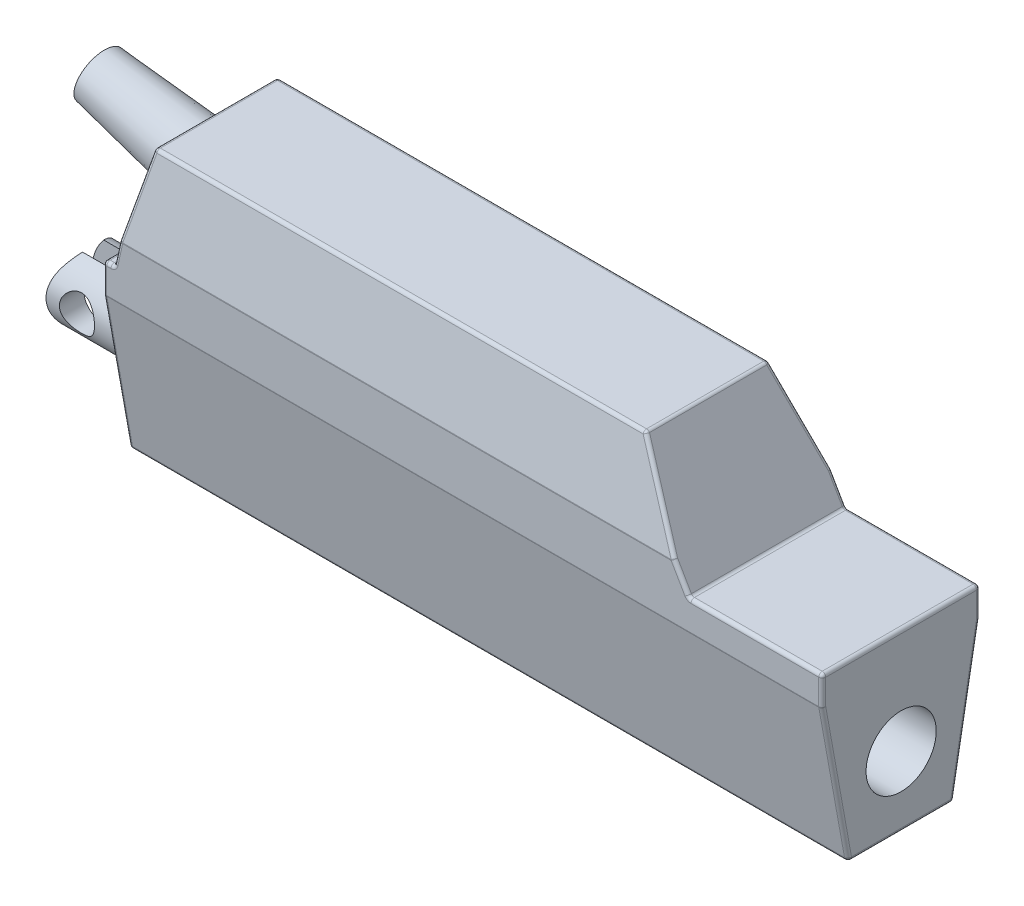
ISO-10303-21;
HEADER;
FILE_DESCRIPTION(('STEP AP214'),'2;1');
FILE_NAME('part.step','',(''),(''),'','','');
FILE_SCHEMA(('AUTOMOTIVE_DESIGN { 1 0 10303 214 1 1 1 1 }'));
ENDSEC;
DATA;
#1=APPLICATION_CONTEXT('core data for automotive mechanical design processes');
#2=APPLICATION_PROTOCOL_DEFINITION('international standard','automotive_design',2000,#1);
#3=PRODUCT_CONTEXT('',#1,'mechanical');
#4=PRODUCT('Part','Part','',(#3));
#5=PRODUCT_RELATED_PRODUCT_CATEGORY('part','',(#4));
#6=PRODUCT_DEFINITION_FORMATION('','',#4);
#7=PRODUCT_DEFINITION_CONTEXT('part definition',#1,'design');
#8=PRODUCT_DEFINITION('design','',#6,#7);
#9=PRODUCT_DEFINITION_SHAPE('','',#8);
#10=(LENGTH_UNIT() NAMED_UNIT(*) SI_UNIT(.MILLI.,.METRE.));
#11=(NAMED_UNIT(*) PLANE_ANGLE_UNIT() SI_UNIT($,.RADIAN.));
#12=(NAMED_UNIT(*) SI_UNIT($,.STERADIAN.) SOLID_ANGLE_UNIT());
#13=UNCERTAINTY_MEASURE_WITH_UNIT(LENGTH_MEASURE(1.E-05),#10,'distance_accuracy_value','');
#14=(GEOMETRIC_REPRESENTATION_CONTEXT(3) GLOBAL_UNCERTAINTY_ASSIGNED_CONTEXT((#13)) GLOBAL_UNIT_ASSIGNED_CONTEXT((#10,
#11,#12)) REPRESENTATION_CONTEXT('',''));
#15=CARTESIAN_POINT('',(0.,0.,0.));
#16=DIRECTION('',(0.,0.,1.));
#17=DIRECTION('',(1.,0.,0.));
#18=AXIS2_PLACEMENT_3D('',#15,#16,#17);
#19=CARTESIAN_POINT('',(0.,50.,22.5));
#20=DIRECTION('',(0.,0.,-1.));
#21=DIRECTION('',(-1.,0.,0.));
#22=AXIS2_PLACEMENT_3D('',#19,#20,#21);
#23=PLANE('',#22);
#24=CARTESIAN_POINT('',(2.19816307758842,51.,22.5));
#25=DIRECTION('',(0.,0.,-1.));
#26=DIRECTION('',(-1.,0.,0.));
#27=AXIS2_PLACEMENT_3D('',#24,#25,#26);
#28=CIRCLE('',#27,2.);
#29=CARTESIAN_POINT('',(2.19816307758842,49.,22.5));
#30=VERTEX_POINT('',#29);
#31=CARTESIAN_POINT('',(4.15036030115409,50.5653438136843,22.5));
#32=VERTEX_POINT('',#31);
#33=EDGE_CURVE('E368',#30,#32,#28,.F.);
#34=ORIENTED_EDGE('',*,*,#33,.F.);
#35=DIRECTION('',(-1.,0.,0.));
#36=VECTOR('',#35,1.);
#37=CARTESIAN_POINT('',(0.,49.,22.5));
#38=LINE('',#37,#36);
#39=CARTESIAN_POINT('',(1.,49.,22.5));
#40=VERTEX_POINT('',#39);
#41=EDGE_CURVE('E365',#30,#40,#38,.T.);
#42=ORIENTED_EDGE('',*,*,#41,.T.);
#43=DIRECTION('',(0.,-1.,0.));
#44=VECTOR('',#43,1.);
#45=CARTESIAN_POINT('',(1.,50.,22.5));
#46=LINE('',#45,#44);
#47=CARTESIAN_POINT('',(1.,41.7559492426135,22.5));
#48=VERTEX_POINT('',#47);
#49=EDGE_CURVE('E363',#40,#48,#46,.T.);
#50=ORIENTED_EDGE('',*,*,#49,.T.);
#51=DIRECTION('',(-1.,0.,0.));
#52=VECTOR('',#51,1.);
#53=CARTESIAN_POINT('',(205.,41.7559492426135,22.5));
#54=LINE('',#53,#52);
#55=CARTESIAN_POINT('',(204.,41.7559492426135,22.5));
#56=VERTEX_POINT('',#55);
#57=EDGE_CURVE('E357',#48,#56,#54,.F.);
#58=ORIENTED_EDGE('',*,*,#57,.T.);
#59=DIRECTION('',(0.,1.,0.));
#60=VECTOR('',#59,1.);
#61=CARTESIAN_POINT('',(204.,50.,22.5));
#62=LINE('',#61,#60);
#63=CARTESIAN_POINT('',(204.,49.,22.5));
#64=VERTEX_POINT('',#63);
#65=EDGE_CURVE('E355',#56,#64,#62,.T.);
#66=ORIENTED_EDGE('',*,*,#65,.T.);
#67=DIRECTION('',(-1.,0.,0.));
#68=VECTOR('',#67,1.);
#69=CARTESIAN_POINT('',(0.,49.,22.5));
#70=LINE('',#69,#68);
#71=CARTESIAN_POINT('',(167.57735026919,49.,22.5));
#72=VERTEX_POINT('',#71);
#73=EDGE_CURVE('E353',#64,#72,#70,.T.);
#74=ORIENTED_EDGE('',*,*,#73,.T.);
#75=CARTESIAN_POINT('',(167.57735026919,51.,22.5));
#76=DIRECTION('',(0.,0.,-1.));
#77=DIRECTION('',(-1.,0.,0.));
#78=AXIS2_PLACEMENT_3D('',#75,#76,#77);
#79=CIRCLE('',#78,2.);
#80=CARTESIAN_POINT('',(165.845299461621,50.,22.5));
#81=VERTEX_POINT('',#80);
#82=EDGE_CURVE('E350',#81,#72,#79,.F.);
#83=ORIENTED_EDGE('',*,*,#82,.F.);
#84=DIRECTION('',(-0.499999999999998,0.86602540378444,0.));
#85=VECTOR('',#84,1.);
#86=CARTESIAN_POINT('',(124.383974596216,121.813121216,22.5));
#87=LINE('',#86,#85);
#88=CARTESIAN_POINT('',(161.91008810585,56.8159860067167,22.5));
#89=VERTEX_POINT('',#88);
#90=EDGE_CURVE('E348',#81,#89,#87,.T.);
#91=ORIENTED_EDGE('',*,*,#90,.T.);
#92=DIRECTION('',(1.,0.,0.));
#93=VECTOR('',#92,1.);
#94=CARTESIAN_POINT('',(4.54142121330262,56.8159860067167,22.5));
#95=LINE('',#94,#93);
#96=CARTESIAN_POINT('',(5.54206410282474,56.8159860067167,22.5));
#97=VERTEX_POINT('',#96);
#98=EDGE_CURVE('E359',#89,#97,#95,.F.);
#99=ORIENTED_EDGE('',*,*,#98,.T.);
#100=DIRECTION('',(-0.217328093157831,-0.976098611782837,0.));
#101=VECTOR('',#100,1.);
#102=CARTESIAN_POINT('',(3.83440411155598,49.1462709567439,22.5));
#103=LINE('',#102,#101);
#104=EDGE_CURVE('E361',#97,#32,#103,.T.);
#105=ORIENTED_EDGE('',*,*,#104,.T.);
#106=EDGE_LOOP('',(#34,#42,#50,#58,#66,#74,#83,#91,#99,#105));
#107=FACE_BOUND('',#106,.T.);
#108=ADVANCED_FACE('F35',(#107),#23,.F.);
#109=CARTESIAN_POINT('',(3.,50.,22.5));
#110=DIRECTION('',(0.976098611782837,-0.217328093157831,0.));
#111=DIRECTION('',(0.217328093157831,0.976098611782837,0.));
#112=AXIS2_PLACEMENT_3D('',#109,#110,#111);
#113=PLANE('',#112);
#114=DIRECTION('',(-0.217328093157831,-0.976098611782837,0.));
#115=VECTOR('',#114,1.);
#116=CARTESIAN_POINT('',(3.,50.,21.5));
#117=LINE('',#116,#115);
#118=CARTESIAN_POINT('',(3.17426168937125,50.7826719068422,21.5));
#119=VERTEX_POINT('',#118);
#120=CARTESIAN_POINT('',(4.5659654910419,57.0333140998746,21.5));
#121=VERTEX_POINT('',#120);
#122=EDGE_CURVE('E439',#119,#121,#117,.F.);
#123=ORIENTED_EDGE('',*,*,#122,.T.);
#124=DIRECTION('',(-0.212625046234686,-0.95497553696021,0.206911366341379));
#125=VECTOR('',#124,1.);
#126=CARTESIAN_POINT('',(9.63654818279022,79.8071242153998,16.5656744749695));
#127=LINE('',#126,#125);
#128=CARTESIAN_POINT('',(9.50523023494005,79.2173280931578,16.6934636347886));
#129=VERTEX_POINT('',#128);
#130=EDGE_CURVE('E444',#121,#129,#127,.F.);
#131=ORIENTED_EDGE('',*,*,#130,.T.);
#132=DIRECTION('',(0.,0.,-1.));
#133=VECTOR('',#132,1.);
#134=CARTESIAN_POINT('',(9.50523023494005,79.2173280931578,22.5));
#135=LINE('',#134,#133);
#136=CARTESIAN_POINT('',(9.50523023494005,79.2173280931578,-16.6934636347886));
#137=VERTEX_POINT('',#136);
#138=EDGE_CURVE('E441',#129,#137,#135,.T.);
#139=ORIENTED_EDGE('',*,*,#138,.T.);
#140=DIRECTION('',(0.212625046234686,0.95497553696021,0.206911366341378));
#141=VECTOR('',#140,1.);
#142=CARTESIAN_POINT('',(4.49847747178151,56.7302011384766,-21.5656744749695));
#143=LINE('',#142,#141);
#144=CARTESIAN_POINT('',(4.56596549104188,57.0333140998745,-21.5));
#145=VERTEX_POINT('',#144);
#146=EDGE_CURVE('E433',#137,#145,#143,.F.);
#147=ORIENTED_EDGE('',*,*,#146,.T.);
#148=DIRECTION('',(-0.217328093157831,-0.976098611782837,0.));
#149=VECTOR('',#148,1.);
#150=CARTESIAN_POINT('',(3.,50.,-21.5));
#151=LINE('',#150,#149);
#152=CARTESIAN_POINT('',(3.17426168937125,50.7826719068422,-21.5));
#153=VERTEX_POINT('',#152);
#154=EDGE_CURVE('E435',#145,#153,#151,.T.);
#155=ORIENTED_EDGE('',*,*,#154,.T.);
#156=DIRECTION('',(0.,0.,-1.));
#157=VECTOR('',#156,1.);
#158=CARTESIAN_POINT('',(3.17426168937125,50.7826719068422,22.5));
#159=LINE('',#158,#157);
#160=EDGE_CURVE('E437',#153,#119,#159,.F.);
#161=ORIENTED_EDGE('',*,*,#160,.T.);
#162=EDGE_LOOP('',(#123,#131,#139,#147,#155,#161));
#163=FACE_BOUND('',#162,.T.);
#164=CARTESIAN_POINT('',(6.55288308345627,65.9572754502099,0.));
#165=DIRECTION('',(0.976098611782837,-0.217328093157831,0.));
#166=DIRECTION('',(0.217328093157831,0.976098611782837,0.));
#167=AXIS2_PLACEMENT_3D('',#164,#165,#166);
#168=CIRCLE('',#167,9.16773117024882);
#169=CARTESIAN_POINT('',(8.54528861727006,74.905885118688,0.));
#170=VERTEX_POINT('',#169);
#171=EDGE_CURVE('E330',#170,#170,#168,.F.);
#172=ORIENTED_EDGE('',*,*,#171,.F.);
#173=EDGE_LOOP('',(#172));
#174=FACE_BOUND('',#173,.T.);
#175=ADVANCED_FACE('F786',(#163,#174),#113,.F.);
#176=CARTESIAN_POINT('',(-25.,20.,0.));
#177=DIRECTION('',(1.,0.,0.));
#178=DIRECTION('',(0.,0.,-1.));
#179=AXIS2_PLACEMENT_3D('',#176,#177,#178);
#180=CYLINDRICAL_SURFACE('',#179,10.);
#181=CARTESIAN_POINT('',(-15.,20.,-10.));
#182=CARTESIAN_POINT('',(-15.000000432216,19.8685111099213,-9.99999960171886));
#183=CARTESIAN_POINT('',(-15.0051927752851,19.7370130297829,-9.99740053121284));
#184=CARTESIAN_POINT('',(-15.025902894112,19.474985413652,-9.98706977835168));
#185=CARTESIAN_POINT('',(-15.041425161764,19.3444563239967,-9.97933586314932));
#186=CARTESIAN_POINT('',(-15.0826407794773,19.0852167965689,-9.95892066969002));
#187=CARTESIAN_POINT('',(-15.1083486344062,18.9565092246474,-9.94623233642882));
#188=CARTESIAN_POINT('',(-15.1696506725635,18.7019736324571,-9.91622716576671));
#189=CARTESIAN_POINT('',(-15.2052488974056,18.5761468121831,-9.89890843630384));
#190=CARTESIAN_POINT('',(-15.2857784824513,18.3287861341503,-9.86015430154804));
#191=CARTESIAN_POINT('',(-15.3306686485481,18.2072360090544,-9.83873709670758));
#192=CARTESIAN_POINT('',(-15.429448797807,17.9685555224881,-9.79224427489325));
#193=CARTESIAN_POINT('',(-15.4833421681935,17.8514268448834,-9.7671672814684));
#194=CARTESIAN_POINT('',(-15.657799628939,17.5077743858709,-9.68730860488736));
#195=CARTESIAN_POINT('',(-15.7912307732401,17.288711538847,-9.62785460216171));
#196=CARTESIAN_POINT('',(-16.0976052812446,16.8624195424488,-9.49780663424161));
#197=CARTESIAN_POINT('',(-16.2724506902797,16.6567080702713,-9.42675632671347));
#198=CARTESIAN_POINT('',(-16.6525890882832,16.2761186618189,-9.28300214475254));
#199=CARTESIAN_POINT('',(-16.8579050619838,16.1012642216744,-9.21029705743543));
#200=CARTESIAN_POINT('',(-17.3124751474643,15.7737161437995,-9.06493867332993));
#201=CARTESIAN_POINT('',(-17.5639018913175,15.6237926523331,-8.99272664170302));
#202=CARTESIAN_POINT('',(-17.9599180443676,15.4327663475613,-8.89637417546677));
#203=CARTESIAN_POINT('',(-18.0951182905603,15.37472018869,-8.86624279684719));
#204=CARTESIAN_POINT('',(-18.3710012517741,15.2705115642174,-8.81109611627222));
#205=CARTESIAN_POINT('',(-18.5116806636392,15.2243420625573,-8.78607778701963));
#206=CARTESIAN_POINT('',(-18.788992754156,15.1468619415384,-8.74350562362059));
#207=CARTESIAN_POINT('',(-18.9253704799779,15.1148323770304,-8.72559704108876));
#208=CARTESIAN_POINT('',(-19.2009256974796,15.062274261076,-8.69596333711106));
#209=CARTESIAN_POINT('',(-19.3401016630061,15.0417396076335,-8.68423493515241));
#210=CARTESIAN_POINT('',(-19.6200074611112,15.0124760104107,-8.66746161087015));
#211=CARTESIAN_POINT('',(-19.7607363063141,15.0037399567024,-8.66241266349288));
#212=CARTESIAN_POINT('',(-20.0425011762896,14.9981960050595,-8.65921299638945));
#213=CARTESIAN_POINT('',(-20.1835371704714,15.001386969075,-8.6610616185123));
#214=CARTESIAN_POINT('',(-20.447703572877,15.0185419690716,-8.67093727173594));
#215=CARTESIAN_POINT('',(-20.5709526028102,15.0311679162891,-8.67819663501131));
#216=CARTESIAN_POINT('',(-20.8158212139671,15.0654559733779,-8.69773906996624));
#217=CARTESIAN_POINT('',(-20.9374402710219,15.0871209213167,-8.71002371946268));
#218=CARTESIAN_POINT('',(-21.1781978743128,15.1392372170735,-8.7392147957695));
#219=CARTESIAN_POINT('',(-21.29733672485,15.169687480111,-8.75612065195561));
#220=CARTESIAN_POINT('',(-21.5324713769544,15.2390568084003,-8.79403073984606));
#221=CARTESIAN_POINT('',(-21.6484659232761,15.2779792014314,-8.81503658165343));
#222=CARTESIAN_POINT('',(-21.9960068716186,15.408913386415,-8.88436032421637));
#223=CARTESIAN_POINT('',(-22.2216933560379,15.5139121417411,-8.93828791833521));
#224=CARTESIAN_POINT('',(-22.6532101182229,15.7548040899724,-9.05517433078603));
#225=CARTESIAN_POINT('',(-22.8590314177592,15.8907111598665,-9.11813720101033));
#226=CARTESIAN_POINT('',(-23.2725885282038,16.2096557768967,-9.2556545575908));
#227=CARTESIAN_POINT('',(-23.4772580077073,16.3964842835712,-9.33066654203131));
#228=CARTESIAN_POINT('',(-23.8537034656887,16.8022655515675,-9.47739013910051));
#229=CARTESIAN_POINT('',(-24.0254637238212,17.021233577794,-9.54910016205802));
#230=CARTESIAN_POINT('',(-24.2584408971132,17.3756939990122,-9.65034506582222));
#231=CARTESIAN_POINT('',(-24.3333520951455,17.5012899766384,-9.68370380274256));
#232=CARTESIAN_POINT('',(-24.4722082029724,17.7592893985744,-9.74663052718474));
#233=CARTESIAN_POINT('',(-24.5361577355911,17.8916899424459,-9.77620011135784));
#234=CARTESIAN_POINT('',(-24.6523988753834,18.162371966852,-9.83067553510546));
#235=CARTESIAN_POINT('',(-24.7046951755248,18.3006510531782,-9.85558325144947));
#236=CARTESIAN_POINT('',(-24.79702492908,18.5820881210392,-9.89999026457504));
#237=CARTESIAN_POINT('',(-24.8370597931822,18.7252455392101,-9.91949018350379));
#238=CARTESIAN_POINT('',(-24.901533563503,19.0032019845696,-9.95109597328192));
#239=CARTESIAN_POINT('',(-24.9269895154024,19.1377113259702,-9.96368046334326));
#240=CARTESIAN_POINT('',(-24.9668080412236,19.4087516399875,-9.98343035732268));
#241=CARTESIAN_POINT('',(-24.9811715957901,19.5452824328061,-9.99059624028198));
#242=CARTESIAN_POINT('',(-24.9986131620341,19.8191892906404,-9.99930380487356));
#243=CARTESIAN_POINT('',(-25.0016954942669,19.9565650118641,-10.000847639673));
#244=CARTESIAN_POINT('',(-24.9965444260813,20.2310476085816,-9.9982723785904));
#245=CARTESIAN_POINT('',(-24.9883115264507,20.3681544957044,-9.99415353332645));
#246=CARTESIAN_POINT('',(-24.961721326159,20.6303240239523,-9.98090973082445));
#247=CARTESIAN_POINT('',(-24.9442016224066,20.7554937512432,-9.97219922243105));
#248=CARTESIAN_POINT('',(-24.8998255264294,21.0038042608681,-9.95027227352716));
#249=CARTESIAN_POINT('',(-24.8729661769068,21.1269443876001,-9.93705440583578));
#250=CARTESIAN_POINT('',(-24.8101973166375,21.3703230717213,-9.90642450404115));
#251=CARTESIAN_POINT('',(-24.7742905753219,21.4905625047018,-9.88901375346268));
#252=CARTESIAN_POINT('',(-24.6937718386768,21.7274794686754,-9.85039368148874));
#253=CARTESIAN_POINT('',(-24.6491565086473,21.8441556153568,-9.8291829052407));
#254=CARTESIAN_POINT('',(-24.5000521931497,22.1943035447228,-9.75922876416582));
#255=CARTESIAN_POINT('',(-24.3820592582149,22.4211132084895,-9.70504904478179));
#256=CARTESIAN_POINT('',(-24.1144478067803,22.8523456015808,-9.58719375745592));
#257=CARTESIAN_POINT('',(-23.9648158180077,23.0567587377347,-9.52351414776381));
#258=CARTESIAN_POINT('',(-23.6212127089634,23.4588213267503,-9.38541505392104));
#259=CARTESIAN_POINT('',(-23.4243304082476,23.6538353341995,-9.31055499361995));
#260=CARTESIAN_POINT('',(-23.000329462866,24.0093066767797,-9.16310881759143));
#261=CARTESIAN_POINT('',(-22.7731900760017,24.1697401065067,-9.09052430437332));
#262=CARTESIAN_POINT('',(-22.4075094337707,24.3846601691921,-8.98785260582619));
#263=CARTESIAN_POINT('',(-22.2781491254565,24.4532676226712,-8.95395955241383));
#264=CARTESIAN_POINT('',(-22.013105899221,24.5791811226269,-8.89022352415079));
#265=CARTESIAN_POINT('',(-21.8774258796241,24.6364922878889,-8.86037871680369));
#266=CARTESIAN_POINT('',(-21.6007229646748,24.739139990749,-8.80590327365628));
#267=CARTESIAN_POINT('',(-21.45970454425,24.784486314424,-8.78126837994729));
#268=CARTESIAN_POINT('',(-21.1733089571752,24.862650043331,-8.73822819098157));
#269=CARTESIAN_POINT('',(-21.0279324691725,24.8954693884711,-8.7198219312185));
#270=CARTESIAN_POINT('',(-20.7482350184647,24.9455383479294,-8.69151275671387));
#271=CARTESIAN_POINT('',(-20.6141921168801,24.9639799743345,-8.68096327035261));
#272=CARTESIAN_POINT('',(-20.3447147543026,24.9899387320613,-8.66606824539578));
#273=CARTESIAN_POINT('',(-20.2092804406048,24.99745700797,-8.66172205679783));
#274=CARTESIAN_POINT('',(-19.9382430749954,25.0014547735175,-8.65941425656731));
#275=CARTESIAN_POINT('',(-19.8026400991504,24.997938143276,-8.66145040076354));
#276=CARTESIAN_POINT('',(-19.5324144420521,24.9799297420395,-8.67181681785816));
#277=CARTESIAN_POINT('',(-19.3977917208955,24.9654384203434,-8.68014683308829));
#278=CARTESIAN_POINT('',(-19.143439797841,24.9275975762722,-8.70167828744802));
#279=CARTESIAN_POINT('',(-19.0235174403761,24.90522766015,-8.71433770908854));
#280=CARTESIAN_POINT('',(-18.7861388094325,24.851943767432,-8.74411599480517));
#281=CARTESIAN_POINT('',(-18.668683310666,24.8210271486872,-8.76123623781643));
#282=CARTESIAN_POINT('',(-18.3210828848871,24.7159030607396,-8.81854231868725));
#283=CARTESIAN_POINT('',(-18.095543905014,24.6292970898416,-8.8646881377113));
#284=CARTESIAN_POINT('',(-17.6468396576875,24.4190716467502,-8.97142890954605));
#285=CARTESIAN_POINT('',(-17.4248519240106,24.2933563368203,-9.03278633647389));
#286=CARTESIAN_POINT('',(-17.0036358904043,24.0107542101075,-9.1617663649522));
#287=CARTESIAN_POINT('',(-16.8044195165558,23.8538511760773,-9.22939221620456));
#288=CARTESIAN_POINT('',(-16.4092921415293,23.4910274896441,-9.37311444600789));
#289=CARTESIAN_POINT('',(-16.2167239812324,23.281467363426,-9.44924162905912));
#290=CARTESIAN_POINT('',(-15.8686655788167,22.8307287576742,-9.59389514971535));
#291=CARTESIAN_POINT('',(-15.7131953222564,22.5895333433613,-9.66241737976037));
#292=CARTESIAN_POINT('',(-15.5113695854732,22.2075388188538,-9.7541901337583));
#293=CARTESIAN_POINT('',(-15.4491329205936,22.0762551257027,-9.78304209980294));
#294=CARTESIAN_POINT('',(-15.3360638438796,21.80799529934,-9.83614745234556));
#295=CARTESIAN_POINT('',(-15.2852258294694,21.6710220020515,-9.8604030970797));
#296=CARTESIAN_POINT('',(-15.1956545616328,21.3926950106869,-9.90354484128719));
#297=CARTESIAN_POINT('',(-15.1568949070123,21.2513516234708,-9.92244264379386));
#298=CARTESIAN_POINT('',(-15.0918624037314,20.9652372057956,-9.95434618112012));
#299=CARTESIAN_POINT('',(-15.065581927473,20.8204683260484,-9.96735551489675));
#300=CARTESIAN_POINT('',(-15.0305254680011,20.5630416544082,-9.98476387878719));
#301=CARTESIAN_POINT('',(-15.019088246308,20.45082580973,-9.99046741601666));
#302=CARTESIAN_POINT('',(-15.0038252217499,20.2257422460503,-9.99808569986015));
#303=CARTESIAN_POINT('',(-14.9999996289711,20.1128745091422,-10.000000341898));
#304=CARTESIAN_POINT('',(-15.,20.,-10.));
#305=B_SPLINE_CURVE_WITH_KNOTS('',3,(#181,#182,#183,#184,#185,#186,#187,#188,#189,#190,#191,
#192,#193,#194,#195,#196,#197,#198,#199,#200,#201,#202,#203,#204,#205,#206,#207,#208,#209,#210,
#211,#212,#213,#214,#215,#216,#217,#218,#219,#220,#221,#222,#223,#224,#225,#226,#227,#228,#229,
#230,#231,#232,#233,#234,#235,#236,#237,#238,#239,#240,#241,#242,#243,#244,#245,#246,#247,#248,
#249,#250,#251,#252,#253,#254,#255,#256,#257,#258,#259,#260,#261,#262,#263,#264,#265,#266,#267,
#268,#269,#270,#271,#272,#273,#274,#275,#276,#277,#278,#279,#280,#281,#282,#283,#284,#285,#286,
#287,#288,#289,#290,#291,#292,#293,#294,#295,#296,#297,#298,#299,#300,#301,#302,#303,#304),
.UNSPECIFIED.,.T.,.F.,(4,2,2,2,2,2,2,2,2,2,2,2,2,2,2,2,2,2,2,2,2,2,2,2,2,2,2,2,2,2,2,2,2,2,2,2,
2,2,2,2,2,2,2,2,2,2,2,2,2,2,2,2,2,2,2,2,2,2,2,2,2,4),(0.,0.39435529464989,0.788882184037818,
1.18397293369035,1.57922537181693,1.97276168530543,2.36644639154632,3.15295441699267,
3.98704440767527,4.821766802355,5.72122193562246,6.17125359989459,6.62101803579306,
7.04410338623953,7.46696393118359,7.88956954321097,8.31213483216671,8.68401534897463,
9.05601271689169,9.42796417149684,9.8000619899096,10.56083380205,11.3219478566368,
12.1795688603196,13.03759852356,13.4870830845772,13.9363776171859,14.3854908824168,
14.8345524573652,15.2464230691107,15.6582572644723,16.0699337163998,16.4815919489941,
16.8612200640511,17.240968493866,17.6206008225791,18.0003788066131,18.7808755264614,
19.5617052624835,20.4192132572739,21.2773121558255,21.7277011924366,22.1778856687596,
22.6277007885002,23.0774462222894,23.4840267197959,23.8905646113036,24.2969595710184,
24.703337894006,25.0708552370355,25.4384863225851,26.1732662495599,26.9574126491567,
27.7419678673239,28.6218519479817,29.5022089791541,29.9460734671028,30.3897193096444,
30.8323885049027,31.2747867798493,31.6133053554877,31.9518332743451),.UNSPECIFIED.);
#306=CARTESIAN_POINT('',(-15.,20.,-10.));
#307=VERTEX_POINT('',#306);
#308=EDGE_CURVE('E752',#307,#307,#305,.T.);
#309=ORIENTED_EDGE('',*,*,#308,.F.);
#310=EDGE_LOOP('',(#309));
#311=FACE_BOUND('',#310,.T.);
#312=DIRECTION('',(1.,0.,0.));
#313=VECTOR('',#312,1.);
#314=CARTESIAN_POINT('',(-170.,10.4606079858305,-3.00000000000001));
#315=LINE('',#314,#313);
#316=CARTESIAN_POINT('',(-25.3954970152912,10.4606079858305,-3.00000000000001));
#317=VERTEX_POINT('',#316);
#318=CARTESIAN_POINT('',(0.,10.4606079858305,-3.00000000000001));
#319=VERTEX_POINT('',#318);
#320=EDGE_CURVE('E309',#317,#319,#315,.T.);
#321=ORIENTED_EDGE('',*,*,#320,.F.);
#322=CARTESIAN_POINT('',(-25.,10.,0.));
#323=CARTESIAN_POINT('',(-25.0000051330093,10.0000029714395,0.24378334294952));
#324=CARTESIAN_POINT('',(-25.0080130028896,10.0089364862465,0.487663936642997));
#325=CARTESIAN_POINT('',(-25.0396584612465,10.0444900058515,0.973228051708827));
#326=CARTESIAN_POINT('',(-25.0633080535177,10.0711235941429,1.21490974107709));
#327=CARTESIAN_POINT('',(-25.1251727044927,10.1416239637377,1.69449589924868));
#328=CARTESIAN_POINT('',(-25.1634259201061,10.1855358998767,1.93238875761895));
#329=CARTESIAN_POINT('',(-25.2528189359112,10.2898205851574,2.40215800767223));
#330=CARTESIAN_POINT('',(-25.3039657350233,10.350202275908,2.63403105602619));
#331=CARTESIAN_POINT('',(-25.4165444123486,10.4858035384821,3.087973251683));
#332=CARTESIAN_POINT('',(-25.4778611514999,10.5608585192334,3.31012042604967));
#333=CARTESIAN_POINT('',(-25.6091186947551,10.7253161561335,3.74627679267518));
#334=CARTESIAN_POINT('',(-25.6790581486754,10.8147165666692,3.96028725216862));
#335=CARTESIAN_POINT('',(-25.8988639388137,11.1033117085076,4.58929345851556));
#336=CARTESIAN_POINT('',(-26.058815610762,11.3230130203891,4.99163494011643));
#337=CARTESIAN_POINT('',(-26.3209925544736,11.7086767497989,5.59671088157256));
#338=CARTESIAN_POINT('',(-26.4191212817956,11.8582389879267,5.81207917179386));
#339=CARTESIAN_POINT('',(-26.6172374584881,12.1733410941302,6.22991257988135));
#340=CARTESIAN_POINT('',(-26.7172245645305,12.3388780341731,6.43238005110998));
#341=CARTESIAN_POINT('',(-26.9169550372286,12.6855656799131,6.82404156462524));
#342=CARTESIAN_POINT('',(-27.0166980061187,12.8667336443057,7.01322050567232));
#343=CARTESIAN_POINT('',(-27.213781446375,13.2440528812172,7.37739272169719));
#344=CARTESIAN_POINT('',(-27.3111217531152,13.4402051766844,7.5523850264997));
#345=CARTESIAN_POINT('',(-27.515220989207,13.8764648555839,7.91159230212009));
#346=CARTESIAN_POINT('',(-27.6213020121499,14.1188236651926,8.09347191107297));
#347=CARTESIAN_POINT('',(-27.8248613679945,14.6215371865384,8.4359118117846));
#348=CARTESIAN_POINT('',(-27.9223407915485,14.8818896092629,8.59647480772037));
#349=CARTESIAN_POINT('',(-28.10588802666,15.4191481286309,8.89438369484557));
#350=CARTESIAN_POINT('',(-28.1919640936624,15.6960420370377,9.03174640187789));
#351=CARTESIAN_POINT('',(-28.3501393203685,16.2647338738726,9.28138757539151));
#352=CARTESIAN_POINT('',(-28.4222414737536,16.5565285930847,9.39367141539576));
#353=CARTESIAN_POINT('',(-28.5429101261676,17.1191710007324,9.58011207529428));
#354=CARTESIAN_POINT('',(-28.5932090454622,17.3886992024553,9.65713217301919));
#355=CARTESIAN_POINT('',(-28.6794805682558,17.9354673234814,9.78860209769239));
#356=CARTESIAN_POINT('',(-28.7154541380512,18.2127067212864,9.84305344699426));
#357=CARTESIAN_POINT('',(-28.7719539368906,18.7720566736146,9.92834883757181));
#358=CARTESIAN_POINT('',(-28.7924963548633,19.0541618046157,9.95921762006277));
#359=CARTESIAN_POINT('',(-28.8175417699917,19.6206708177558,9.99683237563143));
#360=CARTESIAN_POINT('',(-28.8220470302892,19.905074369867,10.0035817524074));
#361=CARTESIAN_POINT('',(-28.8154339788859,20.4298900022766,9.99365946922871));
#362=CARTESIAN_POINT('',(-28.8065907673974,20.6704047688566,9.98039847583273));
#363=CARTESIAN_POINT('',(-28.7774978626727,21.1491680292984,9.93665840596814));
#364=CARTESIAN_POINT('',(-28.7572484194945,21.3874165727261,9.90617970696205));
#365=CARTESIAN_POINT('',(-28.7057985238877,21.8599399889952,9.82842632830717));
#366=CARTESIAN_POINT('',(-28.6745981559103,22.094214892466,9.78115177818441));
#367=CARTESIAN_POINT('',(-28.6019219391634,22.5572777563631,9.6704192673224));
#368=CARTESIAN_POINT('',(-28.560445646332,22.7860654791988,9.60696060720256));
#369=CARTESIAN_POINT('',(-28.4682674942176,23.2358598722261,9.46491439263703));
#370=CARTESIAN_POINT('',(-28.4176055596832,23.4568954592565,9.38639222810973));
#371=CARTESIAN_POINT('',(-28.3078926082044,23.8911827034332,9.21483749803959));
#372=CARTESIAN_POINT('',(-28.2488388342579,24.1044317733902,9.12180016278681));
#373=CARTESIAN_POINT('',(-28.1234308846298,24.5221326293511,8.92210148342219));
#374=CARTESIAN_POINT('',(-28.0570786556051,24.726586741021,8.81544377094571));
#375=CARTESIAN_POINT('',(-27.9181547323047,25.1261299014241,8.58926751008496));
#376=CARTESIAN_POINT('',(-27.845580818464,25.3212155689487,8.46974436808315));
#377=CARTESIAN_POINT('',(-27.6855373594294,25.726332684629,8.20216520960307));
#378=CARTESIAN_POINT('',(-27.5973621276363,25.9349724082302,8.05242265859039));
#379=CARTESIAN_POINT('',(-27.4162298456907,26.3389530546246,7.73842132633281));
#380=CARTESIAN_POINT('',(-27.3232706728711,26.5342879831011,7.57415607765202));
#381=CARTESIAN_POINT('',(-27.1342364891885,26.9113376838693,7.23175998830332));
#382=CARTESIAN_POINT('',(-27.0381573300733,27.0930331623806,7.05361020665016));
#383=CARTESIAN_POINT('',(-26.8448864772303,27.4419925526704,6.68440374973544));
#384=CARTESIAN_POINT('',(-26.7476951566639,27.6092611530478,6.49335130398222));
#385=CARTESIAN_POINT('',(-26.5390560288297,27.9538401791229,6.06815481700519));
#386=CARTESIAN_POINT('',(-26.4277401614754,28.1286708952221,5.83192841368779));
#387=CARTESIAN_POINT('',(-26.209407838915,28.4577273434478,5.34355338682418));
#388=CARTESIAN_POINT('',(-26.1023923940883,28.6119482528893,5.09140105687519));
#389=CARTESIAN_POINT('',(-25.8964318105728,28.8984648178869,4.5722128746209));
#390=CARTESIAN_POINT('',(-25.7974769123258,29.0307871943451,4.3051957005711));
#391=CARTESIAN_POINT('',(-25.6114808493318,29.2723363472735,3.75679342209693));
#392=CARTESIAN_POINT('',(-25.5244403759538,29.381561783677,3.47540748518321));
#393=CARTESIAN_POINT('',(-25.3887206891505,29.5480327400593,2.98041642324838));
#394=CARTESIAN_POINT('',(-25.3361234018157,29.6112701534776,2.76988559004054));
#395=CARTESIAN_POINT('',(-25.2409929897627,29.7241250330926,2.34308742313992));
#396=CARTESIAN_POINT('',(-25.1984532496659,29.7737514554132,2.1268239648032));
#397=CARTESIAN_POINT('',(-25.1249917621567,29.8586320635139,1.69017979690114));
#398=CARTESIAN_POINT('',(-25.094038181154,29.8939256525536,1.46981214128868));
#399=CARTESIAN_POINT('',(-25.0448055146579,29.9497495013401,1.02589546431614));
#400=CARTESIAN_POINT('',(-25.0265185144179,29.9702889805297,0.802348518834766));
#401=CARTESIAN_POINT('',(-25.0099685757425,29.9888456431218,0.481929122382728));
#402=CARTESIAN_POINT('',(-25.006234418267,29.9930261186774,0.385642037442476));
#403=CARTESIAN_POINT('',(-25.0012489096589,29.9986041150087,0.192908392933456));
#404=CARTESIAN_POINT('',(-24.9999979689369,30.0000011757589,0.0964618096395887));
#405=CARTESIAN_POINT('',(-25.0000051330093,29.9999970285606,-0.243783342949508));
#406=CARTESIAN_POINT('',(-25.0080130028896,29.9910635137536,-0.487663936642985));
#407=CARTESIAN_POINT('',(-25.0396584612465,29.9555099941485,-0.973228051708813));
#408=CARTESIAN_POINT('',(-25.0633080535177,29.9288764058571,-1.21490974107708));
#409=CARTESIAN_POINT('',(-25.1251727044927,29.8583760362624,-1.69449589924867));
#410=CARTESIAN_POINT('',(-25.1634259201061,29.8144641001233,-1.93238875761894));
#411=CARTESIAN_POINT('',(-25.2528189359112,29.7101794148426,-2.40215800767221));
#412=CARTESIAN_POINT('',(-25.3039657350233,29.649797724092,-2.63403105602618));
#413=CARTESIAN_POINT('',(-25.4165444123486,29.5141964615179,-3.08797325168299));
#414=CARTESIAN_POINT('',(-25.4778611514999,29.4391414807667,-3.31012042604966));
#415=CARTESIAN_POINT('',(-25.6091186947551,29.2746838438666,-3.74627679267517));
#416=CARTESIAN_POINT('',(-25.6790581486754,29.1852834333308,-3.96028725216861));
#417=CARTESIAN_POINT('',(-25.8988639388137,28.8966882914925,-4.58929345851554));
#418=CARTESIAN_POINT('',(-26.058815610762,28.676986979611,-4.99163494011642));
#419=CARTESIAN_POINT('',(-26.3209925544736,28.2913232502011,-5.59671088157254));
#420=CARTESIAN_POINT('',(-26.4191212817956,28.1417610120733,-5.81207917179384));
#421=CARTESIAN_POINT('',(-26.6172374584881,27.8266589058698,-6.22991257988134));
#422=CARTESIAN_POINT('',(-26.7172245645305,27.661121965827,-6.43238005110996));
#423=CARTESIAN_POINT('',(-26.9169550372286,27.314434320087,-6.82404156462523));
#424=CARTESIAN_POINT('',(-27.0166980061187,27.1332663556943,-7.0132205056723));
#425=CARTESIAN_POINT('',(-27.213781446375,26.7559471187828,-7.37739272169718));
#426=CARTESIAN_POINT('',(-27.3111217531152,26.5597948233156,-7.55238502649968));
#427=CARTESIAN_POINT('',(-27.515220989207,26.1235351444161,-7.91159230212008));
#428=CARTESIAN_POINT('',(-27.6213020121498,25.8811763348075,-8.09347191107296));
#429=CARTESIAN_POINT('',(-27.8248613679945,25.3784628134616,-8.43591181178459));
#430=CARTESIAN_POINT('',(-27.9223407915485,25.1181103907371,-8.59647480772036));
#431=CARTESIAN_POINT('',(-28.10588802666,24.5808518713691,-8.89438369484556));
#432=CARTESIAN_POINT('',(-28.1919640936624,24.3039579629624,-9.03174640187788));
#433=CARTESIAN_POINT('',(-28.3501393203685,23.7352661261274,-9.2813875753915));
#434=CARTESIAN_POINT('',(-28.4222414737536,23.4434714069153,-9.39367141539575));
#435=CARTESIAN_POINT('',(-28.5429101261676,22.8808289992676,-9.58011207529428));
#436=CARTESIAN_POINT('',(-28.5932090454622,22.6113007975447,-9.65713217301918));
#437=CARTESIAN_POINT('',(-28.6794805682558,22.0645326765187,-9.78860209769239));
#438=CARTESIAN_POINT('',(-28.7154541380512,21.7872932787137,-9.84305344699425));
#439=CARTESIAN_POINT('',(-28.7719539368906,21.2279433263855,-9.9283488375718));
#440=CARTESIAN_POINT('',(-28.7924963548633,20.9458381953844,-9.95921762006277));
#441=CARTESIAN_POINT('',(-28.8175417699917,20.3793291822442,-9.99683237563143));
#442=CARTESIAN_POINT('',(-28.8220470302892,20.0949256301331,-10.0035817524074));
#443=CARTESIAN_POINT('',(-28.8154339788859,19.5701099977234,-9.99365946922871));
#444=CARTESIAN_POINT('',(-28.8065907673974,19.3295952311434,-9.98039847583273));
#445=CARTESIAN_POINT('',(-28.7774978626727,18.8508319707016,-9.93665840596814));
#446=CARTESIAN_POINT('',(-28.7572484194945,18.612583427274,-9.90617970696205));
#447=CARTESIAN_POINT('',(-28.7057985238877,18.1400600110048,-9.82842632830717));
#448=CARTESIAN_POINT('',(-28.6745981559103,17.9057851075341,-9.78115177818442));
#449=CARTESIAN_POINT('',(-28.6019219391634,17.4427222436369,-9.67041926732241));
#450=CARTESIAN_POINT('',(-28.560445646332,17.2139345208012,-9.60696060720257));
#451=CARTESIAN_POINT('',(-28.4682674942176,16.764140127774,-9.46491439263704));
#452=CARTESIAN_POINT('',(-28.4176055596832,16.5431045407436,-9.38639222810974));
#453=CARTESIAN_POINT('',(-28.3078926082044,16.1088172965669,-9.2148374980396));
#454=CARTESIAN_POINT('',(-28.2488388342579,15.8955682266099,-9.12180016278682));
#455=CARTESIAN_POINT('',(-28.1234308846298,15.4778673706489,-8.9221014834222));
#456=CARTESIAN_POINT('',(-28.0570786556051,15.273413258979,-8.81544377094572));
#457=CARTESIAN_POINT('',(-27.9181547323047,14.873870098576,-8.58926751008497));
#458=CARTESIAN_POINT('',(-27.845580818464,14.6787844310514,-8.46974436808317));
#459=CARTESIAN_POINT('',(-27.6855373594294,14.273667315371,-8.20216520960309));
#460=CARTESIAN_POINT('',(-27.5973621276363,14.0650275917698,-8.0524226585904));
#461=CARTESIAN_POINT('',(-27.4162298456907,13.6610469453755,-7.73842132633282));
#462=CARTESIAN_POINT('',(-27.3232706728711,13.4657120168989,-7.57415607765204));
#463=CARTESIAN_POINT('',(-27.1342364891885,13.0886623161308,-7.23175998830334));
#464=CARTESIAN_POINT('',(-27.0381573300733,12.9069668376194,-7.05361020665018));
#465=CARTESIAN_POINT('',(-26.8448864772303,12.5580074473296,-6.68440374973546));
#466=CARTESIAN_POINT('',(-26.7476951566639,12.3907388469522,-6.49335130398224));
#467=CARTESIAN_POINT('',(-26.5390560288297,12.0461598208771,-6.06815481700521));
#468=CARTESIAN_POINT('',(-26.4277401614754,11.871329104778,-5.83192841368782));
#469=CARTESIAN_POINT('',(-26.209407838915,11.5422726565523,-5.34355338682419));
#470=CARTESIAN_POINT('',(-26.1023923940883,11.3880517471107,-5.09140105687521));
#471=CARTESIAN_POINT('',(-25.8964318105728,11.1015351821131,-4.57221287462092));
#472=CARTESIAN_POINT('',(-25.7974769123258,10.9692128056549,-4.30519570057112));
#473=CARTESIAN_POINT('',(-25.6114808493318,10.7276636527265,-3.75679342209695));
#474=CARTESIAN_POINT('',(-25.5244403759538,10.6184382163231,-3.47540748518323));
#475=CARTESIAN_POINT('',(-25.3887206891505,10.4519672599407,-2.9804164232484));
#476=CARTESIAN_POINT('',(-25.3361234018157,10.3887298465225,-2.76988559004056));
#477=CARTESIAN_POINT('',(-25.2409929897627,10.2758749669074,-2.34308742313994));
#478=CARTESIAN_POINT('',(-25.1984532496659,10.2262485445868,-2.12682396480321));
#479=CARTESIAN_POINT('',(-25.1249917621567,10.1413679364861,-1.69017979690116));
#480=CARTESIAN_POINT('',(-25.094038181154,10.1060743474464,-1.46981214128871));
#481=CARTESIAN_POINT('',(-25.0448055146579,10.0502504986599,-1.02589546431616));
#482=CARTESIAN_POINT('',(-25.0265185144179,10.0297110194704,-0.802348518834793));
#483=CARTESIAN_POINT('',(-25.0099685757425,10.0111543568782,-0.481929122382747));
#484=CARTESIAN_POINT('',(-25.006234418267,10.0069738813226,-0.385642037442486));
#485=CARTESIAN_POINT('',(-25.0012489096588,10.0013958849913,-0.192908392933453));
#486=CARTESIAN_POINT('',(-24.9999979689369,9.99999882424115,-0.0964618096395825));
#487=CARTESIAN_POINT('',(-25.,10.,0.));
#488=B_SPLINE_CURVE_WITH_KNOTS('',3,(#322,#323,#324,#325,#326,#327,#328,#329,#330,#331,#332,
#333,#334,#335,#336,#337,#338,#339,#340,#341,#342,#343,#344,#345,#346,#347,#348,#349,#350,#351,
#352,#353,#354,#355,#356,#357,#358,#359,#360,#361,#362,#363,#364,#365,#366,#367,#368,#369,#370,
#371,#372,#373,#374,#375,#376,#377,#378,#379,#380,#381,#382,#383,#384,#385,#386,#387,#388,#389,
#390,#391,#392,#393,#394,#395,#396,#397,#398,#399,#400,#401,#402,#403,#404,#405,#406,#407,#408,
#409,#410,#411,#412,#413,#414,#415,#416,#417,#418,#419,#420,#421,#422,#423,#424,#425,#426,#427,
#428,#429,#430,#431,#432,#433,#434,#435,#436,#437,#438,#439,#440,#441,#442,#443,#444,#445,#446,
#447,#448,#449,#450,#451,#452,#453,#454,#455,#456,#457,#458,#459,#460,#461,#462,#463,#464,#465,
#466,#467,#468,#469,#470,#471,#472,#473,#474,#475,#476,#477,#478,#479,#480,#481,#482,#483,#484,
#485,#486,#487),.UNSPECIFIED.,.T.,.F.,(4,2,2,2,2,2,2,2,2,2,2,2,2,2,2,2,2,2,2,2,2,2,2,2,2,2,2,2,
2,2,2,2,2,2,2,2,2,2,2,2,2,2,2,2,2,2,2,2,2,2,2,2,2,2,2,2,2,2,2,2,2,2,2,2,2,2,2,2,2,2,2,2,2,2,2,2,
2,2,2,2,2,2,4),(0.,0.731229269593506,1.46302035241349,2.19673672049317,2.93085222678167,
3.65716219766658,4.38335858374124,5.83456314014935,6.67388088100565,7.51304507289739,
8.35314796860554,9.19330826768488,10.1551588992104,11.1168873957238,12.0779158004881,
13.0387380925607,13.8918341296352,14.7448726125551,15.5970149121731,16.4490369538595,
17.1712882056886,17.8935236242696,18.6157534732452,19.3380145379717,20.0572084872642,
20.7766392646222,21.4958786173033,22.2153756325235,23.0291616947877,23.843312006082,
24.6585930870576,25.4736082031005,26.4152924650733,27.3571966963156,28.2979429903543,
29.2387438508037,29.9162015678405,30.5932124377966,31.2683492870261,31.9430638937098,
32.2323537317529,32.5216913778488,33.2529206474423,33.9847117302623,34.718428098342,
35.4525436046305,36.1788535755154,36.9050499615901,38.3562545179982,39.1955722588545,
40.0347364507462,40.8748393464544,41.7149996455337,42.6768502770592,43.6385787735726,
44.5996071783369,45.5604294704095,46.413525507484,47.2665639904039,48.1187062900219,
48.9707283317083,49.6929795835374,50.4152150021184,51.137444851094,51.8597059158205,
52.578899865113,53.298330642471,54.0175699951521,54.7370670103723,55.5508530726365,
56.3650033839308,57.1802844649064,57.9952995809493,58.9369838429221,59.8788880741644,
60.8196343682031,61.7604352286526,62.4378929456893,63.1149038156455,63.7900406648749,
64.4647552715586,64.7540451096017,65.0433827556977),.UNSPECIFIED.);
#489=CARTESIAN_POINT('',(-25.3954970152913,29.5393920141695,-3.));
#490=VERTEX_POINT('',#489);
#491=EDGE_CURVE('E321',#490,#317,#488,.T.);
#492=ORIENTED_EDGE('',*,*,#491,.F.);
#493=DIRECTION('',(1.,0.,0.));
#494=VECTOR('',#493,1.);
#495=CARTESIAN_POINT('',(-170.,29.5393920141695,-3.));
#496=LINE('',#495,#494);
#497=CARTESIAN_POINT('',(0.,29.5393920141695,-3.));
#498=VERTEX_POINT('',#497);
#499=EDGE_CURVE('E306',#490,#498,#496,.T.);
#500=ORIENTED_EDGE('',*,*,#499,.T.);
#501=CARTESIAN_POINT('',(0.,20.,0.));
#502=DIRECTION('',(1.,0.,0.));
#503=DIRECTION('',(0.,0.,-1.));
#504=AXIS2_PLACEMENT_3D('',#501,#502,#503);
#505=CIRCLE('',#504,10.);
#506=EDGE_CURVE('E319',#498,#319,#505,.F.);
#507=ORIENTED_EDGE('',*,*,#506,.T.);
#508=EDGE_LOOP('',(#321,#492,#500,#507));
#509=FACE_BOUND('',#508,.T.);
#510=ADVANCED_FACE('F318',(#311,#509),#180,.T.);
#511=CARTESIAN_POINT('',(-25.,20.,10.));
#512=CARTESIAN_POINT('',(-24.999999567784,20.1314888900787,9.99999960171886));
#513=CARTESIAN_POINT('',(-24.9948072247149,20.2629869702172,9.99740053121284));
#514=CARTESIAN_POINT('',(-24.974097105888,20.5250145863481,9.98706977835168));
#515=CARTESIAN_POINT('',(-24.958574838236,20.6555436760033,9.97933586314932));
#516=CARTESIAN_POINT('',(-24.9173592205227,20.9147832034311,9.95892066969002));
#517=CARTESIAN_POINT('',(-24.8916513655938,21.0434907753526,9.94623233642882));
#518=CARTESIAN_POINT('',(-24.8303493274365,21.2980263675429,9.91622716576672));
#519=CARTESIAN_POINT('',(-24.7947511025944,21.4238531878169,9.89890843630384));
#520=CARTESIAN_POINT('',(-24.7142215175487,21.6712138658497,9.86015430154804));
#521=CARTESIAN_POINT('',(-24.669331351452,21.7927639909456,9.83873709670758));
#522=CARTESIAN_POINT('',(-24.5705512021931,22.0314444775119,9.79224427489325));
#523=CARTESIAN_POINT('',(-24.5166578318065,22.1485731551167,9.7671672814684));
#524=CARTESIAN_POINT('',(-24.342200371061,22.4922256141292,9.68730860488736));
#525=CARTESIAN_POINT('',(-24.2087692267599,22.7112884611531,9.62785460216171));
#526=CARTESIAN_POINT('',(-23.9023947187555,23.1375804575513,9.49780663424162));
#527=CARTESIAN_POINT('',(-23.7275493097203,23.3432919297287,9.42675632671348));
#528=CARTESIAN_POINT('',(-23.3474109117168,23.7238813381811,9.28300214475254));
#529=CARTESIAN_POINT('',(-23.1420949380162,23.8987357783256,9.21029705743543));
#530=CARTESIAN_POINT('',(-22.6875248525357,24.2262838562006,9.06493867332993));
#531=CARTESIAN_POINT('',(-22.4360981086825,24.376207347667,8.99272664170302));
#532=CARTESIAN_POINT('',(-22.0400819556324,24.5672336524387,8.89637417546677));
#533=CARTESIAN_POINT('',(-21.9048817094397,24.62527981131,8.86624279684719));
#534=CARTESIAN_POINT('',(-21.6289987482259,24.7294884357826,8.81109611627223));
#535=CARTESIAN_POINT('',(-21.4883193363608,24.7756579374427,8.78607778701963));
#536=CARTESIAN_POINT('',(-21.211007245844,24.8531380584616,8.74350562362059));
#537=CARTESIAN_POINT('',(-21.0746295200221,24.8851676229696,8.72559704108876));
#538=CARTESIAN_POINT('',(-20.7990743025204,24.9377257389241,8.69596333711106));
#539=CARTESIAN_POINT('',(-20.6598983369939,24.9582603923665,8.68423493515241));
#540=CARTESIAN_POINT('',(-20.3799925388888,24.9875239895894,8.66746161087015));
#541=CARTESIAN_POINT('',(-20.2392636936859,24.9962600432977,8.66241266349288));
#542=CARTESIAN_POINT('',(-19.9574988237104,25.0018039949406,8.65921299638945));
#543=CARTESIAN_POINT('',(-19.8164628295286,24.998613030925,8.66106161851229));
#544=CARTESIAN_POINT('',(-19.5522964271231,24.9814580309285,8.67093727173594));
#545=CARTESIAN_POINT('',(-19.4290473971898,24.9688320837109,8.67819663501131));
#546=CARTESIAN_POINT('',(-19.1841787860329,24.9345440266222,8.69773906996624));
#547=CARTESIAN_POINT('',(-19.0625597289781,24.9128790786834,8.71002371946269));
#548=CARTESIAN_POINT('',(-18.8218021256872,24.8607627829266,8.7392147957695));
#549=CARTESIAN_POINT('',(-18.70266327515,24.8303125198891,8.75612065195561));
#550=CARTESIAN_POINT('',(-18.4675286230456,24.7609431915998,8.79403073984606));
#551=CARTESIAN_POINT('',(-18.3515340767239,24.7220207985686,8.81503658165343));
#552=CARTESIAN_POINT('',(-18.0039931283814,24.591086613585,8.88436032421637));
#553=CARTESIAN_POINT('',(-17.7783066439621,24.4860878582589,8.93828791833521));
#554=CARTESIAN_POINT('',(-17.3467898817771,24.2451959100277,9.05517433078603));
#555=CARTESIAN_POINT('',(-17.1409685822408,24.1092888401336,9.11813720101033));
#556=CARTESIAN_POINT('',(-16.7274114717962,23.7903442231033,9.2556545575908));
#557=CARTESIAN_POINT('',(-16.5227419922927,23.6035157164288,9.33066654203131));
#558=CARTESIAN_POINT('',(-16.1462965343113,23.1977344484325,9.47739013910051));
#559=CARTESIAN_POINT('',(-15.9745362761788,22.978766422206,9.54910016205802));
#560=CARTESIAN_POINT('',(-15.7415591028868,22.6243060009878,9.65034506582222));
#561=CARTESIAN_POINT('',(-15.6666479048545,22.4987100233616,9.68370380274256));
#562=CARTESIAN_POINT('',(-15.5277917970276,22.2407106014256,9.74663052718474));
#563=CARTESIAN_POINT('',(-15.4638422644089,22.1083100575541,9.77620011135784));
#564=CARTESIAN_POINT('',(-15.3476011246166,21.8376280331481,9.83067553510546));
#565=CARTESIAN_POINT('',(-15.2953048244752,21.6993489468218,9.85558325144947));
#566=CARTESIAN_POINT('',(-15.20297507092,21.4179118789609,9.89999026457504));
#567=CARTESIAN_POINT('',(-15.1629402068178,21.2747544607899,9.91949018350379));
#568=CARTESIAN_POINT('',(-15.098466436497,20.9967980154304,9.95109597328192));
#569=CARTESIAN_POINT('',(-15.0730104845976,20.8622886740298,9.96368046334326));
#570=CARTESIAN_POINT('',(-15.0331919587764,20.5912483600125,9.98343035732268));
#571=CARTESIAN_POINT('',(-15.0188284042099,20.454717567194,9.99059624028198));
#572=CARTESIAN_POINT('',(-15.0013868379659,20.1808107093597,9.99930380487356));
#573=CARTESIAN_POINT('',(-14.9983045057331,20.0434349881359,10.000847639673));
#574=CARTESIAN_POINT('',(-15.0034555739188,19.7689523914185,9.9982723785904));
#575=CARTESIAN_POINT('',(-15.0116884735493,19.6318455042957,9.99415353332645));
#576=CARTESIAN_POINT('',(-15.038278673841,19.3696759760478,9.98090973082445));
#577=CARTESIAN_POINT('',(-15.0557983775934,19.2445062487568,9.97219922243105));
#578=CARTESIAN_POINT('',(-15.1001744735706,18.996195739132,9.95027227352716));
#579=CARTESIAN_POINT('',(-15.1270338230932,18.8730556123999,9.93705440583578));
#580=CARTESIAN_POINT('',(-15.1898026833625,18.6296769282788,9.90642450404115));
#581=CARTESIAN_POINT('',(-15.2257094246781,18.5094374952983,9.88901375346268));
#582=CARTESIAN_POINT('',(-15.3062281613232,18.2725205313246,9.85039368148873));
#583=CARTESIAN_POINT('',(-15.3508434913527,18.1558443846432,9.8291829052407));
#584=CARTESIAN_POINT('',(-15.4999478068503,17.8056964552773,9.75922876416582));
#585=CARTESIAN_POINT('',(-15.6179407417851,17.5788867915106,9.70504904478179));
#586=CARTESIAN_POINT('',(-15.8855521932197,17.1476543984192,9.58719375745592));
#587=CARTESIAN_POINT('',(-16.0351841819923,16.9432412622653,9.52351414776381));
#588=CARTESIAN_POINT('',(-16.3787872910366,16.5411786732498,9.38541505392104));
#589=CARTESIAN_POINT('',(-16.5756695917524,16.3461646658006,9.31055499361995));
#590=CARTESIAN_POINT('',(-16.999670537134,15.9906933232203,9.16310881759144));
#591=CARTESIAN_POINT('',(-17.2268099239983,15.8302598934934,9.09052430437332));
#592=CARTESIAN_POINT('',(-17.5924905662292,15.6153398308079,8.98785260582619));
#593=CARTESIAN_POINT('',(-17.7218508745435,15.5467323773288,8.95395955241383));
#594=CARTESIAN_POINT('',(-17.986894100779,15.4208188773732,8.89022352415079));
#595=CARTESIAN_POINT('',(-18.1225741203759,15.3635077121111,8.86037871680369));
#596=CARTESIAN_POINT('',(-18.3992770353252,15.260860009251,8.80590327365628));
#597=CARTESIAN_POINT('',(-18.54029545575,15.215513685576,8.78126837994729));
#598=CARTESIAN_POINT('',(-18.8266910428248,15.1373499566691,8.73822819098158));
#599=CARTESIAN_POINT('',(-18.9720675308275,15.1045306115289,8.7198219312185));
#600=CARTESIAN_POINT('',(-19.2517649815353,15.0544616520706,8.69151275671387));
#601=CARTESIAN_POINT('',(-19.3858078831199,15.0360200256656,8.68096327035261));
#602=CARTESIAN_POINT('',(-19.6552852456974,15.0100612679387,8.66606824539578));
#603=CARTESIAN_POINT('',(-19.7907195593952,15.00254299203,8.66172205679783));
#604=CARTESIAN_POINT('',(-20.0617569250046,14.9985452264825,8.65941425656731));
#605=CARTESIAN_POINT('',(-20.1973599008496,15.002061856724,8.66145040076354));
#606=CARTESIAN_POINT('',(-20.4675855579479,15.0200702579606,8.67181681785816));
#607=CARTESIAN_POINT('',(-20.6022082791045,15.0345615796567,8.68014683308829));
#608=CARTESIAN_POINT('',(-20.856560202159,15.0724024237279,8.70167828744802));
#609=CARTESIAN_POINT('',(-20.9764825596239,15.09477233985,8.71433770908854));
#610=CARTESIAN_POINT('',(-21.2138611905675,15.1480562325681,8.74411599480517));
#611=CARTESIAN_POINT('',(-21.331316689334,15.1789728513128,8.76123623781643));
#612=CARTESIAN_POINT('',(-21.6789171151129,15.2840969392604,8.81854231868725));
#613=CARTESIAN_POINT('',(-21.904456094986,15.3707029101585,8.8646881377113));
#614=CARTESIAN_POINT('',(-22.3531603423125,15.5809283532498,8.97142890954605));
#615=CARTESIAN_POINT('',(-22.5751480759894,15.7066436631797,9.03278633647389));
#616=CARTESIAN_POINT('',(-22.9963641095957,15.9892457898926,9.1617663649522));
#617=CARTESIAN_POINT('',(-23.1955804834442,16.1461488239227,9.22939221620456));
#618=CARTESIAN_POINT('',(-23.5907078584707,16.508972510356,9.37311444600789));
#619=CARTESIAN_POINT('',(-23.7832760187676,16.718532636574,9.44924162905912));
#620=CARTESIAN_POINT('',(-24.1313344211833,17.1692712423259,9.59389514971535));
#621=CARTESIAN_POINT('',(-24.2868046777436,17.4104666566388,9.66241737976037));
#622=CARTESIAN_POINT('',(-24.4886304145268,17.7924611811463,9.75419013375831));
#623=CARTESIAN_POINT('',(-24.5508670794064,17.9237448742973,9.78304209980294));
#624=CARTESIAN_POINT('',(-24.6639361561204,18.19200470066,9.83614745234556));
#625=CARTESIAN_POINT('',(-24.7147741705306,18.3289779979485,9.8604030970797));
#626=CARTESIAN_POINT('',(-24.8043454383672,18.6073049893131,9.90354484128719));
#627=CARTESIAN_POINT('',(-24.8431050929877,18.7486483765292,9.92244264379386));
#628=CARTESIAN_POINT('',(-24.9081375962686,19.0347627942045,9.95434618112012));
#629=CARTESIAN_POINT('',(-24.934418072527,19.1795316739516,9.96735551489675));
#630=CARTESIAN_POINT('',(-24.9694745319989,19.4369583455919,9.98476387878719));
#631=CARTESIAN_POINT('',(-24.980911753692,19.54917419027,9.99046741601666));
#632=CARTESIAN_POINT('',(-24.9961747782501,19.7742577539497,9.99808569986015));
#633=CARTESIAN_POINT('',(-25.0000003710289,19.8871254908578,10.000000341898));
#634=CARTESIAN_POINT('',(-25.,20.,10.));
#635=B_SPLINE_CURVE_WITH_KNOTS('',3,(#511,#512,#513,#514,#515,#516,#517,#518,#519,#520,#521,
#522,#523,#524,#525,#526,#527,#528,#529,#530,#531,#532,#533,#534,#535,#536,#537,#538,#539,#540,
#541,#542,#543,#544,#545,#546,#547,#548,#549,#550,#551,#552,#553,#554,#555,#556,#557,#558,#559,
#560,#561,#562,#563,#564,#565,#566,#567,#568,#569,#570,#571,#572,#573,#574,#575,#576,#577,#578,
#579,#580,#581,#582,#583,#584,#585,#586,#587,#588,#589,#590,#591,#592,#593,#594,#595,#596,#597,
#598,#599,#600,#601,#602,#603,#604,#605,#606,#607,#608,#609,#610,#611,#612,#613,#614,#615,#616,
#617,#618,#619,#620,#621,#622,#623,#624,#625,#626,#627,#628,#629,#630,#631,#632,#633,#634),
.UNSPECIFIED.,.T.,.F.,(4,2,2,2,2,2,2,2,2,2,2,2,2,2,2,2,2,2,2,2,2,2,2,2,2,2,2,2,2,2,2,2,2,2,2,2,
2,2,2,2,2,2,2,2,2,2,2,2,2,2,2,2,2,2,2,2,2,2,2,2,2,4),(0.,0.39435529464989,0.788882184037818,
1.18397293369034,1.57922537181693,1.97276168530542,2.36644639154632,3.15295441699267,
3.98704440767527,4.821766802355,5.72122193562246,6.17125359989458,6.62101803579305,
7.04410338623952,7.46696393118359,7.88956954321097,8.3121348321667,8.68401534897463,
9.05601271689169,9.42796417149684,9.8000619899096,10.56083380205,11.3219478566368,
12.1795688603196,13.03759852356,13.4870830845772,13.9363776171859,14.3854908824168,
14.8345524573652,15.2464230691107,15.6582572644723,16.0699337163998,16.4815919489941,
16.8612200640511,17.240968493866,17.6206008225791,18.0003788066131,18.7808755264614,
19.5617052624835,20.4192132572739,21.2773121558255,21.7277011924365,22.1778856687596,
22.6277007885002,23.0774462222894,23.4840267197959,23.8905646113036,24.2969595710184,
24.703337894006,25.0708552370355,25.4384863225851,26.1732662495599,26.9574126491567,
27.7419678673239,28.6218519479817,29.5022089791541,29.9460734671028,30.3897193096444,
30.8323885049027,31.2747867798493,31.6133053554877,31.9518332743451),.UNSPECIFIED.);
#636=CARTESIAN_POINT('',(-25.,20.,10.));
#637=VERTEX_POINT('',#636);
#638=EDGE_CURVE('E746',#637,#637,#635,.T.);
#639=ORIENTED_EDGE('',*,*,#638,.T.);
#640=EDGE_LOOP('',(#639));
#641=FACE_BOUND('',#640,.T.);
#642=DIRECTION('',(1.,0.,0.));
#643=VECTOR('',#642,1.);
#644=CARTESIAN_POINT('',(-170.,29.5393920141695,3.));
#645=LINE('',#644,#643);
#646=CARTESIAN_POINT('',(-25.3954970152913,29.5393920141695,3.));
#647=VERTEX_POINT('',#646);
#648=CARTESIAN_POINT('',(0.,29.5393920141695,3.));
#649=VERTEX_POINT('',#648);
#650=EDGE_CURVE('E738',#647,#649,#645,.T.);
#651=ORIENTED_EDGE('',*,*,#650,.F.);
#652=CARTESIAN_POINT('',(-25.3954970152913,10.4606079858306,3.));
#653=VERTEX_POINT('',#652);
#654=EDGE_CURVE('E327',#653,#647,#488,.T.);
#655=ORIENTED_EDGE('',*,*,#654,.F.);
#656=DIRECTION('',(1.,0.,0.));
#657=VECTOR('',#656,1.);
#658=CARTESIAN_POINT('',(-170.,10.4606079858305,3.));
#659=LINE('',#658,#657);
#660=CARTESIAN_POINT('',(0.,10.4606079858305,3.));
#661=VERTEX_POINT('',#660);
#662=EDGE_CURVE('E740',#653,#661,#659,.T.);
#663=ORIENTED_EDGE('',*,*,#662,.T.);
#664=EDGE_CURVE('E326',#661,#649,#505,.F.);
#665=ORIENTED_EDGE('',*,*,#664,.T.);
#666=EDGE_LOOP('',(#651,#655,#663,#665));
#667=FACE_BOUND('',#666,.T.);
#668=ADVANCED_FACE('F1491',(#641,#667),#180,.T.);
#669=CARTESIAN_POINT('',(-13.8196601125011,20.,22.501));
#670=DIRECTION('',(0.,0.,-1.));
#671=DIRECTION('',(-1.,0.,0.));
#672=AXIS2_PLACEMENT_3D('',#669,#670,#671);
#673=CYLINDRICAL_SURFACE('',#672,15.);
#674=CARTESIAN_POINT('',(-13.8196601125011,20.,-3.));
#675=DIRECTION('',(0.,0.,1.));
#676=DIRECTION('',(1.,0.,0.));
#677=AXIS2_PLACEMENT_3D('',#674,#675,#676);
#678=CIRCLE('',#677,15.);
#679=EDGE_CURVE('E345',#490,#317,#678,.T.);
#680=ORIENTED_EDGE('',*,*,#679,.F.);
#681=ORIENTED_EDGE('',*,*,#491,.T.);
#682=EDGE_LOOP('',(#680,#681));
#683=FACE_BOUND('',#682,.T.);
#684=ADVANCED_FACE('F1506',(#683),#673,.T.);
#685=CARTESIAN_POINT('',(-13.8196601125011,20.,3.));
#686=DIRECTION('',(0.,0.,-1.));
#687=DIRECTION('',(-1.,0.,0.));
#688=AXIS2_PLACEMENT_3D('',#685,#686,#687);
#689=CIRCLE('',#688,15.);
#690=EDGE_CURVE('E341',#653,#647,#689,.T.);
#691=ORIENTED_EDGE('',*,*,#690,.F.);
#692=ORIENTED_EDGE('',*,*,#654,.T.);
#693=EDGE_LOOP('',(#691,#692));
#694=FACE_BOUND('',#693,.T.);
#695=ADVANCED_FACE('F1517',(#694),#673,.T.);
#696=CARTESIAN_POINT('',(-20.,20.,-22.501));
#697=DIRECTION('',(0.,0.,1.));
#698=DIRECTION('',(1.,0.,0.));
#699=AXIS2_PLACEMENT_3D('',#696,#697,#698);
#700=CYLINDRICAL_SURFACE('',#699,5.);
#701=ORIENTED_EDGE('',*,*,#308,.T.);
#702=EDGE_LOOP('',(#701));
#703=FACE_BOUND('',#702,.T.);
#704=CARTESIAN_POINT('',(-20.,20.,-3.));
#705=DIRECTION('',(0.,0.,1.));
#706=DIRECTION('',(1.,0.,0.));
#707=AXIS2_PLACEMENT_3D('',#704,#705,#706);
#708=CIRCLE('',#707,5.);
#709=CARTESIAN_POINT('',(-15.,20.,-3.));
#710=VERTEX_POINT('',#709);
#711=EDGE_CURVE('E342',#710,#710,#708,.F.);
#712=ORIENTED_EDGE('',*,*,#711,.F.);
#713=EDGE_LOOP('',(#712));
#714=FACE_BOUND('',#713,.T.);
#715=ADVANCED_FACE('F1527',(#703,#714),#700,.F.);
#716=ORIENTED_EDGE('',*,*,#638,.F.);
#717=EDGE_LOOP('',(#716));
#718=FACE_BOUND('',#717,.T.);
#719=CARTESIAN_POINT('',(-20.,20.,3.));
#720=DIRECTION('',(0.,0.,-1.));
#721=DIRECTION('',(-1.,0.,0.));
#722=AXIS2_PLACEMENT_3D('',#719,#720,#721);
#723=CIRCLE('',#722,5.);
#724=CARTESIAN_POINT('',(-25.,20.,3.));
#725=VERTEX_POINT('',#724);
#726=EDGE_CURVE('E322',#725,#725,#723,.F.);
#727=ORIENTED_EDGE('',*,*,#726,.F.);
#728=EDGE_LOOP('',(#727));
#729=FACE_BOUND('',#728,.T.);
#730=ADVANCED_FACE('F829',(#718,#729),#700,.F.);
#731=CARTESIAN_POINT('',(0.,0.,22.5));
#732=DIRECTION('',(1.,0.,0.));
#733=DIRECTION('',(0.,0.,-1.));
#734=AXIS2_PLACEMENT_3D('',#731,#732,#733);
#735=PLANE('',#734);
#736=DIRECTION('',(0.,0.,-1.));
#737=VECTOR('',#736,1.);
#738=CARTESIAN_POINT('',(0.,1.,22.5));
#739=LINE('',#738,#737);
#740=CARTESIAN_POINT('',(0.,1.,-14.1639291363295));
#741=VERTEX_POINT('',#740);
#742=CARTESIAN_POINT('',(0.,1.,14.1639291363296));
#743=VERTEX_POINT('',#742);
#744=EDGE_CURVE('E470',#741,#743,#739,.F.);
#745=ORIENTED_EDGE('',*,*,#744,.T.);
#746=DIRECTION('',(0.,0.984183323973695,0.177152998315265));
#747=VECTOR('',#746,1.);
#748=CARTESIAN_POINT('',(0.,41.8438196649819,21.5158166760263));
#749=LINE('',#748,#747);
#750=CARTESIAN_POINT('',(0.,41.7559492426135,21.5));
#751=VERTEX_POINT('',#750);
#752=EDGE_CURVE('E475',#743,#751,#749,.T.);
#753=ORIENTED_EDGE('',*,*,#752,.T.);
#754=DIRECTION('',(0.,-1.,0.));
#755=VECTOR('',#754,1.);
#756=CARTESIAN_POINT('',(0.,0.,21.5));
#757=LINE('',#756,#755);
#758=CARTESIAN_POINT('',(0.,49.,21.5));
#759=VERTEX_POINT('',#758);
#760=EDGE_CURVE('E473',#751,#759,#757,.F.);
#761=ORIENTED_EDGE('',*,*,#760,.T.);
#762=DIRECTION('',(0.,0.,-1.));
#763=VECTOR('',#762,1.);
#764=CARTESIAN_POINT('',(0.,49.,22.5));
#765=LINE('',#764,#763);
#766=CARTESIAN_POINT('',(0.,49.,-21.5));
#767=VERTEX_POINT('',#766);
#768=EDGE_CURVE('E468',#759,#767,#765,.T.);
#769=ORIENTED_EDGE('',*,*,#768,.T.);
#770=DIRECTION('',(0.,-1.,0.));
#771=VECTOR('',#770,1.);
#772=CARTESIAN_POINT('',(0.,41.6666666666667,-21.5));
#773=LINE('',#772,#771);
#774=CARTESIAN_POINT('',(0.,41.7559492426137,-21.5));
#775=VERTEX_POINT('',#774);
#776=EDGE_CURVE('E464',#767,#775,#773,.T.);
#777=ORIENTED_EDGE('',*,*,#776,.T.);
#778=DIRECTION('',(0.,-0.984183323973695,0.177152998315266));
#779=VECTOR('',#778,1.);
#780=CARTESIAN_POINT('',(0.,0.177152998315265,-14.0158166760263));
#781=LINE('',#780,#779);
#782=EDGE_CURVE('E466',#775,#741,#781,.T.);
#783=ORIENTED_EDGE('',*,*,#782,.T.);
#784=EDGE_LOOP('',(#745,#753,#761,#769,#777,#783));
#785=FACE_BOUND('',#784,.T.);
#786=ORIENTED_EDGE('',*,*,#506,.F.);
#787=DIRECTION('',(0.,-1.,0.));
#788=VECTOR('',#787,1.);
#789=CARTESIAN_POINT('',(0.,29.5393920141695,-3.));
#790=LINE('',#789,#788);
#791=EDGE_CURVE('E303',#498,#319,#790,.T.);
#792=ORIENTED_EDGE('',*,*,#791,.T.);
#793=EDGE_LOOP('',(#786,#792));
#794=FACE_BOUND('',#793,.T.);
#795=ORIENTED_EDGE('',*,*,#664,.F.);
#796=DIRECTION('',(0.,1.,0.));
#797=VECTOR('',#796,1.);
#798=CARTESIAN_POINT('',(0.,29.5393920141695,3.));
#799=LINE('',#798,#797);
#800=EDGE_CURVE('E313',#661,#649,#799,.T.);
#801=ORIENTED_EDGE('',*,*,#800,.T.);
#802=EDGE_LOOP('',(#795,#801));
#803=FACE_BOUND('',#802,.T.);
#804=ADVANCED_FACE('F324',(#785,#794,#803),#735,.F.);
#805=CARTESIAN_POINT('',(0.,0.,22.5));
#806=DIRECTION('',(0.,1.,0.));
#807=DIRECTION('',(0.,0.,1.));
#808=AXIS2_PLACEMENT_3D('',#805,#806,#807);
#809=PLANE('',#808);
#810=DIRECTION('',(-1.,0.,0.));
#811=VECTOR('',#810,1.);
#812=CARTESIAN_POINT('',(0.,0.,14.1639291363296));
#813=LINE('',#812,#811);
#814=CARTESIAN_POINT('',(204.,0.,14.1639291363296));
#815=VERTEX_POINT('',#814);
#816=CARTESIAN_POINT('',(1.,0.,14.1639291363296));
#817=VERTEX_POINT('',#816);
#818=EDGE_CURVE('E459',#815,#817,#813,.T.);
#819=ORIENTED_EDGE('',*,*,#818,.T.);
#820=DIRECTION('',(0.,0.,-1.));
#821=VECTOR('',#820,1.);
#822=CARTESIAN_POINT('',(1.,0.,22.5));
#823=LINE('',#822,#821);
#824=CARTESIAN_POINT('',(1.,0.,-14.1639291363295));
#825=VERTEX_POINT('',#824);
#826=EDGE_CURVE('E461',#817,#825,#823,.T.);
#827=ORIENTED_EDGE('',*,*,#826,.T.);
#828=DIRECTION('',(-1.,0.,0.));
#829=VECTOR('',#828,1.);
#830=CARTESIAN_POINT('',(205.,0.,-14.1639291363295));
#831=LINE('',#830,#829);
#832=CARTESIAN_POINT('',(204.,0.,-14.1639291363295));
#833=VERTEX_POINT('',#832);
#834=EDGE_CURVE('E455',#825,#833,#831,.F.);
#835=ORIENTED_EDGE('',*,*,#834,.T.);
#836=DIRECTION('',(0.,0.,-1.));
#837=VECTOR('',#836,1.);
#838=CARTESIAN_POINT('',(204.,0.,22.5));
#839=LINE('',#838,#837);
#840=EDGE_CURVE('E457',#833,#815,#839,.F.);
#841=ORIENTED_EDGE('',*,*,#840,.T.);
#842=EDGE_LOOP('',(#819,#827,#835,#841));
#843=FACE_BOUND('',#842,.T.);
#844=ADVANCED_FACE('F822',(#843),#809,.F.);
#845=CARTESIAN_POINT('',(205.,0.,22.5));
#846=DIRECTION('',(-1.,0.,0.));
#847=DIRECTION('',(0.,0.,1.));
#848=AXIS2_PLACEMENT_3D('',#845,#846,#847);
#849=PLANE('',#848);
#850=DIRECTION('',(0.,0.984183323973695,0.177152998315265));
#851=VECTOR('',#850,1.);
#852=CARTESIAN_POINT('',(205.,0.177152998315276,14.0158166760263));
#853=LINE('',#852,#851);
#854=CARTESIAN_POINT('',(205.,41.7559492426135,21.5));
#855=VERTEX_POINT('',#854);
#856=CARTESIAN_POINT('',(205.,0.999999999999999,14.1639291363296));
#857=VERTEX_POINT('',#856);
#858=EDGE_CURVE('E494',#855,#857,#853,.F.);
#859=ORIENTED_EDGE('',*,*,#858,.T.);
#860=DIRECTION('',(0.,0.,-1.));
#861=VECTOR('',#860,1.);
#862=CARTESIAN_POINT('',(205.,1.,22.5));
#863=LINE('',#862,#861);
#864=CARTESIAN_POINT('',(205.,1.,-14.1639291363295));
#865=VERTEX_POINT('',#864);
#866=EDGE_CURVE('E496',#857,#865,#863,.T.);
#867=ORIENTED_EDGE('',*,*,#866,.T.);
#868=DIRECTION('',(0.,-0.984183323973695,0.177152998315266));
#869=VECTOR('',#868,1.);
#870=CARTESIAN_POINT('',(205.,41.843819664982,-21.5158166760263));
#871=LINE('',#870,#869);
#872=CARTESIAN_POINT('',(205.,41.7559492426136,-21.5));
#873=VERTEX_POINT('',#872);
#874=EDGE_CURVE('E486',#865,#873,#871,.F.);
#875=ORIENTED_EDGE('',*,*,#874,.T.);
#876=DIRECTION('',(0.,1.,0.));
#877=VECTOR('',#876,1.);
#878=CARTESIAN_POINT('',(205.,50.,-21.5));
#879=LINE('',#878,#877);
#880=CARTESIAN_POINT('',(205.,49.,-21.5));
#881=VERTEX_POINT('',#880);
#882=EDGE_CURVE('E488',#873,#881,#879,.T.);
#883=ORIENTED_EDGE('',*,*,#882,.T.);
#884=DIRECTION('',(0.,0.,-1.));
#885=VECTOR('',#884,1.);
#886=CARTESIAN_POINT('',(205.,49.,22.5));
#887=LINE('',#886,#885);
#888=CARTESIAN_POINT('',(205.,49.,21.5));
#889=VERTEX_POINT('',#888);
#890=EDGE_CURVE('E490',#881,#889,#887,.F.);
#891=ORIENTED_EDGE('',*,*,#890,.T.);
#892=DIRECTION('',(0.,1.,0.));
#893=VECTOR('',#892,1.);
#894=CARTESIAN_POINT('',(205.,0.,21.5));
#895=LINE('',#894,#893);
#896=EDGE_CURVE('E492',#889,#855,#895,.F.);
#897=ORIENTED_EDGE('',*,*,#896,.T.);
#898=EDGE_LOOP('',(#859,#867,#875,#883,#891,#897));
#899=FACE_BOUND('',#898,.T.);
#900=CARTESIAN_POINT('',(205.,20.,0.));
#901=DIRECTION('',(1.,0.,0.));
#902=DIRECTION('',(0.,0.,-1.));
#903=AXIS2_PLACEMENT_3D('',#900,#901,#902);
#904=CIRCLE('',#903,10.);
#905=CARTESIAN_POINT('',(205.,20.,-10.));
#906=VERTEX_POINT('',#905);
#907=EDGE_CURVE('E722',#906,#906,#904,.T.);
#908=ORIENTED_EDGE('',*,*,#907,.F.);
#909=EDGE_LOOP('',(#908));
#910=FACE_BOUND('',#909,.T.);
#911=ADVANCED_FACE('F815',(#899,#910),#849,.F.);
#912=CARTESIAN_POINT('',(149.679491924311,80.,22.5));
#913=DIRECTION('',(-0.86602540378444,-0.499999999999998,0.));
#914=DIRECTION('',(0.499999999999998,-0.86602540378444,0.));
#915=AXIS2_PLACEMENT_3D('',#912,#913,#914);
#916=PLANE('',#915);
#917=DIRECTION('',(0.,0.,-1.));
#918=VECTOR('',#917,1.);
#919=CARTESIAN_POINT('',(149.968167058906,79.5,22.5));
#920=LINE('',#919,#918);
#921=CARTESIAN_POINT('',(149.968167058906,79.5,-16.6934636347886));
#922=VERTEX_POINT('',#921);
#923=CARTESIAN_POINT('',(149.968167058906,79.5,16.6934636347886));
#924=VERTEX_POINT('',#923);
#925=EDGE_CURVE('E419',#922,#924,#920,.F.);
#926=ORIENTED_EDGE('',*,*,#925,.T.);
#927=DIRECTION('',(-0.491423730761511,0.851170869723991,-0.184420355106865));
#928=VECTOR('',#927,1.);
#929=CARTESIAN_POINT('',(163.085872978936,56.7794668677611,21.6162458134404));
#930=LINE('',#929,#928);
#931=CARTESIAN_POINT('',(162.776113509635,57.3159860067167,21.5));
#932=VERTEX_POINT('',#931);
#933=EDGE_CURVE('E422',#924,#932,#930,.F.);
#934=ORIENTED_EDGE('',*,*,#933,.T.);
#935=DIRECTION('',(-0.499999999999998,0.86602540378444,0.));
#936=VECTOR('',#935,1.);
#937=CARTESIAN_POINT('',(149.679491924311,80.,21.5));
#938=LINE('',#937,#936);
#939=CARTESIAN_POINT('',(166.711324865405,50.5,21.5));
#940=VERTEX_POINT('',#939);
#941=EDGE_CURVE('E417',#932,#940,#938,.F.);
#942=ORIENTED_EDGE('',*,*,#941,.T.);
#943=DIRECTION('',(0.,0.,-1.));
#944=VECTOR('',#943,1.);
#945=CARTESIAN_POINT('',(166.711324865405,50.5,-22.5));
#946=LINE('',#945,#944);
#947=CARTESIAN_POINT('',(166.711324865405,50.5,-21.5));
#948=VERTEX_POINT('',#947);
#949=EDGE_CURVE('E415',#940,#948,#946,.T.);
#950=ORIENTED_EDGE('',*,*,#949,.T.);
#951=DIRECTION('',(-0.499999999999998,0.86602540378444,0.));
#952=VECTOR('',#951,1.);
#953=CARTESIAN_POINT('',(163.002959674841,56.9230769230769,-21.5));
#954=LINE('',#953,#952);
#955=CARTESIAN_POINT('',(162.776113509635,57.3159860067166,-21.5));
#956=VERTEX_POINT('',#955);
#957=EDGE_CURVE('E411',#948,#956,#954,.T.);
#958=ORIENTED_EDGE('',*,*,#957,.T.);
#959=DIRECTION('',(0.491423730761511,-0.851170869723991,-0.184420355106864));
#960=VECTOR('',#959,1.);
#961=CARTESIAN_POINT('',(149.762405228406,79.8563899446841,-16.6162458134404));
#962=LINE('',#961,#960);
#963=EDGE_CURVE('E413',#956,#922,#962,.F.);
#964=ORIENTED_EDGE('',*,*,#963,.T.);
#965=EDGE_LOOP('',(#926,#934,#942,#950,#958,#964));
#966=FACE_BOUND('',#965,.T.);
#967=ADVANCED_FACE('F811',(#966),#916,.F.);
#968=CARTESIAN_POINT('',(9.67949192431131,80.,22.5));
#969=DIRECTION('',(0.,-1.,0.));
#970=DIRECTION('',(0.,0.,-1.));
#971=AXIS2_PLACEMENT_3D('',#968,#969,#970);
#972=PLANE('',#971);
#973=DIRECTION('',(-1.,0.,0.));
#974=VECTOR('',#973,1.);
#975=CARTESIAN_POINT('',(149.679491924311,80.,16.6934636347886));
#976=LINE('',#975,#974);
#977=CARTESIAN_POINT('',(10.4813288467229,80.,16.6934636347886));
#978=VERTEX_POINT('',#977);
#979=CARTESIAN_POINT('',(149.102141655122,80.,16.6934636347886));
#980=VERTEX_POINT('',#979);
#981=EDGE_CURVE('E406',#978,#980,#976,.F.);
#982=ORIENTED_EDGE('',*,*,#981,.T.);
#983=DIRECTION('',(0.,0.,-1.));
#984=VECTOR('',#983,1.);
#985=CARTESIAN_POINT('',(149.102141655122,80.,22.5));
#986=LINE('',#985,#984);
#987=CARTESIAN_POINT('',(149.102141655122,80.,-16.6934636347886));
#988=VERTEX_POINT('',#987);
#989=EDGE_CURVE('E408',#980,#988,#986,.T.);
#990=ORIENTED_EDGE('',*,*,#989,.T.);
#991=DIRECTION('',(-1.,0.,0.));
#992=VECTOR('',#991,1.);
#993=CARTESIAN_POINT('',(9.67949192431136,80.,-16.6934636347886));
#994=LINE('',#993,#992);
#995=CARTESIAN_POINT('',(10.4813288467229,80.,-16.6934636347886));
#996=VERTEX_POINT('',#995);
#997=EDGE_CURVE('E402',#988,#996,#994,.T.);
#998=ORIENTED_EDGE('',*,*,#997,.T.);
#999=DIRECTION('',(0.,0.,-1.));
#1000=VECTOR('',#999,1.);
#1001=CARTESIAN_POINT('',(10.4813288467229,80.,22.5));
#1002=LINE('',#1001,#1000);
#1003=EDGE_CURVE('E404',#996,#978,#1002,.F.);
#1004=ORIENTED_EDGE('',*,*,#1003,.T.);
#1005=EDGE_LOOP('',(#982,#990,#998,#1004));
#1006=FACE_BOUND('',#1005,.T.);
#1007=ADVANCED_FACE('F802',(#1006),#972,.F.);
#1008=CARTESIAN_POINT('',(0.,50.,-22.5));
#1009=DIRECTION('',(0.,0.,-1.));
#1010=DIRECTION('',(-1.,0.,0.));
#1011=AXIS2_PLACEMENT_3D('',#1008,#1009,#1010);
#1012=PLANE('',#1011);
#1013=DIRECTION('',(0.,-1.,0.));
#1014=VECTOR('',#1013,1.);
#1015=CARTESIAN_POINT('',(1.,50.,-22.5));
#1016=LINE('',#1015,#1014);
#1017=CARTESIAN_POINT('',(1.,41.7559492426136,-22.5));
#1018=VERTEX_POINT('',#1017);
#1019=CARTESIAN_POINT('',(1.,49.,-22.5));
#1020=VERTEX_POINT('',#1019);
#1021=EDGE_CURVE('E395',#1018,#1020,#1016,.F.);
#1022=ORIENTED_EDGE('',*,*,#1021,.T.);
#1023=DIRECTION('',(-1.,0.,0.));
#1024=VECTOR('',#1023,1.);
#1025=CARTESIAN_POINT('',(3.,49.,-22.5));
#1026=LINE('',#1025,#1024);
#1027=CARTESIAN_POINT('',(2.19816307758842,49.,-22.5));
#1028=VERTEX_POINT('',#1027);
#1029=EDGE_CURVE('E399',#1020,#1028,#1026,.F.);
#1030=ORIENTED_EDGE('',*,*,#1029,.T.);
#1031=CARTESIAN_POINT('',(2.19816307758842,51.,-22.5));
#1032=DIRECTION('',(0.,0.,-1.));
#1033=DIRECTION('',(-1.,0.,0.));
#1034=AXIS2_PLACEMENT_3D('',#1031,#1032,#1033);
#1035=CIRCLE('',#1034,2.);
#1036=CARTESIAN_POINT('',(4.15036030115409,50.5653438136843,-22.5));
#1037=VERTEX_POINT('',#1036);
#1038=EDGE_CURVE('E397',#1037,#1028,#1035,.T.);
#1039=ORIENTED_EDGE('',*,*,#1038,.F.);
#1040=DIRECTION('',(-0.217328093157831,-0.976098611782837,0.));
#1041=VECTOR('',#1040,1.);
#1042=CARTESIAN_POINT('',(5.51751982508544,56.7057488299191,-22.5));
#1043=LINE('',#1042,#1041);
#1044=CARTESIAN_POINT('',(5.54206410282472,56.8159860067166,-22.5));
#1045=VERTEX_POINT('',#1044);
#1046=EDGE_CURVE('E393',#1037,#1045,#1043,.F.);
#1047=ORIENTED_EDGE('',*,*,#1046,.T.);
#1048=DIRECTION('',(1.,0.,0.));
#1049=VECTOR('',#1048,1.);
#1050=CARTESIAN_POINT('',(0.,56.8159860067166,-22.5));
#1051=LINE('',#1050,#1049);
#1052=CARTESIAN_POINT('',(161.91008810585,56.8159860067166,-22.5));
#1053=VERTEX_POINT('',#1052);
#1054=EDGE_CURVE('E391',#1045,#1053,#1051,.T.);
#1055=ORIENTED_EDGE('',*,*,#1054,.T.);
#1056=DIRECTION('',(-0.499999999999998,0.86602540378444,0.));
#1057=VECTOR('',#1056,1.);
#1058=CARTESIAN_POINT('',(166.133974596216,49.5,-22.5));
#1059=LINE('',#1058,#1057);
#1060=CARTESIAN_POINT('',(165.845299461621,50.,-22.5));
#1061=VERTEX_POINT('',#1060);
#1062=EDGE_CURVE('E387',#1053,#1061,#1059,.F.);
#1063=ORIENTED_EDGE('',*,*,#1062,.T.);
#1064=CARTESIAN_POINT('',(167.57735026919,51.,-22.5));
#1065=DIRECTION('',(0.,0.,-1.));
#1066=DIRECTION('',(-1.,0.,0.));
#1067=AXIS2_PLACEMENT_3D('',#1064,#1065,#1066);
#1068=CIRCLE('',#1067,2.);
#1069=CARTESIAN_POINT('',(167.57735026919,49.,-22.5));
#1070=VERTEX_POINT('',#1069);
#1071=EDGE_CURVE('E384',#1070,#1061,#1068,.T.);
#1072=ORIENTED_EDGE('',*,*,#1071,.F.);
#1073=DIRECTION('',(-1.,0.,0.));
#1074=VECTOR('',#1073,1.);
#1075=CARTESIAN_POINT('',(205.,49.,-22.5));
#1076=LINE('',#1075,#1074);
#1077=CARTESIAN_POINT('',(204.,49.,-22.5));
#1078=VERTEX_POINT('',#1077);
#1079=EDGE_CURVE('E382',#1070,#1078,#1076,.F.);
#1080=ORIENTED_EDGE('',*,*,#1079,.T.);
#1081=DIRECTION('',(0.,1.,0.));
#1082=VECTOR('',#1081,1.);
#1083=CARTESIAN_POINT('',(204.,41.6666666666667,-22.5));
#1084=LINE('',#1083,#1082);
#1085=CARTESIAN_POINT('',(204.,41.7559492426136,-22.5));
#1086=VERTEX_POINT('',#1085);
#1087=EDGE_CURVE('E380',#1078,#1086,#1084,.F.);
#1088=ORIENTED_EDGE('',*,*,#1087,.T.);
#1089=DIRECTION('',(-1.,0.,0.));
#1090=VECTOR('',#1089,1.);
#1091=CARTESIAN_POINT('',(0.,41.7559492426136,-22.5));
#1092=LINE('',#1091,#1090);
#1093=EDGE_CURVE('E389',#1086,#1018,#1092,.T.);
#1094=ORIENTED_EDGE('',*,*,#1093,.T.);
#1095=EDGE_LOOP('',(#1022,#1030,#1039,#1047,#1055,#1063,#1072,#1080,#1088,#1094));
#1096=FACE_BOUND('',#1095,.T.);
#1097=ADVANCED_FACE('F798',(#1096),#1012,.T.);
#1098=CARTESIAN_POINT('',(167.,50.,22.5));
#1099=DIRECTION('',(0.,-1.,0.));
#1100=DIRECTION('',(0.,0.,-1.));
#1101=AXIS2_PLACEMENT_3D('',#1098,#1099,#1100);
#1102=PLANE('',#1101);
#1103=DIRECTION('',(0.,0.,-1.));
#1104=VECTOR('',#1103,1.);
#1105=CARTESIAN_POINT('',(167.57735026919,50.,22.5));
#1106=LINE('',#1105,#1104);
#1107=CARTESIAN_POINT('',(167.57735026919,50.,-21.5));
#1108=VERTEX_POINT('',#1107);
#1109=CARTESIAN_POINT('',(167.57735026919,50.,21.5));
#1110=VERTEX_POINT('',#1109);
#1111=EDGE_CURVE('E503',#1108,#1110,#1106,.F.);
#1112=ORIENTED_EDGE('',*,*,#1111,.T.);
#1113=DIRECTION('',(-1.,0.,0.));
#1114=VECTOR('',#1113,1.);
#1115=CARTESIAN_POINT('',(167.,50.,21.5));
#1116=LINE('',#1115,#1114);
#1117=CARTESIAN_POINT('',(204.,50.,21.5));
#1118=VERTEX_POINT('',#1117);
#1119=EDGE_CURVE('E505',#1110,#1118,#1116,.F.);
#1120=ORIENTED_EDGE('',*,*,#1119,.T.);
#1121=DIRECTION('',(0.,0.,-1.));
#1122=VECTOR('',#1121,1.);
#1123=CARTESIAN_POINT('',(204.,50.,22.5));
#1124=LINE('',#1123,#1122);
#1125=CARTESIAN_POINT('',(204.,50.,-21.5));
#1126=VERTEX_POINT('',#1125);
#1127=EDGE_CURVE('E501',#1118,#1126,#1124,.T.);
#1128=ORIENTED_EDGE('',*,*,#1127,.T.);
#1129=DIRECTION('',(-1.,0.,0.));
#1130=VECTOR('',#1129,1.);
#1131=CARTESIAN_POINT('',(167.,50.,-21.5));
#1132=LINE('',#1131,#1130);
#1133=EDGE_CURVE('E499',#1126,#1108,#1132,.T.);
#1134=ORIENTED_EDGE('',*,*,#1133,.T.);
#1135=EDGE_LOOP('',(#1112,#1120,#1128,#1134));
#1136=FACE_BOUND('',#1135,.T.);
#1137=ADVANCED_FACE('F801',(#1136),#1102,.F.);
#1138=CARTESIAN_POINT('',(0.,50.,22.5));
#1139=DIRECTION('',(0.,-1.,0.));
#1140=DIRECTION('',(0.,0.,-1.));
#1141=AXIS2_PLACEMENT_3D('',#1138,#1139,#1140);
#1142=PLANE('',#1141);
#1143=DIRECTION('',(-1.,0.,0.));
#1144=VECTOR('',#1143,1.);
#1145=CARTESIAN_POINT('',(0.,50.,-21.5));
#1146=LINE('',#1145,#1144);
#1147=CARTESIAN_POINT('',(2.19816307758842,50.,-21.5));
#1148=VERTEX_POINT('',#1147);
#1149=CARTESIAN_POINT('',(1.,50.,-21.5));
#1150=VERTEX_POINT('',#1149);
#1151=EDGE_CURVE('E373',#1148,#1150,#1146,.T.);
#1152=ORIENTED_EDGE('',*,*,#1151,.T.);
#1153=DIRECTION('',(0.,0.,-1.));
#1154=VECTOR('',#1153,1.);
#1155=CARTESIAN_POINT('',(1.,50.,22.5));
#1156=LINE('',#1155,#1154);
#1157=CARTESIAN_POINT('',(1.,50.,21.5));
#1158=VERTEX_POINT('',#1157);
#1159=EDGE_CURVE('E378',#1150,#1158,#1156,.F.);
#1160=ORIENTED_EDGE('',*,*,#1159,.T.);
#1161=DIRECTION('',(-1.,0.,0.));
#1162=VECTOR('',#1161,1.);
#1163=CARTESIAN_POINT('',(0.,50.,21.5));
#1164=LINE('',#1163,#1162);
#1165=CARTESIAN_POINT('',(2.19816307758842,50.,21.5));
#1166=VERTEX_POINT('',#1165);
#1167=EDGE_CURVE('E375',#1158,#1166,#1164,.F.);
#1168=ORIENTED_EDGE('',*,*,#1167,.T.);
#1169=DIRECTION('',(0.,0.,-1.));
#1170=VECTOR('',#1169,1.);
#1171=CARTESIAN_POINT('',(2.19816307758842,50.,-22.5));
#1172=LINE('',#1171,#1170);
#1173=EDGE_CURVE('E371',#1166,#1148,#1172,.T.);
#1174=ORIENTED_EDGE('',*,*,#1173,.T.);
#1175=EDGE_LOOP('',(#1152,#1160,#1168,#1174));
#1176=FACE_BOUND('',#1175,.T.);
#1177=ADVANCED_FACE('F804',(#1176),#1142,.F.);
#1178=CARTESIAN_POINT('',(245.,50.,-24.));
#1179=DIRECTION('',(0.,0.211753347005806,-0.977323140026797));
#1180=DIRECTION('',(0.,0.977323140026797,0.211753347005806));
#1181=AXIS2_PLACEMENT_3D('',#1178,#1179,#1180);
#1182=PLANE('',#1181);
#1183=DIRECTION('',(1.,0.,0.));
#1184=VECTOR('',#1183,1.);
#1185=CARTESIAN_POINT('',(245.,57.0277393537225,-22.4773231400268));
#1186=LINE('',#1185,#1184);
#1187=CARTESIAN_POINT('',(161.91008810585,57.0277393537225,-22.4773231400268));
#1188=VERTEX_POINT('',#1187);
#1189=CARTESIAN_POINT('',(5.54206410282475,57.0277393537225,-22.4773231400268));
#1190=VERTEX_POINT('',#1189);
#1191=EDGE_CURVE('E448',#1188,#1190,#1186,.F.);
#1192=ORIENTED_EDGE('',*,*,#1191,.T.);
#1193=DIRECTION('',(0.212625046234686,0.95497553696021,0.206911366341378));
#1194=VECTOR('',#1193,1.);
#1195=CARTESIAN_POINT('',(10.6126467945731,79.8015494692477,-17.5429976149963));
#1196=LINE('',#1195,#1194);
#1197=CARTESIAN_POINT('',(10.4813288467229,79.2117533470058,-17.6707867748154));
#1198=VERTEX_POINT('',#1197);
#1199=EDGE_CURVE('E453',#1190,#1198,#1196,.T.);
#1200=ORIENTED_EDGE('',*,*,#1199,.T.);
#1201=DIRECTION('',(-1.,0.,0.));
#1202=VECTOR('',#1201,1.);
#1203=CARTESIAN_POINT('',(149.679491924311,79.2117533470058,-17.6707867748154));
#1204=LINE('',#1203,#1202);
#1205=CARTESIAN_POINT('',(149.102141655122,79.2117533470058,-17.6707867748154));
#1206=VERTEX_POINT('',#1205);
#1207=EDGE_CURVE('E450',#1198,#1206,#1204,.F.);
#1208=ORIENTED_EDGE('',*,*,#1207,.T.);
#1209=DIRECTION('',(0.491423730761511,-0.851170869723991,-0.184420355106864));
#1210=VECTOR('',#1209,1.);
#1211=CARTESIAN_POINT('',(162.219847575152,56.4912202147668,-22.5935689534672));
#1212=LINE('',#1211,#1210);
#1213=EDGE_CURVE('E446',#1206,#1188,#1212,.T.);
#1214=ORIENTED_EDGE('',*,*,#1213,.T.);
#1215=EDGE_LOOP('',(#1192,#1200,#1208,#1214));
#1216=FACE_BOUND('',#1215,.T.);
#1217=ADVANCED_FACE('F806',(#1216),#1182,.T.);
#1218=CARTESIAN_POINT('',(245.,0.,-15.));
#1219=DIRECTION('',(0.,-0.177152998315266,-0.984183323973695));
#1220=DIRECTION('',(0.,0.984183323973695,-0.177152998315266));
#1221=AXIS2_PLACEMENT_3D('',#1218,#1219,#1220);
#1222=PLANE('',#1221);
#1223=DIRECTION('',(-1.,0.,0.));
#1224=VECTOR('',#1223,1.);
#1225=CARTESIAN_POINT('',(0.,0.822847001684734,-15.1481124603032));
#1226=LINE('',#1225,#1224);
#1227=CARTESIAN_POINT('',(204.,0.822847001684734,-15.1481124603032));
#1228=VERTEX_POINT('',#1227);
#1229=CARTESIAN_POINT('',(1.,0.822847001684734,-15.1481124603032));
#1230=VERTEX_POINT('',#1229);
#1231=EDGE_CURVE('E55',#1228,#1230,#1226,.T.);
#1232=ORIENTED_EDGE('',*,*,#1231,.T.);
#1233=DIRECTION('',(0.,-0.984183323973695,0.177152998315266));
#1234=VECTOR('',#1233,1.);
#1235=CARTESIAN_POINT('',(1.,41.6666666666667,-22.5));
#1236=LINE('',#1235,#1234);
#1237=CARTESIAN_POINT('',(1.,41.5787962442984,-22.4841833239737));
#1238=VERTEX_POINT('',#1237);
#1239=EDGE_CURVE('E12',#1230,#1238,#1236,.F.);
#1240=ORIENTED_EDGE('',*,*,#1239,.T.);
#1241=DIRECTION('',(-1.,0.,0.));
#1242=VECTOR('',#1241,1.);
#1243=CARTESIAN_POINT('',(245.,41.5787962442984,-22.4841833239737));
#1244=LINE('',#1243,#1242);
#1245=CARTESIAN_POINT('',(204.,41.5787962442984,-22.4841833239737));
#1246=VERTEX_POINT('',#1245);
#1247=EDGE_CURVE('E44',#1238,#1246,#1244,.F.);
#1248=ORIENTED_EDGE('',*,*,#1247,.T.);
#1249=DIRECTION('',(0.,-0.984183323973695,0.177152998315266));
#1250=VECTOR('',#1249,1.);
#1251=CARTESIAN_POINT('',(204.,0.,-15.));
#1252=LINE('',#1251,#1250);
#1253=EDGE_CURVE('E508',#1246,#1228,#1252,.T.);
#1254=ORIENTED_EDGE('',*,*,#1253,.T.);
#1255=EDGE_LOOP('',(#1232,#1240,#1248,#1254));
#1256=FACE_BOUND('',#1255,.T.);
#1257=ADVANCED_FACE('F1563',(#1256),#1222,.T.);
#1258=CARTESIAN_POINT('',(245.,0.,15.));
#1259=DIRECTION('',(0.,-0.177152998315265,0.984183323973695));
#1260=DIRECTION('',(0.,-0.984183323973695,-0.177152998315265));
#1261=AXIS2_PLACEMENT_3D('',#1258,#1259,#1260);
#1262=PLANE('',#1261);
#1263=DIRECTION('',(-1.,0.,0.));
#1264=VECTOR('',#1263,1.);
#1265=CARTESIAN_POINT('',(0.,41.5787962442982,22.4841833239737));
#1266=LINE('',#1265,#1264);
#1267=CARTESIAN_POINT('',(204.,41.5787962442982,22.4841833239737));
#1268=VERTEX_POINT('',#1267);
#1269=CARTESIAN_POINT('',(1.,41.5787962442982,22.4841833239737));
#1270=VERTEX_POINT('',#1269);
#1271=EDGE_CURVE('E481',#1268,#1270,#1266,.T.);
#1272=ORIENTED_EDGE('',*,*,#1271,.T.);
#1273=DIRECTION('',(0.,0.984183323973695,0.177152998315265));
#1274=VECTOR('',#1273,1.);
#1275=CARTESIAN_POINT('',(1.,0.,15.));
#1276=LINE('',#1275,#1274);
#1277=CARTESIAN_POINT('',(1.,0.822847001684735,15.1481124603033));
#1278=VERTEX_POINT('',#1277);
#1279=EDGE_CURVE('E483',#1270,#1278,#1276,.F.);
#1280=ORIENTED_EDGE('',*,*,#1279,.T.);
#1281=DIRECTION('',(-1.,0.,0.));
#1282=VECTOR('',#1281,1.);
#1283=CARTESIAN_POINT('',(205.,0.822847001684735,15.1481124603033));
#1284=LINE('',#1283,#1282);
#1285=CARTESIAN_POINT('',(204.,0.822847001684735,15.1481124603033));
#1286=VERTEX_POINT('',#1285);
#1287=EDGE_CURVE('E479',#1278,#1286,#1284,.F.);
#1288=ORIENTED_EDGE('',*,*,#1287,.T.);
#1289=DIRECTION('',(0.,0.984183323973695,0.177152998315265));
#1290=VECTOR('',#1289,1.);
#1291=CARTESIAN_POINT('',(204.,41.6666666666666,22.5));
#1292=LINE('',#1291,#1290);
#1293=EDGE_CURVE('E477',#1286,#1268,#1292,.T.);
#1294=ORIENTED_EDGE('',*,*,#1293,.T.);
#1295=EDGE_LOOP('',(#1272,#1280,#1288,#1294));
#1296=FACE_BOUND('',#1295,.T.);
#1297=ADVANCED_FACE('F796',(#1296),#1262,.T.);
#1298=CARTESIAN_POINT('',(245.,50.,24.));
#1299=DIRECTION('',(0.,0.211753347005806,0.977323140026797));
#1300=DIRECTION('',(0.,-0.977323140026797,0.211753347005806));
#1301=AXIS2_PLACEMENT_3D('',#1298,#1299,#1300);
#1302=PLANE('',#1301);
#1303=DIRECTION('',(-0.491423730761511,0.851170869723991,-0.184420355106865));
#1304=VECTOR('',#1303,1.);
#1305=CARTESIAN_POINT('',(148.896379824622,79.5681432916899,17.5935689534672));
#1306=LINE('',#1305,#1304);
#1307=CARTESIAN_POINT('',(161.91008810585,57.0277393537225,22.4773231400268));
#1308=VERTEX_POINT('',#1307);
#1309=CARTESIAN_POINT('',(149.102141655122,79.2117533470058,17.6707867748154));
#1310=VERTEX_POINT('',#1309);
#1311=EDGE_CURVE('E424',#1308,#1310,#1306,.T.);
#1312=ORIENTED_EDGE('',*,*,#1311,.T.);
#1313=DIRECTION('',(-1.,0.,0.));
#1314=VECTOR('',#1313,1.);
#1315=CARTESIAN_POINT('',(9.67949192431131,79.2117533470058,17.6707867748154));
#1316=LINE('',#1315,#1314);
#1317=CARTESIAN_POINT('',(10.4813288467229,79.2117533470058,17.6707867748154));
#1318=VERTEX_POINT('',#1317);
#1319=EDGE_CURVE('E430',#1310,#1318,#1316,.T.);
#1320=ORIENTED_EDGE('',*,*,#1319,.T.);
#1321=DIRECTION('',(-0.212625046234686,-0.95497553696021,0.206911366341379));
#1322=VECTOR('',#1321,1.);
#1323=CARTESIAN_POINT('',(5.47457608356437,56.7246263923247,22.5429976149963));
#1324=LINE('',#1323,#1322);
#1325=CARTESIAN_POINT('',(5.54206410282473,57.0277393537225,22.4773231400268));
#1326=VERTEX_POINT('',#1325);
#1327=EDGE_CURVE('E428',#1318,#1326,#1324,.T.);
#1328=ORIENTED_EDGE('',*,*,#1327,.T.);
#1329=DIRECTION('',(1.,0.,0.));
#1330=VECTOR('',#1329,1.);
#1331=CARTESIAN_POINT('',(163.002959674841,57.0277393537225,22.4773231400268));
#1332=LINE('',#1331,#1330);
#1333=EDGE_CURVE('E426',#1326,#1308,#1332,.T.);
#1334=ORIENTED_EDGE('',*,*,#1333,.T.);
#1335=EDGE_LOOP('',(#1312,#1320,#1328,#1334));
#1336=FACE_BOUND('',#1335,.T.);
#1337=ADVANCED_FACE('F763',(#1336),#1302,.T.);
#1338=CARTESIAN_POINT('',(-170.,29.5393920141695,-3.));
#1339=DIRECTION('',(0.,0.,1.));
#1340=DIRECTION('',(1.,0.,0.));
#1341=AXIS2_PLACEMENT_3D('',#1338,#1339,#1340);
#1342=PLANE('',#1341);
#1343=ORIENTED_EDGE('',*,*,#711,.T.);
#1344=EDGE_LOOP('',(#1343));
#1345=FACE_BOUND('',#1344,.T.);
#1346=ORIENTED_EDGE('',*,*,#679,.T.);
#1347=ORIENTED_EDGE('',*,*,#320,.T.);
#1348=ORIENTED_EDGE('',*,*,#791,.F.);
#1349=ORIENTED_EDGE('',*,*,#499,.F.);
#1350=EDGE_LOOP('',(#1346,#1347,#1348,#1349));
#1351=FACE_BOUND('',#1350,.T.);
#1352=ADVANCED_FACE('F305',(#1345,#1351),#1342,.T.);
#1353=CARTESIAN_POINT('',(-170.,29.5393920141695,3.));
#1354=DIRECTION('',(0.,0.,-1.));
#1355=DIRECTION('',(-1.,0.,0.));
#1356=AXIS2_PLACEMENT_3D('',#1353,#1354,#1355);
#1357=PLANE('',#1356);
#1358=ORIENTED_EDGE('',*,*,#726,.T.);
#1359=EDGE_LOOP('',(#1358));
#1360=FACE_BOUND('',#1359,.T.);
#1361=ORIENTED_EDGE('',*,*,#690,.T.);
#1362=ORIENTED_EDGE('',*,*,#650,.T.);
#1363=ORIENTED_EDGE('',*,*,#800,.F.);
#1364=ORIENTED_EDGE('',*,*,#662,.F.);
#1365=EDGE_LOOP('',(#1361,#1362,#1363,#1364));
#1366=FACE_BOUND('',#1365,.T.);
#1367=ADVANCED_FACE('F762',(#1360,#1366),#1357,.T.);
#1368=CARTESIAN_POINT('',(-23.7061738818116,72.6944463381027,0.));
#1369=DIRECTION('',(0.976098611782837,-0.217328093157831,0.));
#1370=DIRECTION('',(-0.217328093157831,-0.976098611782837,0.));
#1371=AXIS2_PLACEMENT_3D('',#1368,#1369,#1370);
#1372=CONICAL_SURFACE('',#1371,7.,0.0698131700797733);
#1373=CARTESIAN_POINT('',(-23.7061738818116,72.6944463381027,0.));
#1374=DIRECTION('',(-0.976098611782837,0.217328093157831,0.));
#1375=DIRECTION('',(-0.217328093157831,-0.976098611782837,0.));
#1376=AXIS2_PLACEMENT_3D('',#1373,#1374,#1375);
#1377=CIRCLE('',#1376,7.);
#1378=CARTESIAN_POINT('',(-25.2274705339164,65.8617560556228,0.));
#1379=VERTEX_POINT('',#1378);
#1380=EDGE_CURVE('E314',#1379,#1379,#1377,.T.);
#1381=ORIENTED_EDGE('',*,*,#1380,.F.);
#1382=EDGE_LOOP('',(#1381));
#1383=FACE_BOUND('',#1382,.T.);
#1384=ORIENTED_EDGE('',*,*,#171,.T.);
#1385=EDGE_LOOP('',(#1384));
#1386=FACE_BOUND('',#1385,.T.);
#1387=ADVANCED_FACE('F767',(#1383,#1386),#1372,.T.);
#1388=CARTESIAN_POINT('',(-23.7061738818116,72.6944463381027,0.));
#1389=DIRECTION('',(-0.976098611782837,0.217328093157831,0.));
#1390=DIRECTION('',(-0.217328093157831,-0.976098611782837,0.));
#1391=AXIS2_PLACEMENT_3D('',#1388,#1389,#1390);
#1392=PLANE('',#1391);
#1393=ORIENTED_EDGE('',*,*,#1380,.T.);
#1394=EDGE_LOOP('',(#1393));
#1395=FACE_BOUND('',#1394,.T.);
#1396=ADVANCED_FACE('F769',(#1395),#1392,.T.);
#1397=CARTESIAN_POINT('',(174.,20.,0.));
#1398=DIRECTION('',(1.,0.,0.));
#1399=DIRECTION('',(0.,0.,-1.));
#1400=AXIS2_PLACEMENT_3D('',#1397,#1398,#1399);
#1401=CYLINDRICAL_SURFACE('',#1400,10.);
#1402=CARTESIAN_POINT('',(174.,20.,0.));
#1403=DIRECTION('',(1.,0.,0.));
#1404=DIRECTION('',(0.,0.,-1.));
#1405=AXIS2_PLACEMENT_3D('',#1402,#1403,#1404);
#1406=CIRCLE('',#1405,10.);
#1407=CARTESIAN_POINT('',(174.,20.,-10.));
#1408=VERTEX_POINT('',#1407);
#1409=EDGE_CURVE('E727',#1408,#1408,#1406,.T.);
#1410=CARTESIAN_POINT('',(174.,20.,-10.));
#1411=CARTESIAN_POINT('',(174.322916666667,20.,-10.));
#1412=CARTESIAN_POINT('',(174.645833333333,20.,-10.));
#1413=CARTESIAN_POINT('',(175.291666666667,20.,-10.));
#1414=CARTESIAN_POINT('',(175.614583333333,20.,-10.));
#1415=CARTESIAN_POINT('',(176.260416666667,20.,-10.));
#1416=CARTESIAN_POINT('',(176.583333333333,20.,-10.));
#1417=CARTESIAN_POINT('',(177.229166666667,20.,-10.));
#1418=CARTESIAN_POINT('',(177.552083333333,20.,-10.));
#1419=CARTESIAN_POINT('',(178.197916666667,20.,-10.));
#1420=CARTESIAN_POINT('',(178.520833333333,20.,-10.));
#1421=CARTESIAN_POINT('',(179.166666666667,20.,-10.));
#1422=CARTESIAN_POINT('',(179.489583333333,20.,-10.));
#1423=CARTESIAN_POINT('',(180.135416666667,20.,-10.));
#1424=CARTESIAN_POINT('',(180.458333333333,20.,-10.));
#1425=CARTESIAN_POINT('',(181.104166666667,20.,-10.));
#1426=CARTESIAN_POINT('',(181.427083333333,20.,-10.));
#1427=CARTESIAN_POINT('',(182.072916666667,20.,-10.));
#1428=CARTESIAN_POINT('',(182.395833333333,20.,-10.));
#1429=CARTESIAN_POINT('',(183.041666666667,20.,-10.));
#1430=CARTESIAN_POINT('',(183.364583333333,20.,-10.));
#1431=CARTESIAN_POINT('',(184.010416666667,20.,-10.));
#1432=CARTESIAN_POINT('',(184.333333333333,20.,-10.));
#1433=CARTESIAN_POINT('',(184.979166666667,20.,-10.));
#1434=CARTESIAN_POINT('',(185.302083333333,20.,-10.));
#1435=CARTESIAN_POINT('',(185.947916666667,20.,-10.));
#1436=CARTESIAN_POINT('',(186.270833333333,20.,-10.));
#1437=CARTESIAN_POINT('',(186.916666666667,20.,-10.));
#1438=CARTESIAN_POINT('',(187.239583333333,20.,-10.));
#1439=CARTESIAN_POINT('',(187.885416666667,20.,-10.));
#1440=CARTESIAN_POINT('',(188.208333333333,20.,-10.));
#1441=CARTESIAN_POINT('',(188.854166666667,20.,-10.));
#1442=CARTESIAN_POINT('',(189.177083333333,20.,-10.));
#1443=CARTESIAN_POINT('',(189.822916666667,20.,-10.));
#1444=CARTESIAN_POINT('',(190.145833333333,20.,-10.));
#1445=CARTESIAN_POINT('',(190.791666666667,20.,-10.));
#1446=CARTESIAN_POINT('',(191.114583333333,20.,-10.));
#1447=CARTESIAN_POINT('',(191.760416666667,20.,-10.));
#1448=CARTESIAN_POINT('',(192.083333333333,20.,-10.));
#1449=CARTESIAN_POINT('',(192.729166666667,20.,-10.));
#1450=CARTESIAN_POINT('',(193.052083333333,20.,-10.));
#1451=CARTESIAN_POINT('',(193.697916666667,20.,-10.));
#1452=CARTESIAN_POINT('',(194.020833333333,20.,-10.));
#1453=CARTESIAN_POINT('',(194.666666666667,20.,-10.));
#1454=CARTESIAN_POINT('',(194.989583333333,20.,-10.));
#1455=CARTESIAN_POINT('',(195.635416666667,20.,-10.));
#1456=CARTESIAN_POINT('',(195.958333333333,20.,-10.));
#1457=CARTESIAN_POINT('',(196.604166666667,20.,-10.));
#1458=CARTESIAN_POINT('',(196.927083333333,20.,-10.));
#1459=CARTESIAN_POINT('',(197.572916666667,20.,-10.));
#1460=CARTESIAN_POINT('',(197.895833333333,20.,-10.));
#1461=CARTESIAN_POINT('',(198.541666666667,20.,-10.));
#1462=CARTESIAN_POINT('',(198.864583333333,20.,-10.));
#1463=CARTESIAN_POINT('',(199.510416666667,20.,-10.));
#1464=CARTESIAN_POINT('',(199.833333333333,20.,-10.));
#1465=CARTESIAN_POINT('',(200.479166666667,20.,-10.));
#1466=CARTESIAN_POINT('',(200.802083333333,20.,-10.));
#1467=CARTESIAN_POINT('',(201.447916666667,20.,-10.));
#1468=CARTESIAN_POINT('',(201.770833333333,20.,-10.));
#1469=CARTESIAN_POINT('',(202.416666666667,20.,-10.));
#1470=CARTESIAN_POINT('',(202.739583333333,20.,-10.));
#1471=CARTESIAN_POINT('',(203.385416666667,20.,-10.));
#1472=CARTESIAN_POINT('',(203.708333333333,20.,-10.));
#1473=CARTESIAN_POINT('',(204.354166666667,20.,-10.));
#1474=CARTESIAN_POINT('',(204.677083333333,20.,-10.));
#1475=CARTESIAN_POINT('',(205.,20.,-10.));
#1476=B_SPLINE_CURVE_WITH_KNOTS('',3,(#1410,#1411,#1412,#1413,#1414,#1415,#1416,#1417,#1418,
#1419,#1420,#1421,#1422,#1423,#1424,#1425,#1426,#1427,#1428,#1429,#1430,#1431,#1432,#1433,#1434,
#1435,#1436,#1437,#1438,#1439,#1440,#1441,#1442,#1443,#1444,#1445,#1446,#1447,#1448,#1449,#1450,
#1451,#1452,#1453,#1454,#1455,#1456,#1457,#1458,#1459,#1460,#1461,#1462,#1463,#1464,#1465,#1466,
#1467,#1468,#1469,#1470,#1471,#1472,#1473,#1474,#1475),.UNSPECIFIED.,.F.,.F.,(4,2,2,2,2,2,2,2,2,
2,2,2,2,2,2,2,2,2,2,2,2,2,2,2,2,2,2,2,2,2,2,2,4),(0.,0.96874999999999,1.93749999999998,
2.90624999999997,3.87499999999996,4.84374999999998,5.81249999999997,6.78124999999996,
7.74999999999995,8.71874999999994,9.68749999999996,10.65625,11.6249999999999,12.5937499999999,
13.5625,14.5312499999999,15.4999999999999,16.4687499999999,17.4374999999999,18.4062499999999,
19.3749999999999,20.3437499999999,21.3124999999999,22.2812499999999,23.2499999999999,
24.2187499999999,25.1874999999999,26.1562499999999,27.1249999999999,28.0937499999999,
29.0624999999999,30.0312499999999,30.9999999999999),.UNSPECIFIED.);
#1477=EDGE_CURVE('BSEAM772',#1408,#906,#1476,.T.);
#1478=ORIENTED_EDGE('',*,*,#1409,.F.);
#1479=ORIENTED_EDGE('',*,*,#907,.T.);
#1480=ORIENTED_EDGE('',*,*,#1477,.T.);
#1481=ORIENTED_EDGE('',*,*,#1477,.F.);
#1482=EDGE_LOOP('',(#1478,#1480,#1479,#1481));
#1483=FACE_BOUND('',#1482,.T.);
#1484=ADVANCED_FACE('F772',(#1483),#1401,.F.);
#1485=CARTESIAN_POINT('',(174.,20.,0.));
#1486=DIRECTION('',(1.,0.,0.));
#1487=DIRECTION('',(0.,0.,-1.));
#1488=AXIS2_PLACEMENT_3D('',#1485,#1486,#1487);
#1489=PLANE('',#1488);
#1490=ORIENTED_EDGE('',*,*,#1409,.T.);
#1491=EDGE_LOOP('',(#1490));
#1492=FACE_BOUND('',#1491,.T.);
#1493=ADVANCED_FACE('F776',(#1492),#1489,.T.);
#1494=CARTESIAN_POINT('',(149.102141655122,79.,-16.6934636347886));
#1495=DIRECTION('',(0.,0.,1.));
#1496=DIRECTION('',(1.,0.,0.));
#1497=AXIS2_PLACEMENT_3D('',#1494,#1495,#1496);
#1498=SPHERICAL_SURFACE('',#1497,1.);
#1499=CARTESIAN_POINT('',(149.102141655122,79.,-16.6934636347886));
#1500=DIRECTION('',(0.,0.,-1.));
#1501=DIRECTION('',(-1.,0.,0.));
#1502=AXIS2_PLACEMENT_3D('',#1499,#1500,#1501);
#1503=CIRCLE('',#1502,1.);
#1504=EDGE_CURVE('E704',#922,#988,#1503,.F.);
#1505=ORIENTED_EDGE('',*,*,#1504,.F.);
#1506=CARTESIAN_POINT('',(149.102141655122,79.,-16.6934636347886));
#1507=DIRECTION('',(-0.491423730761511,0.851170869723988,0.18442035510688));
#1508=DIRECTION('',(-0.866025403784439,-0.499999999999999,0.));
#1509=AXIS2_PLACEMENT_3D('',#1506,#1507,#1508);
#1510=CIRCLE('',#1509,1.);
#1511=EDGE_CURVE('E710',#1206,#922,#1510,.F.);
#1512=ORIENTED_EDGE('',*,*,#1511,.F.);
#1513=CARTESIAN_POINT('',(149.102141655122,79.,-16.6934636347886));
#1514=DIRECTION('',(1.,0.,0.));
#1515=DIRECTION('',(0.,1.,0.));
#1516=AXIS2_PLACEMENT_3D('',#1513,#1514,#1515);
#1517=CIRCLE('',#1516,1.);
#1518=EDGE_CURVE('E707',#988,#1206,#1517,.F.);
#1519=ORIENTED_EDGE('',*,*,#1518,.F.);
#1520=EDGE_LOOP('',(#1505,#1512,#1519));
#1521=FACE_BOUND('',#1520,.T.);
#1522=ADVANCED_FACE('F779',(#1521),#1498,.T.);
#1523=CARTESIAN_POINT('',(167.,49.,-21.5));
#1524=DIRECTION('',(1.,0.,0.));
#1525=DIRECTION('',(0.,0.,-1.));
#1526=AXIS2_PLACEMENT_3D('',#1523,#1524,#1525);
#1527=CYLINDRICAL_SURFACE('',#1526,1.);
#1528=CARTESIAN_POINT('',(204.,49.,-21.5));
#1529=DIRECTION('',(1.,0.,0.));
#1530=DIRECTION('',(0.,0.,-1.));
#1531=AXIS2_PLACEMENT_3D('',#1528,#1529,#1530);
#1532=CIRCLE('',#1531,1.);
#1533=EDGE_CURVE('E715',#1078,#1126,#1532,.T.);
#1534=ORIENTED_EDGE('',*,*,#1533,.F.);
#1535=ORIENTED_EDGE('',*,*,#1079,.F.);
#1536=CARTESIAN_POINT('',(167.57735026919,49.,-21.5));
#1537=DIRECTION('',(-1.,0.,0.));
#1538=DIRECTION('',(0.,0.,1.));
#1539=AXIS2_PLACEMENT_3D('',#1536,#1537,#1538);
#1540=CIRCLE('',#1539,1.);
#1541=EDGE_CURVE('E39',#1108,#1070,#1540,.T.);
#1542=ORIENTED_EDGE('',*,*,#1541,.F.);
#1543=ORIENTED_EDGE('',*,*,#1133,.F.);
#1544=EDGE_LOOP('',(#1534,#1535,#1542,#1543));
#1545=FACE_BOUND('',#1544,.T.);
#1546=ADVANCED_FACE('F37',(#1545),#1527,.T.);
#1547=CARTESIAN_POINT('',(204.,1.,-14.1639291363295));
#1548=DIRECTION('',(0.,0.,1.));
#1549=DIRECTION('',(1.,0.,0.));
#1550=AXIS2_PLACEMENT_3D('',#1547,#1548,#1549);
#1551=SPHERICAL_SURFACE('',#1550,1.);
#1552=CARTESIAN_POINT('',(204.,1.,-14.1639291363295));
#1553=DIRECTION('',(0.,-0.984183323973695,0.177152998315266));
#1554=DIRECTION('',(0.,-0.177152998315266,-0.984183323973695));
#1555=AXIS2_PLACEMENT_3D('',#1552,#1553,#1554);
#1556=CIRCLE('',#1555,1.);
#1557=EDGE_CURVE('E689',#865,#1228,#1556,.F.);
#1558=ORIENTED_EDGE('',*,*,#1557,.F.);
#1559=CARTESIAN_POINT('',(204.,1.,-14.1639291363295));
#1560=DIRECTION('',(0.,0.,-1.));
#1561=DIRECTION('',(0.,1.,0.));
#1562=AXIS2_PLACEMENT_3D('',#1559,#1560,#1561);
#1563=CIRCLE('',#1562,1.);
#1564=EDGE_CURVE('E695',#833,#865,#1563,.F.);
#1565=ORIENTED_EDGE('',*,*,#1564,.F.);
#1566=CARTESIAN_POINT('',(204.,1.,-14.1639291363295));
#1567=DIRECTION('',(1.,0.,0.));
#1568=DIRECTION('',(0.,0.,-1.));
#1569=AXIS2_PLACEMENT_3D('',#1566,#1567,#1568);
#1570=CIRCLE('',#1569,1.);
#1571=EDGE_CURVE('E692',#1228,#833,#1570,.F.);
#1572=ORIENTED_EDGE('',*,*,#1571,.F.);
#1573=EDGE_LOOP('',(#1558,#1565,#1572));
#1574=FACE_BOUND('',#1573,.T.);
#1575=ADVANCED_FACE('F1058',(#1574),#1551,.T.);
#1576=CARTESIAN_POINT('',(167.57735026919,51.,-21.5));
#1577=DIRECTION('',(0.,0.,-1.));
#1578=DIRECTION('',(-1.,0.,0.));
#1579=AXIS2_PLACEMENT_3D('',#1576,#1577,#1578);
#1580=TOROIDAL_SURFACE('',#1579,2.,1.);
#1581=ORIENTED_EDGE('',*,*,#1541,.T.);
#1582=ORIENTED_EDGE('',*,*,#1071,.T.);
#1583=CARTESIAN_POINT('',(165.845299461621,50.,-21.5));
#1584=DIRECTION('',(0.499999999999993,-0.866025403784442,0.));
#1585=DIRECTION('',(0.866025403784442,0.499999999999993,0.));
#1586=AXIS2_PLACEMENT_3D('',#1583,#1584,#1585);
#1587=CIRCLE('',#1586,1.);
#1588=EDGE_CURVE('E713',#948,#1061,#1587,.F.);
#1589=ORIENTED_EDGE('',*,*,#1588,.F.);
#1590=CARTESIAN_POINT('',(167.57735026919,51.,-21.5));
#1591=DIRECTION('',(0.,0.,-1.));
#1592=DIRECTION('',(-1.,0.,0.));
#1593=AXIS2_PLACEMENT_3D('',#1590,#1591,#1592);
#1594=CIRCLE('',#1593,1.);
#1595=EDGE_CURVE('E701',#1108,#948,#1594,.T.);
#1596=ORIENTED_EDGE('',*,*,#1595,.F.);
#1597=EDGE_LOOP('',(#1581,#1582,#1589,#1596));
#1598=FACE_BOUND('',#1597,.T.);
#1599=ADVANCED_FACE('F1057',(#1598),#1580,.T.);
#1600=CARTESIAN_POINT('',(204.,49.,-21.5));
#1601=DIRECTION('',(0.,0.,1.));
#1602=DIRECTION('',(1.,0.,0.));
#1603=AXIS2_PLACEMENT_3D('',#1600,#1601,#1602);
#1604=SPHERICAL_SURFACE('',#1603,1.);
#1605=CARTESIAN_POINT('',(204.,49.,-21.5));
#1606=DIRECTION('',(0.,1.,0.));
#1607=DIRECTION('',(0.,0.,1.));
#1608=AXIS2_PLACEMENT_3D('',#1605,#1606,#1607);
#1609=CIRCLE('',#1608,1.);
#1610=EDGE_CURVE('E686',#1078,#881,#1609,.F.);
#1611=ORIENTED_EDGE('',*,*,#1610,.F.);
#1612=ORIENTED_EDGE('',*,*,#1533,.T.);
#1613=CARTESIAN_POINT('',(204.,49.,-21.5));
#1614=DIRECTION('',(0.,0.,-1.));
#1615=DIRECTION('',(-1.,0.,0.));
#1616=AXIS2_PLACEMENT_3D('',#1613,#1614,#1615);
#1617=CIRCLE('',#1616,1.);
#1618=EDGE_CURVE('E698',#881,#1126,#1617,.F.);
#1619=ORIENTED_EDGE('',*,*,#1618,.F.);
#1620=EDGE_LOOP('',(#1611,#1612,#1619));
#1621=FACE_BOUND('',#1620,.T.);
#1622=ADVANCED_FACE('F1053',(#1621),#1604,.T.);
#1623=CARTESIAN_POINT('',(148.813466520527,79.5,-21.5));
#1624=DIRECTION('',(0.499999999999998,-0.86602540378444,0.));
#1625=DIRECTION('',(0.86602540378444,0.499999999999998,0.));
#1626=AXIS2_PLACEMENT_3D('',#1623,#1624,#1625);
#1627=CYLINDRICAL_SURFACE('',#1626,1.);
#1628=ORIENTED_EDGE('',*,*,#1588,.T.);
#1629=ORIENTED_EDGE('',*,*,#1062,.F.);
#1630=CARTESIAN_POINT('',(161.91008810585,56.8159860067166,-21.5));
#1631=DIRECTION('',(-0.499999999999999,0.866025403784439,0.));
#1632=DIRECTION('',(-0.86602540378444,-0.499999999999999,0.));
#1633=AXIS2_PLACEMENT_3D('',#1630,#1631,#1632);
#1634=CIRCLE('',#1633,1.);
#1635=EDGE_CURVE('E683',#956,#1053,#1634,.T.);
#1636=ORIENTED_EDGE('',*,*,#1635,.F.);
#1637=ORIENTED_EDGE('',*,*,#957,.F.);
#1638=EDGE_LOOP('',(#1628,#1629,#1636,#1637));
#1639=FACE_BOUND('',#1638,.T.);
#1640=ADVANCED_FACE('F1049',(#1639),#1627,.T.);
#1641=CARTESIAN_POINT('',(185.053675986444,16.7301159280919,-30.1852718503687));
#1642=DIRECTION('',(-0.491423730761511,0.851170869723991,0.184420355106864));
#1643=DIRECTION('',(-0.86602540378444,-0.499999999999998,0.));
#1644=AXIS2_PLACEMENT_3D('',#1641,#1642,#1643);
#1645=CYLINDRICAL_SURFACE('',#1644,1.);
#1646=ORIENTED_EDGE('',*,*,#1511,.T.);
#1647=ORIENTED_EDGE('',*,*,#963,.F.);
#1648=CARTESIAN_POINT('',(161.91008810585,56.8159860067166,-21.5));
#1649=DIRECTION('',(0.491423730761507,-0.851170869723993,-0.184420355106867));
#1650=DIRECTION('',(0.866025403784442,0.499999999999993,0.));
#1651=AXIS2_PLACEMENT_3D('',#1648,#1649,#1650);
#1652=CIRCLE('',#1651,1.);
#1653=EDGE_CURVE('E680',#1188,#956,#1652,.T.);
#1654=ORIENTED_EDGE('',*,*,#1653,.F.);
#1655=ORIENTED_EDGE('',*,*,#1213,.F.);
#1656=EDGE_LOOP('',(#1646,#1647,#1654,#1655));
#1657=FACE_BOUND('',#1656,.T.);
#1658=ADVANCED_FACE('F1045',(#1657),#1645,.T.);
#1659=CARTESIAN_POINT('',(9.67949192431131,79.,-16.6934636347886));
#1660=DIRECTION('',(1.,0.,0.));
#1661=DIRECTION('',(0.,0.,-1.));
#1662=AXIS2_PLACEMENT_3D('',#1659,#1660,#1661);
#1663=CYLINDRICAL_SURFACE('',#1662,1.);
#1664=ORIENTED_EDGE('',*,*,#1518,.T.);
#1665=ORIENTED_EDGE('',*,*,#1207,.F.);
#1666=CARTESIAN_POINT('',(10.4813288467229,79.,-16.6934636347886));
#1667=DIRECTION('',(-1.,0.,0.));
#1668=DIRECTION('',(0.,0.,1.));
#1669=AXIS2_PLACEMENT_3D('',#1666,#1667,#1668);
#1670=CIRCLE('',#1669,1.);
#1671=EDGE_CURVE('E677',#996,#1198,#1670,.T.);
#1672=ORIENTED_EDGE('',*,*,#1671,.F.);
#1673=ORIENTED_EDGE('',*,*,#997,.F.);
#1674=EDGE_LOOP('',(#1664,#1665,#1672,#1673));
#1675=FACE_BOUND('',#1674,.T.);
#1676=ADVANCED_FACE('F1041',(#1675),#1663,.T.);
#1677=CARTESIAN_POINT('',(149.102141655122,79.,22.5));
#1678=DIRECTION('',(0.,0.,-1.));
#1679=DIRECTION('',(-1.,0.,0.));
#1680=AXIS2_PLACEMENT_3D('',#1677,#1678,#1679);
#1681=CYLINDRICAL_SURFACE('',#1680,1.);
#1682=ORIENTED_EDGE('',*,*,#1504,.T.);
#1683=ORIENTED_EDGE('',*,*,#989,.F.);
#1684=CARTESIAN_POINT('',(149.102141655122,79.,16.6934636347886));
#1685=DIRECTION('',(0.,0.,1.));
#1686=DIRECTION('',(0.,-1.,0.));
#1687=AXIS2_PLACEMENT_3D('',#1684,#1685,#1686);
#1688=CIRCLE('',#1687,1.);
#1689=EDGE_CURVE('E674',#924,#980,#1688,.T.);
#1690=ORIENTED_EDGE('',*,*,#1689,.F.);
#1691=ORIENTED_EDGE('',*,*,#925,.F.);
#1692=EDGE_LOOP('',(#1682,#1683,#1690,#1691));
#1693=FACE_BOUND('',#1692,.T.);
#1694=ADVANCED_FACE('F1037',(#1693),#1681,.T.);
#1695=CARTESIAN_POINT('',(167.57735026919,51.,22.5));
#1696=DIRECTION('',(0.,0.,1.));
#1697=DIRECTION('',(1.,0.,0.));
#1698=AXIS2_PLACEMENT_3D('',#1695,#1696,#1697);
#1699=CYLINDRICAL_SURFACE('',#1698,1.);
#1700=ORIENTED_EDGE('',*,*,#1595,.T.);
#1701=ORIENTED_EDGE('',*,*,#949,.F.);
#1702=CARTESIAN_POINT('',(167.57735026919,51.,21.5));
#1703=DIRECTION('',(0.,0.,-1.));
#1704=DIRECTION('',(-1.,0.,0.));
#1705=AXIS2_PLACEMENT_3D('',#1702,#1703,#1704);
#1706=CIRCLE('',#1705,1.);
#1707=EDGE_CURVE('E671',#1110,#940,#1706,.T.);
#1708=ORIENTED_EDGE('',*,*,#1707,.F.);
#1709=ORIENTED_EDGE('',*,*,#1111,.F.);
#1710=EDGE_LOOP('',(#1700,#1701,#1708,#1709));
#1711=FACE_BOUND('',#1710,.T.);
#1712=ADVANCED_FACE('F1033',(#1711),#1699,.F.);
#1713=CARTESIAN_POINT('',(0.,49.,21.5));
#1714=DIRECTION('',(-1.,0.,0.));
#1715=DIRECTION('',(0.,0.,1.));
#1716=AXIS2_PLACEMENT_3D('',#1713,#1714,#1715);
#1717=CYLINDRICAL_SURFACE('',#1716,1.);
#1718=CARTESIAN_POINT('',(204.,49.,21.5));
#1719=DIRECTION('',(1.,0.,0.));
#1720=DIRECTION('',(0.,0.,-1.));
#1721=AXIS2_PLACEMENT_3D('',#1718,#1719,#1720);
#1722=CIRCLE('',#1721,1.);
#1723=EDGE_CURVE('E665',#1118,#64,#1722,.T.);
#1724=ORIENTED_EDGE('',*,*,#1723,.F.);
#1725=ORIENTED_EDGE('',*,*,#1119,.F.);
#1726=CARTESIAN_POINT('',(167.57735026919,49.,21.5));
#1727=DIRECTION('',(-1.,0.,0.));
#1728=DIRECTION('',(0.,0.,1.));
#1729=AXIS2_PLACEMENT_3D('',#1726,#1727,#1728);
#1730=CIRCLE('',#1729,1.);
#1731=EDGE_CURVE('E668',#72,#1110,#1730,.T.);
#1732=ORIENTED_EDGE('',*,*,#1731,.F.);
#1733=ORIENTED_EDGE('',*,*,#73,.F.);
#1734=EDGE_LOOP('',(#1724,#1725,#1732,#1733));
#1735=FACE_BOUND('',#1734,.T.);
#1736=ADVANCED_FACE('F1029',(#1735),#1717,.T.);
#1737=CARTESIAN_POINT('',(204.,49.,22.5));
#1738=DIRECTION('',(0.,0.,-1.));
#1739=DIRECTION('',(-1.,0.,0.));
#1740=AXIS2_PLACEMENT_3D('',#1737,#1738,#1739);
#1741=CYLINDRICAL_SURFACE('',#1740,1.);
#1742=ORIENTED_EDGE('',*,*,#1618,.T.);
#1743=ORIENTED_EDGE('',*,*,#1127,.F.);
#1744=CARTESIAN_POINT('',(204.,49.,21.5));
#1745=DIRECTION('',(0.,0.,1.));
#1746=DIRECTION('',(1.,0.,0.));
#1747=AXIS2_PLACEMENT_3D('',#1744,#1745,#1746);
#1748=CIRCLE('',#1747,1.);
#1749=EDGE_CURVE('E663',#889,#1118,#1748,.T.);
#1750=ORIENTED_EDGE('',*,*,#1749,.F.);
#1751=ORIENTED_EDGE('',*,*,#890,.F.);
#1752=EDGE_LOOP('',(#1742,#1743,#1750,#1751));
#1753=FACE_BOUND('',#1752,.T.);
#1754=ADVANCED_FACE('F1025',(#1753),#1741,.T.);
#1755=CARTESIAN_POINT('',(204.,1.,22.5));
#1756=DIRECTION('',(0.,0.,-1.));
#1757=DIRECTION('',(-1.,0.,0.));
#1758=AXIS2_PLACEMENT_3D('',#1755,#1756,#1757);
#1759=CYLINDRICAL_SURFACE('',#1758,1.);
#1760=ORIENTED_EDGE('',*,*,#1564,.T.);
#1761=ORIENTED_EDGE('',*,*,#866,.F.);
#1762=CARTESIAN_POINT('',(204.,1.,14.1639291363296));
#1763=DIRECTION('',(0.,0.,1.));
#1764=DIRECTION('',(1.,0.,0.));
#1765=AXIS2_PLACEMENT_3D('',#1762,#1763,#1764);
#1766=CIRCLE('',#1765,1.);
#1767=EDGE_CURVE('E660',#815,#857,#1766,.T.);
#1768=ORIENTED_EDGE('',*,*,#1767,.F.);
#1769=ORIENTED_EDGE('',*,*,#840,.F.);
#1770=EDGE_LOOP('',(#1760,#1761,#1768,#1769));
#1771=FACE_BOUND('',#1770,.T.);
#1772=ADVANCED_FACE('F1021',(#1771),#1759,.T.);
#1773=CARTESIAN_POINT('',(245.,1.,-14.1639291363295));
#1774=DIRECTION('',(1.,0.,0.));
#1775=DIRECTION('',(0.,0.,-1.));
#1776=AXIS2_PLACEMENT_3D('',#1773,#1774,#1775);
#1777=CYLINDRICAL_SURFACE('',#1776,1.);
#1778=ORIENTED_EDGE('',*,*,#1571,.T.);
#1779=ORIENTED_EDGE('',*,*,#834,.F.);
#1780=CARTESIAN_POINT('',(1.,1.,-14.1639291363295));
#1781=DIRECTION('',(-1.,0.,0.));
#1782=DIRECTION('',(0.,-1.,0.));
#1783=AXIS2_PLACEMENT_3D('',#1780,#1781,#1782);
#1784=CIRCLE('',#1783,1.);
#1785=EDGE_CURVE('E657',#1230,#825,#1784,.T.);
#1786=ORIENTED_EDGE('',*,*,#1785,.F.);
#1787=ORIENTED_EDGE('',*,*,#1231,.F.);
#1788=EDGE_LOOP('',(#1778,#1779,#1786,#1787));
#1789=FACE_BOUND('',#1788,.T.);
#1790=ADVANCED_FACE('F1017',(#1789),#1777,.T.);
#1791=CARTESIAN_POINT('',(204.,0.177152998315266,-14.0158166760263));
#1792=DIRECTION('',(0.,0.984183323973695,-0.177152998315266));
#1793=DIRECTION('',(0.,0.177152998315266,0.984183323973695));
#1794=AXIS2_PLACEMENT_3D('',#1791,#1792,#1793);
#1795=CYLINDRICAL_SURFACE('',#1794,1.);
#1796=ORIENTED_EDGE('',*,*,#1557,.T.);
#1797=ORIENTED_EDGE('',*,*,#1253,.F.);
#1798=CARTESIAN_POINT('',(204.,41.7559492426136,-21.5));
#1799=DIRECTION('',(0.,0.984183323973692,-0.177152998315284));
#1800=DIRECTION('',(0.,0.177152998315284,0.984183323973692));
#1801=AXIS2_PLACEMENT_3D('',#1798,#1799,#1800);
#1802=CIRCLE('',#1801,1.);
#1803=EDGE_CURVE('E654',#873,#1246,#1802,.T.);
#1804=ORIENTED_EDGE('',*,*,#1803,.F.);
#1805=ORIENTED_EDGE('',*,*,#874,.F.);
#1806=EDGE_LOOP('',(#1796,#1797,#1804,#1805));
#1807=FACE_BOUND('',#1806,.T.);
#1808=ADVANCED_FACE('F1013',(#1807),#1795,.T.);
#1809=CARTESIAN_POINT('',(204.,0.,-21.5));
#1810=DIRECTION('',(0.,-1.,0.));
#1811=DIRECTION('',(0.,0.,-1.));
#1812=AXIS2_PLACEMENT_3D('',#1809,#1810,#1811);
#1813=CYLINDRICAL_SURFACE('',#1812,1.);
#1814=ORIENTED_EDGE('',*,*,#1610,.T.);
#1815=ORIENTED_EDGE('',*,*,#882,.F.);
#1816=CARTESIAN_POINT('',(204.,41.7559492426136,-21.5));
#1817=DIRECTION('',(0.,-1.,0.));
#1818=DIRECTION('',(1.,0.,0.));
#1819=AXIS2_PLACEMENT_3D('',#1816,#1817,#1818);
#1820=CIRCLE('',#1819,1.);
#1821=EDGE_CURVE('E651',#1086,#873,#1820,.T.);
#1822=ORIENTED_EDGE('',*,*,#1821,.F.);
#1823=ORIENTED_EDGE('',*,*,#1087,.F.);
#1824=EDGE_LOOP('',(#1814,#1815,#1822,#1823));
#1825=FACE_BOUND('',#1824,.T.);
#1826=ADVANCED_FACE('F1009',(#1825),#1813,.T.);
#1827=CARTESIAN_POINT('',(161.91008810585,56.8159860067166,-21.5));
#1828=DIRECTION('',(0.,0.,1.));
#1829=DIRECTION('',(1.,0.,0.));
#1830=AXIS2_PLACEMENT_3D('',#1827,#1828,#1829);
#1831=SPHERICAL_SURFACE('',#1830,1.);
#1832=ORIENTED_EDGE('',*,*,#1653,.T.);
#1833=ORIENTED_EDGE('',*,*,#1635,.T.);
#1834=CARTESIAN_POINT('',(161.91008810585,56.8159860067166,-21.5));
#1835=DIRECTION('',(1.,0.,0.));
#1836=DIRECTION('',(0.,0.,-1.));
#1837=AXIS2_PLACEMENT_3D('',#1834,#1835,#1836);
#1838=CIRCLE('',#1837,1.);
#1839=EDGE_CURVE('E648',#1188,#1053,#1838,.F.);
#1840=ORIENTED_EDGE('',*,*,#1839,.F.);
#1841=EDGE_LOOP('',(#1832,#1833,#1840));
#1842=FACE_BOUND('',#1841,.T.);
#1843=ADVANCED_FACE('F1005',(#1842),#1831,.T.);
#1844=CARTESIAN_POINT('',(10.4813288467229,79.,-16.6934636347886));
#1845=DIRECTION('',(0.,0.,1.));
#1846=DIRECTION('',(1.,0.,0.));
#1847=AXIS2_PLACEMENT_3D('',#1844,#1845,#1846);
#1848=SPHERICAL_SURFACE('',#1847,1.);
#1849=CARTESIAN_POINT('',(10.4813288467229,79.,-16.6934636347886));
#1850=DIRECTION('',(0.,0.,-1.));
#1851=DIRECTION('',(0.,1.,0.));
#1852=AXIS2_PLACEMENT_3D('',#1849,#1850,#1851);
#1853=CIRCLE('',#1852,1.);
#1854=EDGE_CURVE('E642',#996,#137,#1853,.F.);
#1855=ORIENTED_EDGE('',*,*,#1854,.F.);
#1856=ORIENTED_EDGE('',*,*,#1671,.T.);
#1857=CARTESIAN_POINT('',(10.4813288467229,79.,-16.6934636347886));
#1858=DIRECTION('',(0.21262504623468,0.954975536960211,0.206911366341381));
#1859=DIRECTION('',(-0.976098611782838,0.217328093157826,0.));
#1860=AXIS2_PLACEMENT_3D('',#1857,#1858,#1859);
#1861=CIRCLE('',#1860,1.);
#1862=EDGE_CURVE('E645',#137,#1198,#1861,.F.);
#1863=ORIENTED_EDGE('',*,*,#1862,.F.);
#1864=EDGE_LOOP('',(#1855,#1856,#1863));
#1865=FACE_BOUND('',#1864,.T.);
#1866=ADVANCED_FACE('F1001',(#1865),#1848,.T.);
#1867=CARTESIAN_POINT('',(149.102141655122,79.,16.6934636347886));
#1868=DIRECTION('',(0.,0.,1.));
#1869=DIRECTION('',(1.,0.,0.));
#1870=AXIS2_PLACEMENT_3D('',#1867,#1868,#1869);
#1871=SPHERICAL_SURFACE('',#1870,1.);
#1872=CARTESIAN_POINT('',(149.102141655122,79.,16.6934636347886));
#1873=DIRECTION('',(-0.491423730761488,0.851170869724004,-0.184420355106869));
#1874=DIRECTION('',(-0.866025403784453,-0.499999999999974,0.));
#1875=AXIS2_PLACEMENT_3D('',#1872,#1873,#1874);
#1876=CIRCLE('',#1875,1.);
#1877=EDGE_CURVE('E636',#924,#1310,#1876,.F.);
#1878=ORIENTED_EDGE('',*,*,#1877,.F.);
#1879=ORIENTED_EDGE('',*,*,#1689,.T.);
#1880=CARTESIAN_POINT('',(149.102141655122,79.,16.6934636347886));
#1881=DIRECTION('',(1.,0.,0.));
#1882=DIRECTION('',(0.,0.,-1.));
#1883=AXIS2_PLACEMENT_3D('',#1880,#1881,#1882);
#1884=CIRCLE('',#1883,1.);
#1885=EDGE_CURVE('E639',#1310,#980,#1884,.F.);
#1886=ORIENTED_EDGE('',*,*,#1885,.F.);
#1887=EDGE_LOOP('',(#1878,#1879,#1886));
#1888=FACE_BOUND('',#1887,.T.);
#1889=ADVANCED_FACE('F997',(#1888),#1871,.T.);
#1890=CARTESIAN_POINT('',(167.57735026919,51.,21.5));
#1891=DIRECTION('',(0.,0.,-1.));
#1892=DIRECTION('',(-1.,0.,0.));
#1893=AXIS2_PLACEMENT_3D('',#1890,#1891,#1892);
#1894=TOROIDAL_SURFACE('',#1893,2.,1.);
#1895=ORIENTED_EDGE('',*,*,#1731,.T.);
#1896=ORIENTED_EDGE('',*,*,#1707,.T.);
#1897=CARTESIAN_POINT('',(165.845299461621,50.,21.5));
#1898=DIRECTION('',(0.499999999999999,-0.866025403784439,0.));
#1899=DIRECTION('',(0.86602540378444,0.499999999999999,0.));
#1900=AXIS2_PLACEMENT_3D('',#1897,#1898,#1899);
#1901=CIRCLE('',#1900,1.);
#1902=EDGE_CURVE('E633',#81,#940,#1901,.F.);
#1903=ORIENTED_EDGE('',*,*,#1902,.F.);
#1904=ORIENTED_EDGE('',*,*,#82,.T.);
#1905=EDGE_LOOP('',(#1895,#1896,#1903,#1904));
#1906=FACE_BOUND('',#1905,.T.);
#1907=ADVANCED_FACE('F993',(#1906),#1894,.T.);
#1908=CARTESIAN_POINT('',(204.,49.,21.5));
#1909=DIRECTION('',(0.,0.,1.));
#1910=DIRECTION('',(1.,0.,0.));
#1911=AXIS2_PLACEMENT_3D('',#1908,#1909,#1910);
#1912=SPHERICAL_SURFACE('',#1911,1.);
#1913=ORIENTED_EDGE('',*,*,#1749,.T.);
#1914=ORIENTED_EDGE('',*,*,#1723,.T.);
#1915=CARTESIAN_POINT('',(204.,49.,21.5));
#1916=DIRECTION('',(0.,1.,0.));
#1917=DIRECTION('',(0.,0.,1.));
#1918=AXIS2_PLACEMENT_3D('',#1915,#1916,#1917);
#1919=CIRCLE('',#1918,1.);
#1920=EDGE_CURVE('E630',#889,#64,#1919,.F.);
#1921=ORIENTED_EDGE('',*,*,#1920,.F.);
#1922=EDGE_LOOP('',(#1913,#1914,#1921));
#1923=FACE_BOUND('',#1922,.T.);
#1924=ADVANCED_FACE('F989',(#1923),#1912,.T.);
#1925=CARTESIAN_POINT('',(204.,1.,14.1639291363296));
#1926=DIRECTION('',(0.,0.,1.));
#1927=DIRECTION('',(1.,0.,0.));
#1928=AXIS2_PLACEMENT_3D('',#1925,#1926,#1927);
#1929=SPHERICAL_SURFACE('',#1928,1.);
#1930=CARTESIAN_POINT('',(204.,1.,14.1639291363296));
#1931=DIRECTION('',(1.,0.,0.));
#1932=DIRECTION('',(0.,0.,-1.));
#1933=AXIS2_PLACEMENT_3D('',#1930,#1931,#1932);
#1934=CIRCLE('',#1933,1.);
#1935=EDGE_CURVE('E624',#815,#1286,#1934,.F.);
#1936=ORIENTED_EDGE('',*,*,#1935,.F.);
#1937=ORIENTED_EDGE('',*,*,#1767,.T.);
#1938=CARTESIAN_POINT('',(204.,0.999999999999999,14.1639291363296));
#1939=DIRECTION('',(0.,-0.984183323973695,-0.177152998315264));
#1940=DIRECTION('',(0.,0.177152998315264,-0.984183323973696));
#1941=AXIS2_PLACEMENT_3D('',#1938,#1939,#1940);
#1942=CIRCLE('',#1941,1.);
#1943=EDGE_CURVE('E627',#1286,#857,#1942,.F.);
#1944=ORIENTED_EDGE('',*,*,#1943,.F.);
#1945=EDGE_LOOP('',(#1936,#1937,#1944));
#1946=FACE_BOUND('',#1945,.T.);
#1947=ADVANCED_FACE('F985',(#1946),#1929,.T.);
#1948=CARTESIAN_POINT('',(1.,1.,-14.1639291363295));
#1949=DIRECTION('',(0.,0.,1.));
#1950=DIRECTION('',(1.,0.,0.));
#1951=AXIS2_PLACEMENT_3D('',#1948,#1949,#1950);
#1952=SPHERICAL_SURFACE('',#1951,1.);
#1953=CARTESIAN_POINT('',(1.,1.,-14.1639291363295));
#1954=DIRECTION('',(0.,-0.984183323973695,0.177152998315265));
#1955=DIRECTION('',(0.,-0.177152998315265,-0.984183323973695));
#1956=AXIS2_PLACEMENT_3D('',#1953,#1954,#1955);
#1957=CIRCLE('',#1956,1.);
#1958=EDGE_CURVE('E619',#1230,#741,#1957,.F.);
#1959=ORIENTED_EDGE('',*,*,#1958,.F.);
#1960=ORIENTED_EDGE('',*,*,#1785,.T.);
#1961=CARTESIAN_POINT('',(1.,1.,-14.1639291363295));
#1962=DIRECTION('',(0.,0.,-1.));
#1963=DIRECTION('',(-1.,0.,0.));
#1964=AXIS2_PLACEMENT_3D('',#1961,#1962,#1963);
#1965=CIRCLE('',#1964,1.);
#1966=EDGE_CURVE('E622',#741,#825,#1965,.F.);
#1967=ORIENTED_EDGE('',*,*,#1966,.F.);
#1968=EDGE_LOOP('',(#1959,#1960,#1967));
#1969=FACE_BOUND('',#1968,.T.);
#1970=ADVANCED_FACE('F981',(#1969),#1952,.T.);
#1971=CARTESIAN_POINT('',(204.,41.7559492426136,-21.5));
#1972=DIRECTION('',(0.,0.,1.));
#1973=DIRECTION('',(1.,0.,0.));
#1974=AXIS2_PLACEMENT_3D('',#1971,#1972,#1973);
#1975=SPHERICAL_SURFACE('',#1974,1.);
#1976=ORIENTED_EDGE('',*,*,#1821,.T.);
#1977=ORIENTED_EDGE('',*,*,#1803,.T.);
#1978=CARTESIAN_POINT('',(204.,41.7559492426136,-21.5));
#1979=DIRECTION('',(1.,0.,0.));
#1980=DIRECTION('',(0.,0.,-1.));
#1981=AXIS2_PLACEMENT_3D('',#1978,#1979,#1980);
#1982=CIRCLE('',#1981,1.);
#1983=EDGE_CURVE('E617',#1086,#1246,#1982,.F.);
#1984=ORIENTED_EDGE('',*,*,#1983,.F.);
#1985=EDGE_LOOP('',(#1976,#1977,#1984));
#1986=FACE_BOUND('',#1985,.T.);
#1987=ADVANCED_FACE('F977',(#1986),#1975,.T.);
#1988=CARTESIAN_POINT('',(0.,56.8159860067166,-21.5));
#1989=DIRECTION('',(1.,0.,0.));
#1990=DIRECTION('',(0.,0.,-1.));
#1991=AXIS2_PLACEMENT_3D('',#1988,#1989,#1990);
#1992=CYLINDRICAL_SURFACE('',#1991,1.);
#1993=ORIENTED_EDGE('',*,*,#1839,.T.);
#1994=ORIENTED_EDGE('',*,*,#1054,.F.);
#1995=CARTESIAN_POINT('',(5.54206410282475,56.8159860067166,-21.5));
#1996=DIRECTION('',(-1.,1.32105864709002E-13,0.));
#1997=DIRECTION('',(-1.32105864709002E-13,-1.,0.));
#1998=AXIS2_PLACEMENT_3D('',#1995,#1996,#1997);
#1999=CIRCLE('',#1998,1.);
#2000=EDGE_CURVE('E614',#1190,#1045,#1999,.T.);
#2001=ORIENTED_EDGE('',*,*,#2000,.F.);
#2002=ORIENTED_EDGE('',*,*,#1191,.F.);
#2003=EDGE_LOOP('',(#1993,#1994,#2001,#2002));
#2004=FACE_BOUND('',#2003,.T.);
#2005=ADVANCED_FACE('F973',(#2004),#1992,.T.);
#2006=CARTESIAN_POINT('',(14.8738321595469,98.7283118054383,-12.4189960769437));
#2007=DIRECTION('',(-0.212625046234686,-0.95497553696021,-0.206911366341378));
#2008=DIRECTION('',(0.976098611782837,-0.217328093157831,0.));
#2009=AXIS2_PLACEMENT_3D('',#2006,#2007,#2008);
#2010=CYLINDRICAL_SURFACE('',#2009,1.);
#2011=ORIENTED_EDGE('',*,*,#1862,.T.);
#2012=ORIENTED_EDGE('',*,*,#1199,.F.);
#2013=CARTESIAN_POINT('',(5.54206410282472,56.8159860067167,-21.5));
#2014=DIRECTION('',(-0.212625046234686,-0.95497553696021,-0.20691136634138));
#2015=DIRECTION('',(0.976098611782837,-0.217328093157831,0.));
#2016=AXIS2_PLACEMENT_3D('',#2013,#2014,#2015);
#2017=CIRCLE('',#2016,1.);
#2018=EDGE_CURVE('E611',#145,#1190,#2017,.T.);
#2019=ORIENTED_EDGE('',*,*,#2018,.F.);
#2020=ORIENTED_EDGE('',*,*,#146,.F.);
#2021=EDGE_LOOP('',(#2011,#2012,#2019,#2020));
#2022=FACE_BOUND('',#2021,.T.);
#2023=ADVANCED_FACE('F969',(#2022),#2010,.T.);
#2024=CARTESIAN_POINT('',(10.4813288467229,79.,22.5));
#2025=DIRECTION('',(0.,0.,-1.));
#2026=DIRECTION('',(-1.,0.,0.));
#2027=AXIS2_PLACEMENT_3D('',#2024,#2025,#2026);
#2028=CYLINDRICAL_SURFACE('',#2027,1.);
#2029=ORIENTED_EDGE('',*,*,#1854,.T.);
#2030=ORIENTED_EDGE('',*,*,#138,.F.);
#2031=CARTESIAN_POINT('',(10.4813288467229,79.,16.6934636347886));
#2032=DIRECTION('',(0.,0.,1.));
#2033=DIRECTION('',(1.,0.,0.));
#2034=AXIS2_PLACEMENT_3D('',#2031,#2032,#2033);
#2035=CIRCLE('',#2034,1.);
#2036=EDGE_CURVE('E608',#978,#129,#2035,.T.);
#2037=ORIENTED_EDGE('',*,*,#2036,.F.);
#2038=ORIENTED_EDGE('',*,*,#1003,.F.);
#2039=EDGE_LOOP('',(#2029,#2030,#2037,#2038));
#2040=FACE_BOUND('',#2039,.T.);
#2041=ADVANCED_FACE('F965',(#2040),#2028,.T.);
#2042=CARTESIAN_POINT('',(245.,79.,16.6934636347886));
#2043=DIRECTION('',(1.,0.,0.));
#2044=DIRECTION('',(0.,0.,-1.));
#2045=AXIS2_PLACEMENT_3D('',#2042,#2043,#2044);
#2046=CYLINDRICAL_SURFACE('',#2045,1.);
#2047=ORIENTED_EDGE('',*,*,#1885,.T.);
#2048=ORIENTED_EDGE('',*,*,#981,.F.);
#2049=CARTESIAN_POINT('',(10.4813288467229,79.,16.6934636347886));
#2050=DIRECTION('',(-1.,0.,0.));
#2051=DIRECTION('',(0.,-1.,0.));
#2052=AXIS2_PLACEMENT_3D('',#2049,#2050,#2051);
#2053=CIRCLE('',#2052,1.);
#2054=EDGE_CURVE('E605',#1318,#978,#2053,.T.);
#2055=ORIENTED_EDGE('',*,*,#2054,.F.);
#2056=ORIENTED_EDGE('',*,*,#1319,.F.);
#2057=EDGE_LOOP('',(#2047,#2048,#2055,#2056));
#2058=FACE_BOUND('',#2057,.T.);
#2059=ADVANCED_FACE('F961',(#2058),#2046,.T.);
#2060=CARTESIAN_POINT('',(185.053675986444,16.7301159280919,30.1852718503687));
#2061=DIRECTION('',(0.491423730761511,-0.851170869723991,0.184420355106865));
#2062=DIRECTION('',(0.86602540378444,0.499999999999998,0.));
#2063=AXIS2_PLACEMENT_3D('',#2060,#2061,#2062);
#2064=CYLINDRICAL_SURFACE('',#2063,1.);
#2065=ORIENTED_EDGE('',*,*,#1877,.T.);
#2066=ORIENTED_EDGE('',*,*,#1311,.F.);
#2067=CARTESIAN_POINT('',(161.91008810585,56.8159860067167,21.5));
#2068=DIRECTION('',(0.491423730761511,-0.851170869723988,0.18442035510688));
#2069=DIRECTION('',(0.866025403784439,0.499999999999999,0.));
#2070=AXIS2_PLACEMENT_3D('',#2067,#2068,#2069);
#2071=CIRCLE('',#2070,1.);
#2072=EDGE_CURVE('E602',#932,#1308,#2071,.T.);
#2073=ORIENTED_EDGE('',*,*,#2072,.F.);
#2074=ORIENTED_EDGE('',*,*,#933,.F.);
#2075=EDGE_LOOP('',(#2065,#2066,#2073,#2074));
#2076=FACE_BOUND('',#2075,.T.);
#2077=ADVANCED_FACE('F957',(#2076),#2064,.T.);
#2078=CARTESIAN_POINT('',(124.383974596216,121.813121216,21.5));
#2079=DIRECTION('',(-0.499999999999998,0.86602540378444,0.));
#2080=DIRECTION('',(-0.86602540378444,-0.499999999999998,0.));
#2081=AXIS2_PLACEMENT_3D('',#2078,#2079,#2080);
#2082=CYLINDRICAL_SURFACE('',#2081,1.);
#2083=ORIENTED_EDGE('',*,*,#1902,.T.);
#2084=ORIENTED_EDGE('',*,*,#941,.F.);
#2085=CARTESIAN_POINT('',(161.91008810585,56.8159860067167,21.5));
#2086=DIRECTION('',(-0.500000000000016,0.86602540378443,0.));
#2087=DIRECTION('',(-0.86602540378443,-0.500000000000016,0.));
#2088=AXIS2_PLACEMENT_3D('',#2085,#2086,#2087);
#2089=CIRCLE('',#2088,1.);
#2090=EDGE_CURVE('E599',#89,#932,#2089,.T.);
#2091=ORIENTED_EDGE('',*,*,#2090,.F.);
#2092=ORIENTED_EDGE('',*,*,#90,.F.);
#2093=EDGE_LOOP('',(#2083,#2084,#2091,#2092));
#2094=FACE_BOUND('',#2093,.T.);
#2095=ADVANCED_FACE('F953',(#2094),#2082,.T.);
#2096=CARTESIAN_POINT('',(204.,50.,21.5));
#2097=DIRECTION('',(0.,1.,0.));
#2098=DIRECTION('',(0.,0.,1.));
#2099=AXIS2_PLACEMENT_3D('',#2096,#2097,#2098);
#2100=CYLINDRICAL_SURFACE('',#2099,1.);
#2101=ORIENTED_EDGE('',*,*,#1920,.T.);
#2102=ORIENTED_EDGE('',*,*,#65,.F.);
#2103=CARTESIAN_POINT('',(204.,41.7559492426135,21.5));
#2104=DIRECTION('',(0.,-1.,0.));
#2105=DIRECTION('',(0.,0.,-1.));
#2106=AXIS2_PLACEMENT_3D('',#2103,#2104,#2105);
#2107=CIRCLE('',#2106,1.);
#2108=EDGE_CURVE('E596',#855,#56,#2107,.T.);
#2109=ORIENTED_EDGE('',*,*,#2108,.F.);
#2110=ORIENTED_EDGE('',*,*,#896,.F.);
#2111=EDGE_LOOP('',(#2101,#2102,#2109,#2110));
#2112=FACE_BOUND('',#2111,.T.);
#2113=ADVANCED_FACE('F949',(#2112),#2100,.T.);
#2114=CARTESIAN_POINT('',(204.,0.177152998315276,14.0158166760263));
#2115=DIRECTION('',(0.,-0.984183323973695,-0.177152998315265));
#2116=DIRECTION('',(0.,0.177152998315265,-0.984183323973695));
#2117=AXIS2_PLACEMENT_3D('',#2114,#2115,#2116);
#2118=CYLINDRICAL_SURFACE('',#2117,1.);
#2119=ORIENTED_EDGE('',*,*,#1943,.T.);
#2120=ORIENTED_EDGE('',*,*,#858,.F.);
#2121=CARTESIAN_POINT('',(204.,41.7559492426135,21.5));
#2122=DIRECTION('',(0.,0.984183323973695,0.177152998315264));
#2123=DIRECTION('',(0.,-0.177152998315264,0.984183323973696));
#2124=AXIS2_PLACEMENT_3D('',#2121,#2122,#2123);
#2125=CIRCLE('',#2124,1.);
#2126=EDGE_CURVE('E593',#1268,#855,#2125,.T.);
#2127=ORIENTED_EDGE('',*,*,#2126,.F.);
#2128=ORIENTED_EDGE('',*,*,#1293,.F.);
#2129=EDGE_LOOP('',(#2119,#2120,#2127,#2128));
#2130=FACE_BOUND('',#2129,.T.);
#2131=ADVANCED_FACE('F945',(#2130),#2118,.T.);
#2132=CARTESIAN_POINT('',(0.,1.,14.1639291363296));
#2133=DIRECTION('',(1.,0.,0.));
#2134=DIRECTION('',(0.,0.,-1.));
#2135=AXIS2_PLACEMENT_3D('',#2132,#2133,#2134);
#2136=CYLINDRICAL_SURFACE('',#2135,1.);
#2137=ORIENTED_EDGE('',*,*,#1935,.T.);
#2138=ORIENTED_EDGE('',*,*,#1287,.F.);
#2139=CARTESIAN_POINT('',(1.,1.,14.1639291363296));
#2140=DIRECTION('',(-1.,0.,0.));
#2141=DIRECTION('',(0.,0.,1.));
#2142=AXIS2_PLACEMENT_3D('',#2139,#2140,#2141);
#2143=CIRCLE('',#2142,1.);
#2144=EDGE_CURVE('E590',#817,#1278,#2143,.T.);
#2145=ORIENTED_EDGE('',*,*,#2144,.F.);
#2146=ORIENTED_EDGE('',*,*,#818,.F.);
#2147=EDGE_LOOP('',(#2137,#2138,#2145,#2146));
#2148=FACE_BOUND('',#2147,.T.);
#2149=ADVANCED_FACE('F941',(#2148),#2136,.T.);
#2150=CARTESIAN_POINT('',(1.,1.,22.5));
#2151=DIRECTION('',(0.,0.,-1.));
#2152=DIRECTION('',(-1.,0.,0.));
#2153=AXIS2_PLACEMENT_3D('',#2150,#2151,#2152);
#2154=CYLINDRICAL_SURFACE('',#2153,1.);
#2155=ORIENTED_EDGE('',*,*,#1966,.T.);
#2156=ORIENTED_EDGE('',*,*,#826,.F.);
#2157=CARTESIAN_POINT('',(1.,1.,14.1639291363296));
#2158=DIRECTION('',(0.,0.,1.));
#2159=DIRECTION('',(1.,0.,0.));
#2160=AXIS2_PLACEMENT_3D('',#2157,#2158,#2159);
#2161=CIRCLE('',#2160,1.);
#2162=EDGE_CURVE('E587',#743,#817,#2161,.T.);
#2163=ORIENTED_EDGE('',*,*,#2162,.F.);
#2164=ORIENTED_EDGE('',*,*,#744,.F.);
#2165=EDGE_LOOP('',(#2155,#2156,#2163,#2164));
#2166=FACE_BOUND('',#2165,.T.);
#2167=ADVANCED_FACE('F937',(#2166),#2154,.T.);
#2168=CARTESIAN_POINT('',(1.,-6.36101050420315,-12.838947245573));
#2169=DIRECTION('',(0.,0.984183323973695,-0.177152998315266));
#2170=DIRECTION('',(0.,0.177152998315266,0.984183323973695));
#2171=AXIS2_PLACEMENT_3D('',#2168,#2169,#2170);
#2172=CYLINDRICAL_SURFACE('',#2171,1.);
#2173=ORIENTED_EDGE('',*,*,#1958,.T.);
#2174=ORIENTED_EDGE('',*,*,#782,.F.);
#2175=CARTESIAN_POINT('',(1.,41.7559492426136,-21.5));
#2176=DIRECTION('',(0.,0.984183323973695,-0.177152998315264));
#2177=DIRECTION('',(0.,0.177152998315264,0.984183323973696));
#2178=AXIS2_PLACEMENT_3D('',#2175,#2176,#2177);
#2179=CIRCLE('',#2178,1.);
#2180=EDGE_CURVE('E584',#1238,#775,#2179,.T.);
#2181=ORIENTED_EDGE('',*,*,#2180,.F.);
#2182=ORIENTED_EDGE('',*,*,#1239,.F.);
#2183=EDGE_LOOP('',(#2173,#2174,#2181,#2182));
#2184=FACE_BOUND('',#2183,.T.);
#2185=ADVANCED_FACE('F933',(#2184),#2172,.T.);
#2186=CARTESIAN_POINT('',(0.,41.7559492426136,-21.5));
#2187=DIRECTION('',(-1.,0.,0.));
#2188=DIRECTION('',(0.,0.,1.));
#2189=AXIS2_PLACEMENT_3D('',#2186,#2187,#2188);
#2190=CYLINDRICAL_SURFACE('',#2189,1.);
#2191=ORIENTED_EDGE('',*,*,#1983,.T.);
#2192=ORIENTED_EDGE('',*,*,#1247,.F.);
#2193=CARTESIAN_POINT('',(1.,41.7559492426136,-21.5));
#2194=DIRECTION('',(-1.,0.,0.));
#2195=DIRECTION('',(0.,0.,1.));
#2196=AXIS2_PLACEMENT_3D('',#2193,#2194,#2195);
#2197=CIRCLE('',#2196,1.);
#2198=EDGE_CURVE('E581',#1018,#1238,#2197,.T.);
#2199=ORIENTED_EDGE('',*,*,#2198,.F.);
#2200=ORIENTED_EDGE('',*,*,#1093,.F.);
#2201=EDGE_LOOP('',(#2191,#2192,#2199,#2200));
#2202=FACE_BOUND('',#2201,.T.);
#2203=ADVANCED_FACE('F929',(#2202),#2190,.T.);
#2204=CARTESIAN_POINT('',(5.54206410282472,56.8159860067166,-21.5));
#2205=DIRECTION('',(0.,0.,1.));
#2206=DIRECTION('',(1.,0.,0.));
#2207=AXIS2_PLACEMENT_3D('',#2204,#2205,#2206);
#2208=SPHERICAL_SURFACE('',#2207,1.);
#2209=ORIENTED_EDGE('',*,*,#2018,.T.);
#2210=ORIENTED_EDGE('',*,*,#2000,.T.);
#2211=CARTESIAN_POINT('',(5.54206410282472,56.8159860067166,-21.5));
#2212=DIRECTION('',(0.217328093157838,0.976098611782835,0.));
#2213=DIRECTION('',(-0.976098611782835,0.217328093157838,0.));
#2214=AXIS2_PLACEMENT_3D('',#2211,#2212,#2213);
#2215=CIRCLE('',#2214,1.);
#2216=EDGE_CURVE('E578',#145,#1045,#2215,.F.);
#2217=ORIENTED_EDGE('',*,*,#2216,.F.);
#2218=EDGE_LOOP('',(#2209,#2210,#2217));
#2219=FACE_BOUND('',#2218,.T.);
#2220=ADVANCED_FACE('F925',(#2219),#2208,.T.);
#2221=CARTESIAN_POINT('',(10.4813288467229,79.,16.6934636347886));
#2222=DIRECTION('',(0.,0.,1.));
#2223=DIRECTION('',(1.,0.,0.));
#2224=AXIS2_PLACEMENT_3D('',#2221,#2222,#2223);
#2225=SPHERICAL_SURFACE('',#2224,1.);
#2226=ORIENTED_EDGE('',*,*,#2054,.T.);
#2227=ORIENTED_EDGE('',*,*,#2036,.T.);
#2228=CARTESIAN_POINT('',(10.4813288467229,79.,16.6934636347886));
#2229=DIRECTION('',(0.212625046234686,0.95497553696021,-0.20691136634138));
#2230=DIRECTION('',(-0.976098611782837,0.217328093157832,0.));
#2231=AXIS2_PLACEMENT_3D('',#2228,#2229,#2230);
#2232=CIRCLE('',#2231,1.);
#2233=EDGE_CURVE('E575',#1318,#129,#2232,.F.);
#2234=ORIENTED_EDGE('',*,*,#2233,.F.);
#2235=EDGE_LOOP('',(#2226,#2227,#2234));
#2236=FACE_BOUND('',#2235,.T.);
#2237=ADVANCED_FACE('F921',(#2236),#2225,.T.);
#2238=CARTESIAN_POINT('',(161.91008810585,56.8159860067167,21.5));
#2239=DIRECTION('',(0.,0.,1.));
#2240=DIRECTION('',(1.,0.,0.));
#2241=AXIS2_PLACEMENT_3D('',#2238,#2239,#2240);
#2242=SPHERICAL_SURFACE('',#2241,1.);
#2243=ORIENTED_EDGE('',*,*,#2090,.T.);
#2244=ORIENTED_EDGE('',*,*,#2072,.T.);
#2245=CARTESIAN_POINT('',(161.91008810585,56.8159860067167,21.5));
#2246=DIRECTION('',(1.,2.56205313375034E-13,0.));
#2247=DIRECTION('',(-2.56205313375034E-13,1.,0.));
#2248=AXIS2_PLACEMENT_3D('',#2245,#2246,#2247);
#2249=CIRCLE('',#2248,1.);
#2250=EDGE_CURVE('E572',#89,#1308,#2249,.F.);
#2251=ORIENTED_EDGE('',*,*,#2250,.F.);
#2252=EDGE_LOOP('',(#2243,#2244,#2251));
#2253=FACE_BOUND('',#2252,.T.);
#2254=ADVANCED_FACE('F917',(#2253),#2242,.T.);
#2255=CARTESIAN_POINT('',(204.,41.7559492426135,21.5));
#2256=DIRECTION('',(0.,0.,1.));
#2257=DIRECTION('',(1.,0.,0.));
#2258=AXIS2_PLACEMENT_3D('',#2255,#2256,#2257);
#2259=SPHERICAL_SURFACE('',#2258,1.);
#2260=ORIENTED_EDGE('',*,*,#2126,.T.);
#2261=ORIENTED_EDGE('',*,*,#2108,.T.);
#2262=CARTESIAN_POINT('',(204.,41.7559492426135,21.5));
#2263=DIRECTION('',(1.,0.,0.));
#2264=DIRECTION('',(0.,0.,-1.));
#2265=AXIS2_PLACEMENT_3D('',#2262,#2263,#2264);
#2266=CIRCLE('',#2265,1.);
#2267=EDGE_CURVE('E569',#1268,#56,#2266,.F.);
#2268=ORIENTED_EDGE('',*,*,#2267,.F.);
#2269=EDGE_LOOP('',(#2260,#2261,#2268));
#2270=FACE_BOUND('',#2269,.T.);
#2271=ADVANCED_FACE('F913',(#2270),#2259,.T.);
#2272=CARTESIAN_POINT('',(1.,1.,14.1639291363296));
#2273=DIRECTION('',(0.,0.,1.));
#2274=DIRECTION('',(1.,0.,0.));
#2275=AXIS2_PLACEMENT_3D('',#2272,#2273,#2274);
#2276=SPHERICAL_SURFACE('',#2275,1.);
#2277=ORIENTED_EDGE('',*,*,#2162,.T.);
#2278=ORIENTED_EDGE('',*,*,#2144,.T.);
#2279=CARTESIAN_POINT('',(1.,1.,14.1639291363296));
#2280=DIRECTION('',(0.,-0.984183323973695,-0.177152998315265));
#2281=DIRECTION('',(0.,0.177152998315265,-0.984183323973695));
#2282=AXIS2_PLACEMENT_3D('',#2279,#2280,#2281);
#2283=CIRCLE('',#2282,1.);
#2284=EDGE_CURVE('E567',#743,#1278,#2283,.F.);
#2285=ORIENTED_EDGE('',*,*,#2284,.F.);
#2286=EDGE_LOOP('',(#2277,#2278,#2285));
#2287=FACE_BOUND('',#2286,.T.);
#2288=ADVANCED_FACE('F909',(#2287),#2276,.T.);
#2289=CARTESIAN_POINT('',(1.,41.7559492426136,-21.5));
#2290=DIRECTION('',(0.,0.,1.));
#2291=DIRECTION('',(1.,0.,0.));
#2292=AXIS2_PLACEMENT_3D('',#2289,#2290,#2291);
#2293=SPHERICAL_SURFACE('',#2292,1.);
#2294=ORIENTED_EDGE('',*,*,#2198,.T.);
#2295=ORIENTED_EDGE('',*,*,#2180,.T.);
#2296=CARTESIAN_POINT('',(1.,41.7559492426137,-21.5));
#2297=DIRECTION('',(0.,-1.,0.));
#2298=DIRECTION('',(0.,0.,-1.));
#2299=AXIS2_PLACEMENT_3D('',#2296,#2297,#2298);
#2300=CIRCLE('',#2299,1.);
#2301=EDGE_CURVE('E564',#1018,#775,#2300,.F.);
#2302=ORIENTED_EDGE('',*,*,#2301,.F.);
#2303=EDGE_LOOP('',(#2294,#2295,#2302));
#2304=FACE_BOUND('',#2303,.T.);
#2305=ADVANCED_FACE('F905',(#2304),#2293,.T.);
#2306=CARTESIAN_POINT('',(3.97609861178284,49.7826719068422,-21.5));
#2307=DIRECTION('',(0.217328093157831,0.976098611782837,0.));
#2308=DIRECTION('',(-0.976098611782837,0.217328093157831,0.));
#2309=AXIS2_PLACEMENT_3D('',#2306,#2307,#2308);
#2310=CYLINDRICAL_SURFACE('',#2309,1.);
#2311=ORIENTED_EDGE('',*,*,#2216,.T.);
#2312=ORIENTED_EDGE('',*,*,#1046,.F.);
#2313=CARTESIAN_POINT('',(4.15036030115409,50.5653438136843,-21.5));
#2314=DIRECTION('',(-0.217328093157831,-0.976098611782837,0.));
#2315=DIRECTION('',(0.976098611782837,-0.217328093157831,0.));
#2316=AXIS2_PLACEMENT_3D('',#2313,#2314,#2315);
#2317=CIRCLE('',#2316,1.);
#2318=EDGE_CURVE('E558',#153,#1037,#2317,.T.);
#2319=ORIENTED_EDGE('',*,*,#2318,.F.);
#2320=ORIENTED_EDGE('',*,*,#154,.F.);
#2321=EDGE_LOOP('',(#2311,#2312,#2319,#2320));
#2322=FACE_BOUND('',#2321,.T.);
#2323=ADVANCED_FACE('F901',(#2322),#2310,.T.);
#2324=CARTESIAN_POINT('',(14.8738321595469,98.7283118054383,12.4189960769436));
#2325=DIRECTION('',(0.212625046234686,0.95497553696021,-0.206911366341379));
#2326=DIRECTION('',(-0.976098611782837,0.217328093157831,0.));
#2327=AXIS2_PLACEMENT_3D('',#2324,#2325,#2326);
#2328=CYLINDRICAL_SURFACE('',#2327,1.);
#2329=ORIENTED_EDGE('',*,*,#2233,.T.);
#2330=ORIENTED_EDGE('',*,*,#130,.F.);
#2331=CARTESIAN_POINT('',(5.54206410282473,56.8159860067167,21.5));
#2332=DIRECTION('',(-0.212625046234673,-0.954975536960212,0.206911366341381));
#2333=DIRECTION('',(0.97609861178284,-0.217328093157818,0.));
#2334=AXIS2_PLACEMENT_3D('',#2331,#2332,#2333);
#2335=CIRCLE('',#2334,1.);
#2336=EDGE_CURVE('E555',#1326,#121,#2335,.T.);
#2337=ORIENTED_EDGE('',*,*,#2336,.F.);
#2338=ORIENTED_EDGE('',*,*,#1327,.F.);
#2339=EDGE_LOOP('',(#2329,#2330,#2337,#2338));
#2340=FACE_BOUND('',#2339,.T.);
#2341=ADVANCED_FACE('F897',(#2340),#2328,.T.);
#2342=CARTESIAN_POINT('',(245.,56.8159860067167,21.5));
#2343=DIRECTION('',(-1.,0.,0.));
#2344=DIRECTION('',(0.,0.,1.));
#2345=AXIS2_PLACEMENT_3D('',#2342,#2343,#2344);
#2346=CYLINDRICAL_SURFACE('',#2345,1.);
#2347=ORIENTED_EDGE('',*,*,#2250,.T.);
#2348=ORIENTED_EDGE('',*,*,#1333,.F.);
#2349=CARTESIAN_POINT('',(5.54206410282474,56.8159860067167,21.5));
#2350=DIRECTION('',(-1.,0.,0.));
#2351=DIRECTION('',(0.,-1.,0.));
#2352=AXIS2_PLACEMENT_3D('',#2349,#2350,#2351);
#2353=CIRCLE('',#2352,1.);
#2354=EDGE_CURVE('E552',#97,#1326,#2353,.T.);
#2355=ORIENTED_EDGE('',*,*,#2354,.F.);
#2356=ORIENTED_EDGE('',*,*,#98,.F.);
#2357=EDGE_LOOP('',(#2347,#2348,#2355,#2356));
#2358=FACE_BOUND('',#2357,.T.);
#2359=ADVANCED_FACE('F893',(#2358),#2346,.T.);
#2360=CARTESIAN_POINT('',(245.,41.7559492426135,21.5));
#2361=DIRECTION('',(1.,0.,0.));
#2362=DIRECTION('',(0.,0.,-1.));
#2363=AXIS2_PLACEMENT_3D('',#2360,#2361,#2362);
#2364=CYLINDRICAL_SURFACE('',#2363,1.);
#2365=ORIENTED_EDGE('',*,*,#2267,.T.);
#2366=ORIENTED_EDGE('',*,*,#57,.F.);
#2367=CARTESIAN_POINT('',(1.,41.7559492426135,21.5));
#2368=DIRECTION('',(-1.,0.,0.));
#2369=DIRECTION('',(0.,0.,1.));
#2370=AXIS2_PLACEMENT_3D('',#2367,#2368,#2369);
#2371=CIRCLE('',#2370,1.);
#2372=EDGE_CURVE('E549',#1270,#48,#2371,.T.);
#2373=ORIENTED_EDGE('',*,*,#2372,.F.);
#2374=ORIENTED_EDGE('',*,*,#1271,.F.);
#2375=EDGE_LOOP('',(#2365,#2366,#2373,#2374));
#2376=FACE_BOUND('',#2375,.T.);
#2377=ADVANCED_FACE('F889',(#2376),#2364,.T.);
#2378=CARTESIAN_POINT('',(1.,1.48478569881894,14.251190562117));
#2379=DIRECTION('',(0.,-0.984183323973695,-0.177152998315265));
#2380=DIRECTION('',(0.,0.177152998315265,-0.984183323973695));
#2381=AXIS2_PLACEMENT_3D('',#2378,#2379,#2380);
#2382=CYLINDRICAL_SURFACE('',#2381,1.);
#2383=ORIENTED_EDGE('',*,*,#2284,.T.);
#2384=ORIENTED_EDGE('',*,*,#1279,.F.);
#2385=CARTESIAN_POINT('',(1.,41.7559492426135,21.5));
#2386=DIRECTION('',(0.,0.984183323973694,0.177152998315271));
#2387=DIRECTION('',(0.,-0.177152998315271,0.984183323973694));
#2388=AXIS2_PLACEMENT_3D('',#2385,#2386,#2387);
#2389=CIRCLE('',#2388,1.);
#2390=EDGE_CURVE('E546',#751,#1270,#2389,.T.);
#2391=ORIENTED_EDGE('',*,*,#2390,.F.);
#2392=ORIENTED_EDGE('',*,*,#752,.F.);
#2393=EDGE_LOOP('',(#2383,#2384,#2391,#2392));
#2394=FACE_BOUND('',#2393,.T.);
#2395=ADVANCED_FACE('F885',(#2394),#2382,.T.);
#2396=CARTESIAN_POINT('',(1.,0.,-21.5));
#2397=DIRECTION('',(0.,1.,0.));
#2398=DIRECTION('',(0.,0.,1.));
#2399=AXIS2_PLACEMENT_3D('',#2396,#2397,#2398);
#2400=CYLINDRICAL_SURFACE('',#2399,1.);
#2401=ORIENTED_EDGE('',*,*,#2301,.T.);
#2402=ORIENTED_EDGE('',*,*,#776,.F.);
#2403=CARTESIAN_POINT('',(1.,49.,-21.5));
#2404=DIRECTION('',(0.,1.,0.));
#2405=DIRECTION('',(0.,0.,1.));
#2406=AXIS2_PLACEMENT_3D('',#2403,#2404,#2405);
#2407=CIRCLE('',#2406,1.);
#2408=EDGE_CURVE('E543',#1020,#767,#2407,.T.);
#2409=ORIENTED_EDGE('',*,*,#2408,.F.);
#2410=ORIENTED_EDGE('',*,*,#1021,.F.);
#2411=EDGE_LOOP('',(#2401,#2402,#2409,#2410));
#2412=FACE_BOUND('',#2411,.T.);
#2413=ADVANCED_FACE('F881',(#2412),#2400,.T.);
#2414=CARTESIAN_POINT('',(0.,49.,-21.5));
#2415=DIRECTION('',(1.,0.,0.));
#2416=DIRECTION('',(0.,0.,-1.));
#2417=AXIS2_PLACEMENT_3D('',#2414,#2415,#2416);
#2418=CYLINDRICAL_SURFACE('',#2417,1.);
#2419=CARTESIAN_POINT('',(2.19816307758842,49.,-21.5));
#2420=DIRECTION('',(1.,0.,0.));
#2421=DIRECTION('',(0.,0.,-1.));
#2422=AXIS2_PLACEMENT_3D('',#2419,#2420,#2421);
#2423=CIRCLE('',#2422,1.);
#2424=EDGE_CURVE('E561',#1028,#1148,#2423,.T.);
#2425=ORIENTED_EDGE('',*,*,#2424,.F.);
#2426=ORIENTED_EDGE('',*,*,#1029,.F.);
#2427=CARTESIAN_POINT('',(1.,49.,-21.5));
#2428=DIRECTION('',(-1.,0.,0.));
#2429=DIRECTION('',(0.,0.,1.));
#2430=AXIS2_PLACEMENT_3D('',#2427,#2428,#2429);
#2431=CIRCLE('',#2430,1.);
#2432=EDGE_CURVE('E540',#1150,#1020,#2431,.T.);
#2433=ORIENTED_EDGE('',*,*,#2432,.F.);
#2434=ORIENTED_EDGE('',*,*,#1151,.F.);
#2435=EDGE_LOOP('',(#2425,#2426,#2433,#2434));
#2436=FACE_BOUND('',#2435,.T.);
#2437=ADVANCED_FACE('F877',(#2436),#2418,.T.);
#2438=CARTESIAN_POINT('',(2.19816307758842,51.,-21.5));
#2439=DIRECTION('',(0.,0.,-1.));
#2440=DIRECTION('',(-1.,0.,0.));
#2441=AXIS2_PLACEMENT_3D('',#2438,#2439,#2440);
#2442=TOROIDAL_SURFACE('',#2441,2.,1.);
#2443=ORIENTED_EDGE('',*,*,#1038,.T.);
#2444=ORIENTED_EDGE('',*,*,#2424,.T.);
#2445=CARTESIAN_POINT('',(2.19816307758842,51.,-21.5));
#2446=DIRECTION('',(0.,0.,-1.));
#2447=DIRECTION('',(-1.,0.,0.));
#2448=AXIS2_PLACEMENT_3D('',#2445,#2446,#2447);
#2449=CIRCLE('',#2448,1.);
#2450=EDGE_CURVE('E537',#153,#1148,#2449,.T.);
#2451=ORIENTED_EDGE('',*,*,#2450,.F.);
#2452=ORIENTED_EDGE('',*,*,#2318,.T.);
#2453=EDGE_LOOP('',(#2443,#2444,#2451,#2452));
#2454=FACE_BOUND('',#2453,.T.);
#2455=ADVANCED_FACE('F873',(#2454),#2442,.T.);
#2456=CARTESIAN_POINT('',(5.54206410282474,56.8159860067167,21.5));
#2457=DIRECTION('',(0.,0.,1.));
#2458=DIRECTION('',(1.,0.,0.));
#2459=AXIS2_PLACEMENT_3D('',#2456,#2457,#2458);
#2460=SPHERICAL_SURFACE('',#2459,1.);
#2461=ORIENTED_EDGE('',*,*,#2354,.T.);
#2462=ORIENTED_EDGE('',*,*,#2336,.T.);
#2463=CARTESIAN_POINT('',(5.54206410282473,56.8159860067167,21.5));
#2464=DIRECTION('',(0.217328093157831,0.976098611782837,0.));
#2465=DIRECTION('',(-0.976098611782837,0.217328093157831,0.));
#2466=AXIS2_PLACEMENT_3D('',#2463,#2464,#2465);
#2467=CIRCLE('',#2466,1.);
#2468=EDGE_CURVE('E534',#97,#121,#2467,.F.);
#2469=ORIENTED_EDGE('',*,*,#2468,.F.);
#2470=EDGE_LOOP('',(#2461,#2462,#2469));
#2471=FACE_BOUND('',#2470,.T.);
#2472=ADVANCED_FACE('F869',(#2471),#2460,.T.);
#2473=CARTESIAN_POINT('',(1.,41.7559492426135,21.5));
#2474=DIRECTION('',(0.,0.,1.));
#2475=DIRECTION('',(1.,0.,0.));
#2476=AXIS2_PLACEMENT_3D('',#2473,#2474,#2475);
#2477=SPHERICAL_SURFACE('',#2476,1.);
#2478=ORIENTED_EDGE('',*,*,#2390,.T.);
#2479=ORIENTED_EDGE('',*,*,#2372,.T.);
#2480=CARTESIAN_POINT('',(1.,41.7559492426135,21.5));
#2481=DIRECTION('',(0.,-1.,0.));
#2482=DIRECTION('',(1.,0.,0.));
#2483=AXIS2_PLACEMENT_3D('',#2480,#2481,#2482);
#2484=CIRCLE('',#2483,1.);
#2485=EDGE_CURVE('E531',#751,#48,#2484,.F.);
#2486=ORIENTED_EDGE('',*,*,#2485,.F.);
#2487=EDGE_LOOP('',(#2478,#2479,#2486));
#2488=FACE_BOUND('',#2487,.T.);
#2489=ADVANCED_FACE('F865',(#2488),#2477,.T.);
#2490=CARTESIAN_POINT('',(1.,49.,-21.5));
#2491=DIRECTION('',(0.,0.,1.));
#2492=DIRECTION('',(1.,0.,0.));
#2493=AXIS2_PLACEMENT_3D('',#2490,#2491,#2492);
#2494=SPHERICAL_SURFACE('',#2493,1.);
#2495=ORIENTED_EDGE('',*,*,#2432,.T.);
#2496=ORIENTED_EDGE('',*,*,#2408,.T.);
#2497=CARTESIAN_POINT('',(1.,49.,-21.5));
#2498=DIRECTION('',(0.,0.,-1.));
#2499=DIRECTION('',(-1.,0.,0.));
#2500=AXIS2_PLACEMENT_3D('',#2497,#2498,#2499);
#2501=CIRCLE('',#2500,1.);
#2502=EDGE_CURVE('E528',#1150,#767,#2501,.F.);
#2503=ORIENTED_EDGE('',*,*,#2502,.F.);
#2504=EDGE_LOOP('',(#2495,#2496,#2503));
#2505=FACE_BOUND('',#2504,.T.);
#2506=ADVANCED_FACE('F861',(#2505),#2494,.T.);
#2507=CARTESIAN_POINT('',(2.19816307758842,51.,22.5));
#2508=DIRECTION('',(0.,0.,1.));
#2509=DIRECTION('',(1.,0.,0.));
#2510=AXIS2_PLACEMENT_3D('',#2507,#2508,#2509);
#2511=CYLINDRICAL_SURFACE('',#2510,1.);
#2512=ORIENTED_EDGE('',*,*,#2450,.T.);
#2513=ORIENTED_EDGE('',*,*,#1173,.F.);
#2514=CARTESIAN_POINT('',(2.19816307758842,51.,21.5));
#2515=DIRECTION('',(0.,0.,-1.));
#2516=DIRECTION('',(-1.,0.,0.));
#2517=AXIS2_PLACEMENT_3D('',#2514,#2515,#2516);
#2518=CIRCLE('',#2517,1.);
#2519=EDGE_CURVE('E525',#119,#1166,#2518,.T.);
#2520=ORIENTED_EDGE('',*,*,#2519,.F.);
#2521=ORIENTED_EDGE('',*,*,#160,.F.);
#2522=EDGE_LOOP('',(#2512,#2513,#2520,#2521));
#2523=FACE_BOUND('',#2522,.T.);
#2524=ADVANCED_FACE('F857',(#2523),#2511,.F.);
#2525=CARTESIAN_POINT('',(3.83440411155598,49.1462709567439,21.5));
#2526=DIRECTION('',(-0.217328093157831,-0.976098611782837,0.));
#2527=DIRECTION('',(0.976098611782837,-0.217328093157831,0.));
#2528=AXIS2_PLACEMENT_3D('',#2525,#2526,#2527);
#2529=CYLINDRICAL_SURFACE('',#2528,1.);
#2530=ORIENTED_EDGE('',*,*,#2468,.T.);
#2531=ORIENTED_EDGE('',*,*,#122,.F.);
#2532=CARTESIAN_POINT('',(4.15036030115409,50.5653438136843,21.5));
#2533=DIRECTION('',(-0.217328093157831,-0.976098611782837,0.));
#2534=DIRECTION('',(0.976098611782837,-0.217328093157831,0.));
#2535=AXIS2_PLACEMENT_3D('',#2532,#2533,#2534);
#2536=CIRCLE('',#2535,1.);
#2537=EDGE_CURVE('E522',#32,#119,#2536,.T.);
#2538=ORIENTED_EDGE('',*,*,#2537,.F.);
#2539=ORIENTED_EDGE('',*,*,#104,.F.);
#2540=EDGE_LOOP('',(#2530,#2531,#2538,#2539));
#2541=FACE_BOUND('',#2540,.T.);
#2542=ADVANCED_FACE('F853',(#2541),#2529,.T.);
#2543=CARTESIAN_POINT('',(1.,50.,21.5));
#2544=DIRECTION('',(0.,-1.,0.));
#2545=DIRECTION('',(0.,0.,-1.));
#2546=AXIS2_PLACEMENT_3D('',#2543,#2544,#2545);
#2547=CYLINDRICAL_SURFACE('',#2546,1.);
#2548=ORIENTED_EDGE('',*,*,#2485,.T.);
#2549=ORIENTED_EDGE('',*,*,#49,.F.);
#2550=CARTESIAN_POINT('',(1.,49.,21.5));
#2551=DIRECTION('',(0.,1.,0.));
#2552=DIRECTION('',(0.,0.,1.));
#2553=AXIS2_PLACEMENT_3D('',#2550,#2551,#2552);
#2554=CIRCLE('',#2553,1.);
#2555=EDGE_CURVE('E519',#759,#40,#2554,.T.);
#2556=ORIENTED_EDGE('',*,*,#2555,.F.);
#2557=ORIENTED_EDGE('',*,*,#760,.F.);
#2558=EDGE_LOOP('',(#2548,#2549,#2556,#2557));
#2559=FACE_BOUND('',#2558,.T.);
#2560=ADVANCED_FACE('F849',(#2559),#2547,.T.);
#2561=CARTESIAN_POINT('',(1.,49.,22.5));
#2562=DIRECTION('',(0.,0.,-1.));
#2563=DIRECTION('',(-1.,0.,0.));
#2564=AXIS2_PLACEMENT_3D('',#2561,#2562,#2563);
#2565=CYLINDRICAL_SURFACE('',#2564,1.);
#2566=ORIENTED_EDGE('',*,*,#2502,.T.);
#2567=ORIENTED_EDGE('',*,*,#768,.F.);
#2568=CARTESIAN_POINT('',(1.,49.,21.5));
#2569=DIRECTION('',(0.,0.,1.));
#2570=DIRECTION('',(1.,0.,0.));
#2571=AXIS2_PLACEMENT_3D('',#2568,#2569,#2570);
#2572=CIRCLE('',#2571,1.);
#2573=EDGE_CURVE('E516',#1158,#759,#2572,.T.);
#2574=ORIENTED_EDGE('',*,*,#2573,.F.);
#2575=ORIENTED_EDGE('',*,*,#1159,.F.);
#2576=EDGE_LOOP('',(#2566,#2567,#2574,#2575));
#2577=FACE_BOUND('',#2576,.T.);
#2578=ADVANCED_FACE('F845',(#2577),#2565,.T.);
#2579=CARTESIAN_POINT('',(2.19816307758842,51.,21.5));
#2580=DIRECTION('',(0.,0.,-1.));
#2581=DIRECTION('',(-1.,0.,0.));
#2582=AXIS2_PLACEMENT_3D('',#2579,#2580,#2581);
#2583=TOROIDAL_SURFACE('',#2582,2.,1.);
#2584=ORIENTED_EDGE('',*,*,#2537,.T.);
#2585=ORIENTED_EDGE('',*,*,#2519,.T.);
#2586=CARTESIAN_POINT('',(2.19816307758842,49.,21.5));
#2587=DIRECTION('',(1.,0.,0.));
#2588=DIRECTION('',(0.,0.,-1.));
#2589=AXIS2_PLACEMENT_3D('',#2586,#2587,#2588);
#2590=CIRCLE('',#2589,1.);
#2591=EDGE_CURVE('E514',#30,#1166,#2590,.F.);
#2592=ORIENTED_EDGE('',*,*,#2591,.F.);
#2593=ORIENTED_EDGE('',*,*,#33,.T.);
#2594=EDGE_LOOP('',(#2584,#2585,#2592,#2593));
#2595=FACE_BOUND('',#2594,.T.);
#2596=ADVANCED_FACE('F841',(#2595),#2583,.T.);
#2597=CARTESIAN_POINT('',(1.,49.,21.5));
#2598=DIRECTION('',(0.,0.,1.));
#2599=DIRECTION('',(1.,0.,0.));
#2600=AXIS2_PLACEMENT_3D('',#2597,#2598,#2599);
#2601=SPHERICAL_SURFACE('',#2600,1.);
#2602=ORIENTED_EDGE('',*,*,#2573,.T.);
#2603=ORIENTED_EDGE('',*,*,#2555,.T.);
#2604=CARTESIAN_POINT('',(1.,49.,21.5));
#2605=DIRECTION('',(-1.,0.,0.));
#2606=DIRECTION('',(0.,0.,1.));
#2607=AXIS2_PLACEMENT_3D('',#2604,#2605,#2606);
#2608=CIRCLE('',#2607,1.);
#2609=EDGE_CURVE('E512',#1158,#40,#2608,.F.);
#2610=ORIENTED_EDGE('',*,*,#2609,.F.);
#2611=EDGE_LOOP('',(#2602,#2603,#2610));
#2612=FACE_BOUND('',#2611,.T.);
#2613=ADVANCED_FACE('F837',(#2612),#2601,.T.);
#2614=CARTESIAN_POINT('',(0.,49.,21.5));
#2615=DIRECTION('',(-1.,0.,0.));
#2616=DIRECTION('',(0.,0.,1.));
#2617=AXIS2_PLACEMENT_3D('',#2614,#2615,#2616);
#2618=CYLINDRICAL_SURFACE('',#2617,1.);
#2619=ORIENTED_EDGE('',*,*,#2591,.T.);
#2620=ORIENTED_EDGE('',*,*,#1167,.F.);
#2621=ORIENTED_EDGE('',*,*,#2609,.T.);
#2622=ORIENTED_EDGE('',*,*,#41,.F.);
#2623=EDGE_LOOP('',(#2619,#2620,#2621,#2622));
#2624=FACE_BOUND('',#2623,.T.);
#2625=ADVANCED_FACE('F834',(#2624),#2618,.T.);
#2626=CLOSED_SHELL('',(#108,#175,#510,#668,#684,#695,#715,#730,#804,#844,#911,#967,#1007,#1097,
#1137,#1177,#1217,#1257,#1297,#1337,#1352,#1367,#1387,#1396,#1484,#1493,#1522,#1546,#1575,#1599,
#1622,#1640,#1658,#1676,#1694,#1712,#1736,#1754,#1772,#1790,#1808,#1826,#1843,#1866,#1889,#1907,
#1924,#1947,#1970,#1987,#2005,#2023,#2041,#2059,#2077,#2095,#2113,#2131,#2149,#2167,#2185,#2203,
#2220,#2237,#2254,#2271,#2288,#2305,#2323,#2341,#2359,#2377,#2395,#2413,#2437,#2455,#2472,#2489,
#2506,#2524,#2542,#2560,#2578,#2596,#2613,#2625));
#2627=MANIFOLD_SOLID_BREP('B2',#2626);
#2628=ADVANCED_BREP_SHAPE_REPRESENTATION('',(#18,#2627),#14);
#2629=SHAPE_DEFINITION_REPRESENTATION(#9,#2628);
ENDSEC;
END-ISO-10303-21;
